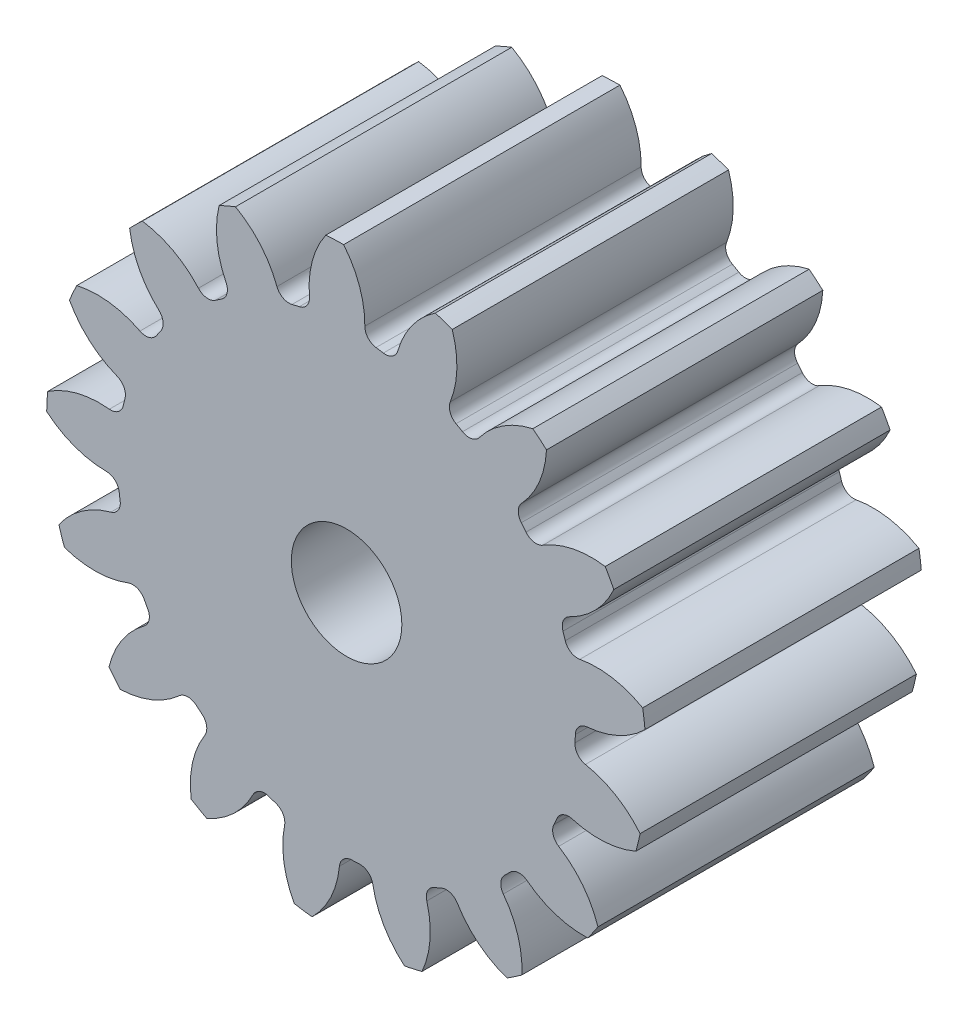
ISO-10303-21;
HEADER;
FILE_DESCRIPTION(('STEP AP214'),'2;1');
FILE_NAME('part.step','',(''),(''),'','','');
FILE_SCHEMA(('AUTOMOTIVE_DESIGN { 1 0 10303 214 1 1 1 1 }'));
ENDSEC;
DATA;
#1=APPLICATION_CONTEXT('core data for automotive mechanical design processes');
#2=APPLICATION_PROTOCOL_DEFINITION('international standard','automotive_design',2000,#1);
#3=PRODUCT_CONTEXT('',#1,'mechanical');
#4=PRODUCT('Part','Part','',(#3));
#5=PRODUCT_RELATED_PRODUCT_CATEGORY('part','',(#4));
#6=PRODUCT_DEFINITION_FORMATION('','',#4);
#7=PRODUCT_DEFINITION_CONTEXT('part definition',#1,'design');
#8=PRODUCT_DEFINITION('design','',#6,#7);
#9=PRODUCT_DEFINITION_SHAPE('','',#8);
#10=(LENGTH_UNIT() NAMED_UNIT(*) SI_UNIT(.MILLI.,.METRE.));
#11=(NAMED_UNIT(*) PLANE_ANGLE_UNIT() SI_UNIT($,.RADIAN.));
#12=(NAMED_UNIT(*) SI_UNIT($,.STERADIAN.) SOLID_ANGLE_UNIT());
#13=UNCERTAINTY_MEASURE_WITH_UNIT(LENGTH_MEASURE(1.E-05),#10,'distance_accuracy_value','');
#14=(GEOMETRIC_REPRESENTATION_CONTEXT(3) GLOBAL_UNCERTAINTY_ASSIGNED_CONTEXT((#13)) GLOBAL_UNIT_ASSIGNED_CONTEXT((#10,
#11,#12)) REPRESENTATION_CONTEXT('',''));
#15=CARTESIAN_POINT('',(0.,0.,0.));
#16=DIRECTION('',(0.,0.,1.));
#17=DIRECTION('',(1.,0.,0.));
#18=AXIS2_PLACEMENT_3D('',#15,#16,#17);
#19=CARTESIAN_POINT('',(0.,0.,88.9));
#20=DIRECTION('',(0.,0.,-1.));
#21=DIRECTION('',(-1.,0.,0.));
#22=AXIS2_PLACEMENT_3D('',#19,#20,#21);
#23=CYLINDRICAL_SURFACE('',#22,96.52);
#24=DIRECTION('',(0.,0.,-1.));
#25=VECTOR('',#24,1.);
#26=CARTESIAN_POINT('',(95.2604631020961,15.5420259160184,44.45));
#27=LINE('',#26,#25);
#28=CARTESIAN_POINT('',(95.2604631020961,15.5420259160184,88.9));
#29=VERTEX_POINT('',#28);
#30=CARTESIAN_POINT('',(95.2604631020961,15.5420259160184,0.));
#31=VERTEX_POINT('',#30);
#32=EDGE_CURVE('E708',#29,#31,#27,.T.);
#33=ORIENTED_EDGE('',*,*,#32,.F.);
#34=CARTESIAN_POINT('',(0.,0.,88.9));
#35=DIRECTION('',(0.,0.,1.));
#36=DIRECTION('',(1.,0.,0.));
#37=AXIS2_PLACEMENT_3D('',#34,#35,#36);
#38=CIRCLE('',#37,96.52);
#39=CARTESIAN_POINT('',(96.0167182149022,9.84379110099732,88.9));
#40=VERTEX_POINT('',#39);
#41=EDGE_CURVE('E1315',#40,#29,#38,.T.);
#42=ORIENTED_EDGE('',*,*,#41,.F.);
#43=DIRECTION('',(0.,0.,-1.));
#44=VECTOR('',#43,1.);
#45=CARTESIAN_POINT('',(96.0167182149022,9.84379110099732,44.45));
#46=LINE('',#45,#44);
#47=CARTESIAN_POINT('',(96.0167182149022,9.84379110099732,0.));
#48=VERTEX_POINT('',#47);
#49=EDGE_CURVE('E1309',#48,#40,#46,.F.);
#50=ORIENTED_EDGE('',*,*,#49,.F.);
#51=CARTESIAN_POINT('',(0.,0.,0.));
#52=DIRECTION('',(0.,0.,1.));
#53=DIRECTION('',(1.,0.,0.));
#54=AXIS2_PLACEMENT_3D('',#51,#52,#53);
#55=CIRCLE('',#54,96.52);
#56=EDGE_CURVE('E1320',#48,#31,#55,.T.);
#57=ORIENTED_EDGE('',*,*,#56,.T.);
#58=EDGE_LOOP('',(#33,#42,#50,#57));
#59=FACE_BOUND('',#58,.T.);
#60=ADVANCED_FACE('F33',(#59),#23,.T.);
#61=DIRECTION('',(0.,0.,-1.));
#62=VECTOR('',#61,1.);
#63=CARTESIAN_POINT('',(85.9769357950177,43.8643011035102,44.45));
#64=LINE('',#63,#62);
#65=CARTESIAN_POINT('',(85.9769357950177,43.8643011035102,0.));
#66=VERTEX_POINT('',#65);
#67=CARTESIAN_POINT('',(85.9769357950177,43.8643011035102,88.9));
#68=VERTEX_POINT('',#67);
#69=EDGE_CURVE('E679',#66,#68,#64,.F.);
#70=ORIENTED_EDGE('',*,*,#69,.F.);
#71=CARTESIAN_POINT('',(83.2133090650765,48.904555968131,0.));
#72=VERTEX_POINT('',#71);
#73=EDGE_CURVE('E1323',#66,#72,#55,.T.);
#74=ORIENTED_EDGE('',*,*,#73,.T.);
#75=DIRECTION('',(0.,0.,-1.));
#76=VECTOR('',#75,1.);
#77=CARTESIAN_POINT('',(83.2133090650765,48.904555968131,44.45));
#78=LINE('',#77,#76);
#79=CARTESIAN_POINT('',(83.2133090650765,48.904555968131,88.9));
#80=VERTEX_POINT('',#79);
#81=EDGE_CURVE('E741',#80,#72,#78,.T.);
#82=ORIENTED_EDGE('',*,*,#81,.F.);
#83=EDGE_CURVE('E1318',#68,#80,#38,.T.);
#84=ORIENTED_EDGE('',*,*,#83,.F.);
#85=EDGE_LOOP('',(#70,#74,#82,#84));
#86=FACE_BOUND('',#85,.T.);
#87=ADVANCED_FACE('F1516',(#86),#23,.T.);
#88=CARTESIAN_POINT('',(0.,0.,88.9));
#89=DIRECTION('',(0.,0.,1.));
#90=DIRECTION('',(1.,0.,0.));
#91=AXIS2_PLACEMENT_3D('',#88,#89,#90);
#92=PLANE('',#91);
#93=CARTESIAN_POINT('',(0.,0.,88.9000000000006));
#94=DIRECTION('',(0.,0.,1.));
#95=DIRECTION('',(1.,0.,0.));
#96=AXIS2_PLACEMENT_3D('',#93,#94,#95);
#97=CIRCLE('',#96,17.78);
#98=CARTESIAN_POINT('',(17.78,0.,88.9000000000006));
#99=VERTEX_POINT('',#98);
#100=EDGE_CURVE('E696',#99,#99,#97,.T.);
#101=ORIENTED_EDGE('',*,*,#100,.F.);
#102=EDGE_LOOP('',(#101));
#103=FACE_BOUND('',#102,.T.);
#104=ORIENTED_EDGE('',*,*,#41,.T.);
#105=CARTESIAN_POINT('',(80.4795862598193,-10.423997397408,88.9));
#106=DIRECTION('',(0.,0.,-1.));
#107=DIRECTION('',(0.932472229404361,0.361241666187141,0.));
#108=AXIS2_PLACEMENT_3D('',#105,#106,#107);
#109=CIRCLE('',#108,29.8782309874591);
#110=CARTESIAN_POINT('',(75.0597664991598,18.958552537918,88.9));
#111=VERTEX_POINT('',#110);
#112=EDGE_CURVE('E688',#111,#29,#109,.T.);
#113=ORIENTED_EDGE('',*,*,#112,.F.);
#114=CARTESIAN_POINT('',(74.3096683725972,23.025070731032,88.9));
#115=DIRECTION('',(0.,0.,1.));
#116=DIRECTION('',(-0.932472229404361,-0.361241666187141,0.));
#117=AXIS2_PLACEMENT_3D('',#114,#115,#116);
#118=CIRCLE('',#117,4.13512);
#119=CARTESIAN_POINT('',(70.3598139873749,21.8011966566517,88.9));
#120=VERTEX_POINT('',#119);
#121=EDGE_CURVE('E686',#120,#111,#118,.T.);
#122=ORIENTED_EDGE('',*,*,#121,.F.);
#123=CARTESIAN_POINT('',(0.,0.,88.9));
#124=DIRECTION('',(0.,0.,-1.));
#125=DIRECTION('',(0.932472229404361,0.361241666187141,0.));
#126=AXIS2_PLACEMENT_3D('',#123,#124,#125);
#127=CIRCLE('',#126,73.66);
#128=CARTESIAN_POINT('',(69.6130695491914,24.0793718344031,88.9));
#129=VERTEX_POINT('',#128);
#130=EDGE_CURVE('E671',#129,#120,#127,.T.);
#131=ORIENTED_EDGE('',*,*,#130,.F.);
#132=CARTESIAN_POINT('',(73.5210032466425,25.4311379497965,88.9));
#133=DIRECTION('',(0.,0.,1.));
#134=DIRECTION('',(-0.932472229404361,-0.361241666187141,0.));
#135=AXIS2_PLACEMENT_3D('',#132,#133,#134);
#136=CIRCLE('',#135,4.13512);
#137=CARTESIAN_POINT('',(71.7183294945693,29.1526409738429,88.9));
#138=VERTEX_POINT('',#137);
#139=EDGE_CURVE('E663',#138,#129,#136,.T.);
#140=ORIENTED_EDGE('',*,*,#139,.F.);
#141=CARTESIAN_POINT('',(58.693144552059,56.0422903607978,88.9));
#142=DIRECTION('',(0.,0.,-1.));
#143=DIRECTION('',(-0.932472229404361,-0.361241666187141,0.));
#144=AXIS2_PLACEMENT_3D('',#141,#142,#143);
#145=CIRCLE('',#144,29.8782309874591);
#146=EDGE_CURVE('E693',#68,#138,#145,.T.);
#147=ORIENTED_EDGE('',*,*,#146,.F.);
#148=ORIENTED_EDGE('',*,*,#83,.T.);
#149=CARTESIAN_POINT('',(78.810561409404,19.3524917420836,88.9));
#150=DIRECTION('',(0.,0.,-1.));
#151=DIRECTION('',(0.739008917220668,0.673695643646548,0.));
#152=AXIS2_PLACEMENT_3D('',#149,#150,#151);
#153=CIRCLE('',#152,29.8782309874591);
#154=CARTESIAN_POINT('',(63.1425286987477,44.7930388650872,88.9));
#155=VERTEX_POINT('',#154);
#156=EDGE_CURVE('E717',#155,#80,#153,.T.);
#157=ORIENTED_EDGE('',*,*,#156,.F.);
#158=CARTESIAN_POINT('',(60.974087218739,48.3139874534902,88.9));
#159=DIRECTION('',(0.,0.,1.));
#160=DIRECTION('',(-0.739008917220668,-0.673695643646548,0.));
#161=AXIS2_PLACEMENT_3D('',#158,#159,#160);
#162=CIRCLE('',#161,4.13512);
#163=CARTESIAN_POINT('',(57.7330720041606,45.7459068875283,88.9));
#164=VERTEX_POINT('',#163);
#165=EDGE_CURVE('E715',#164,#155,#162,.T.);
#166=ORIENTED_EDGE('',*,*,#165,.F.);
#167=CARTESIAN_POINT('',(0.,0.,88.9));
#168=DIRECTION('',(0.,0.,-1.));
#169=DIRECTION('',(0.739008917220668,0.673695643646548,0.));
#170=AXIS2_PLACEMENT_3D('',#167,#168,#169);
#171=CIRCLE('',#170,73.66);
#172=CARTESIAN_POINT('',(56.2137817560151,47.6004867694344,88.9));
#173=VERTEX_POINT('',#172);
#174=EDGE_CURVE('E712',#173,#164,#171,.T.);
#175=ORIENTED_EDGE('',*,*,#174,.F.);
#176=CARTESIAN_POINT('',(59.3695071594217,50.2726796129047,88.9));
#177=DIRECTION('',(0.,0.,1.));
#178=DIRECTION('',(-0.739008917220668,-0.673695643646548,0.));
#179=AXIS2_PLACEMENT_3D('',#176,#177,#178);
#180=CIRCLE('',#179,4.13512);
#181=CARTESIAN_POINT('',(56.3442019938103,53.0916769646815,88.9));
#182=VERTEX_POINT('',#181);
#183=EDGE_CURVE('E710',#182,#173,#180,.T.);
#184=ORIENTED_EDGE('',*,*,#183,.F.);
#185=CARTESIAN_POINT('',(34.4849170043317,73.4602887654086,88.9));
#186=DIRECTION('',(0.,0.,-1.));
#187=DIRECTION('',(-0.739008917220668,-0.673695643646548,0.));
#188=AXIS2_PLACEMENT_3D('',#185,#186,#187);
#189=CIRCLE('',#188,29.8782309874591);
#190=CARTESIAN_POINT('',(64.3254917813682,71.9606941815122,88.9));
#191=VERTEX_POINT('',#190);
#192=EDGE_CURVE('E720',#191,#182,#189,.T.);
#193=ORIENTED_EDGE('',*,*,#192,.F.);
#194=CARTESIAN_POINT('',(59.927736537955,75.662254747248,88.9));
#195=VERTEX_POINT('',#194);
#196=EDGE_CURVE('E1365',#191,#195,#38,.T.);
#197=ORIENTED_EDGE('',*,*,#196,.T.);
#198=CARTESIAN_POINT('',(66.4977335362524,46.5153196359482,88.9));
#199=DIRECTION('',(0.,0.,-1.));
#200=DIRECTION('',(0.445738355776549,0.895163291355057,0.));
#201=AXIS2_PLACEMENT_3D('',#198,#199,#200);
#202=CIRCLE('',#201,29.8782309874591);
#203=CARTESIAN_POINT('',(42.6975425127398,64.5779770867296,88.9));
#204=VERTEX_POINT('',#203);
#205=EDGE_CURVE('E752',#204,#195,#202,.T.);
#206=ORIENTED_EDGE('',*,*,#205,.F.);
#207=CARTESIAN_POINT('',(39.4036177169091,67.0778324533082,88.9));
#208=DIRECTION('',(0.,0.,1.));
#209=DIRECTION('',(-0.445738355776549,-0.895163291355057,0.));
#210=AXIS2_PLACEMENT_3D('',#207,#208,#209);
#211=CIRCLE('',#210,4.13512);
#212=CARTESIAN_POINT('',(37.3091587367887,63.5123789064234,88.9));
#213=VERTEX_POINT('',#212);
#214=EDGE_CURVE('E750',#213,#204,#211,.T.);
#215=ORIENTED_EDGE('',*,*,#214,.F.);
#216=CARTESIAN_POINT('',(0.,0.,88.9));
#217=DIRECTION('',(0.,0.,-1.));
#218=DIRECTION('',(0.445738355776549,0.895163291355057,0.));
#219=AXIS2_PLACEMENT_3D('',#216,#217,#218);
#220=CIRCLE('',#219,73.66);
#221=CARTESIAN_POINT('',(35.2225112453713,64.6928922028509,88.9));
#222=VERTEX_POINT('',#221);
#223=EDGE_CURVE('E747',#222,#213,#220,.T.);
#224=ORIENTED_EDGE('',*,*,#223,.F.);
#225=CARTESIAN_POINT('',(37.1998301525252,68.3246173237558,88.9));
#226=DIRECTION('',(0.,0.,1.));
#227=DIRECTION('',(-0.445738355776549,-0.895163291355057,0.));
#228=AXIS2_PLACEMENT_3D('',#225,#226,#227);
#229=CIRCLE('',#228,4.13512);
#230=CARTESIAN_POINT('',(33.3604777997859,69.860387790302,88.9));
#231=VERTEX_POINT('',#230);
#232=EDGE_CURVE('E745',#231,#222,#229,.T.);
#233=ORIENTED_EDGE('',*,*,#232,.F.);
#234=CARTESIAN_POINT('',(5.61931032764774,80.9570681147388,88.9));
#235=DIRECTION('',(0.,0.,-1.));
#236=DIRECTION('',(-0.445738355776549,-0.895163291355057,0.));
#237=AXIS2_PLACEMENT_3D('',#234,#235,#236);
#238=CIRCLE('',#237,29.8782309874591);
#239=CARTESIAN_POINT('',(33.9865336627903,90.3383967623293,88.9));
#240=VERTEX_POINT('',#239);
#241=EDGE_CURVE('E755',#240,#231,#238,.T.);
#242=ORIENTED_EDGE('',*,*,#241,.F.);
#243=CARTESIAN_POINT('',(28.548591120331,92.2013467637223,88.9));
#244=VERTEX_POINT('',#243);
#245=EDGE_CURVE('E1498',#240,#244,#38,.T.);
#246=ORIENTED_EDGE('',*,*,#245,.T.);
#247=CARTESIAN_POINT('',(45.2040182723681,67.395995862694,88.9));
#248=DIRECTION('',(0.,0.,-1.));
#249=DIRECTION('',(0.092268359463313,0.995734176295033,0.));
#250=AXIS2_PLACEMENT_3D('',#247,#248,#249);
#251=CIRCLE('',#250,29.8782309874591);
#252=CARTESIAN_POINT('',(16.4860166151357,75.6413016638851,88.9));
#253=VERTEX_POINT('',#252);
#254=EDGE_CURVE('E790',#253,#244,#251,.T.);
#255=ORIENTED_EDGE('',*,*,#254,.F.);
#256=CARTESIAN_POINT('',(12.5114712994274,76.782444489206,88.9));
#257=DIRECTION('',(0.,0.,1.));
#258=DIRECTION('',(-0.092268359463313,-0.995734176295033,0.));
#259=AXIS2_PLACEMENT_3D('',#256,#257,#258);
#260=CIRCLE('',#259,4.13512);
#261=CARTESIAN_POINT('',(11.8464368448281,72.7011522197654,88.9));
#262=VERTEX_POINT('',#261);
#263=EDGE_CURVE('E788',#262,#253,#260,.T.);
#264=ORIENTED_EDGE('',*,*,#263,.F.);
#265=CARTESIAN_POINT('',(0.,0.,88.9));
#266=DIRECTION('',(0.,0.,-1.));
#267=DIRECTION('',(0.092268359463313,0.995734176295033,0.));
#268=AXIS2_PLACEMENT_3D('',#265,#266,#267);
#269=CIRCLE('',#268,73.66);
#270=CARTESIAN_POINT('',(9.47424541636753,73.0481640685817,88.9));
#271=VERTEX_POINT('',#270);
#272=EDGE_CURVE('E785',#271,#262,#269,.T.);
#273=ORIENTED_EDGE('',*,*,#272,.F.);
#274=CARTESIAN_POINT('',(10.0061099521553,77.1489368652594,88.9));
#275=DIRECTION('',(0.,0.,1.));
#276=DIRECTION('',(-0.092268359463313,-0.995734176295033,0.));
#277=AXIS2_PLACEMENT_3D('',#274,#275,#276);
#278=CIRCLE('',#277,4.13512);
#279=CARTESIAN_POINT('',(5.87123622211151,77.19406613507,88.9));
#280=VERTEX_POINT('',#279);
#281=EDGE_CURVE('E783',#280,#271,#278,.T.);
#282=ORIENTED_EDGE('',*,*,#281,.F.);
#283=CARTESIAN_POINT('',(-24.0052153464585,77.5201468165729,88.9));
#284=DIRECTION('',(0.,0.,-1.));
#285=DIRECTION('',(-0.092268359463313,-0.995734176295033,0.));
#286=AXIS2_PLACEMENT_3D('',#283,#284,#285);
#287=CIRCLE('',#286,29.8782309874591);
#288=CARTESIAN_POINT('',(-0.942494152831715,96.5153982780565,88.9));
#289=VERTEX_POINT('',#288);
#290=EDGE_CURVE('E793',#289,#280,#287,.T.);
#291=ORIENTED_EDGE('',*,*,#290,.F.);
#292=CARTESIAN_POINT('',(-6.68619972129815,96.2881359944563,88.9));
#293=VERTEX_POINT('',#292);
#294=EDGE_CURVE('E1494',#289,#293,#38,.T.);
#295=ORIENTED_EDGE('',*,*,#294,.T.);
#296=CARTESIAN_POINT('',(17.8052498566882,79.1744693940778,88.9));
#297=DIRECTION('',(0.,0.,-1.));
#298=DIRECTION('',(-0.273662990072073,0.961825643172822,0.));
#299=AXIS2_PLACEMENT_3D('',#296,#297,#298);
#300=CIRCLE('',#299,29.8782309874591);
#301=CARTESIAN_POINT('',(-11.9520371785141,76.488849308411,88.9));
#302=VERTEX_POINT('',#301);
#303=EDGE_CURVE('E828',#302,#293,#300,.T.);
#304=ORIENTED_EDGE('',*,*,#303,.F.);
#305=CARTESIAN_POINT('',(-16.0704186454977,76.117161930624,88.9));
#306=DIRECTION('',(0.,0.,1.));
#307=DIRECTION('',(0.273662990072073,-0.961825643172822,0.));
#308=AXIS2_PLACEMENT_3D('',#305,#306,#307);
#309=CIRCLE('',#308,4.13512);
#310=CARTESIAN_POINT('',(-15.2162119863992,72.0712320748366,88.9));
#311=VERTEX_POINT('',#310);
#312=EDGE_CURVE('E826',#311,#302,#309,.T.);
#313=ORIENTED_EDGE('',*,*,#312,.F.);
#314=CARTESIAN_POINT('',(0.,0.,88.9));
#315=DIRECTION('',(0.,0.,-1.));
#316=DIRECTION('',(-0.273662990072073,0.961825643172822,0.));
#317=AXIS2_PLACEMENT_3D('',#314,#315,#316);
#318=CIRCLE('',#317,73.66);
#319=CARTESIAN_POINT('',(-17.5535697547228,71.5378766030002,88.9));
#320=VERTEX_POINT('',#319);
#321=EDGE_CURVE('E823',#320,#311,#318,.T.);
#322=ORIENTED_EDGE('',*,*,#321,.F.);
#323=CARTESIAN_POINT('',(-18.5389908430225,75.5538649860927,88.9));
#324=DIRECTION('',(0.,0.,1.));
#325=DIRECTION('',(0.273662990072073,-0.961825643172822,0.));
#326=AXIS2_PLACEMENT_3D('',#323,#324,#325);
#327=CIRCLE('',#326,4.13512);
#328=CARTESIAN_POINT('',(-22.4109483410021,74.1022581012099,88.9));
#329=VERTEX_POINT('',#328);
#330=EDGE_CURVE('E821',#329,#320,#327,.T.);
#331=ORIENTED_EDGE('',*,*,#330,.F.);
#332=CARTESIAN_POINT('',(-50.3877036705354,63.6137001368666,88.9));
#333=DIRECTION('',(0.,0.,-1.));
#334=DIRECTION('',(0.273662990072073,-0.961825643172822,0.));
#335=AXIS2_PLACEMENT_3D('',#332,#333,#334);
#336=CIRCLE('',#335,29.8782309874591);
#337=CARTESIAN_POINT('',(-35.7442329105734,89.6574604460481,88.9));
#338=VERTEX_POINT('',#337);
#339=EDGE_CURVE('E831',#338,#329,#336,.T.);
#340=ORIENTED_EDGE('',*,*,#339,.F.);
#341=CARTESIAN_POINT('',(-41.0179822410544,87.3706789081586,88.9));
#342=VERTEX_POINT('',#341);
#343=EDGE_CURVE('E1490',#338,#342,#38,.T.);
#344=ORIENTED_EDGE('',*,*,#343,.T.);
#345=CARTESIAN_POINT('',(-11.9982162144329,80.2599921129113,88.9));
#346=DIRECTION('',(0.,0.,-1.));
#347=DIRECTION('',(-0.602634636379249,0.798017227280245,0.));
#348=AXIS2_PLACEMENT_3D('',#345,#346,#347);
#349=CIRCLE('',#348,29.8782309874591);
#350=CARTESIAN_POINT('',(-38.7759021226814,67.0061540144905,88.9));
#351=VERTEX_POINT('',#350);
#352=EDGE_CURVE('E866',#351,#342,#349,.T.);
#353=ORIENTED_EDGE('',*,*,#352,.F.);
#354=CARTESIAN_POINT('',(-42.4819095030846,65.1718348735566,88.9));
#355=DIRECTION('',(0.,0.,1.));
#356=DIRECTION('',(0.602634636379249,-0.798017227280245,0.));
#357=AXIS2_PLACEMENT_3D('',#354,#355,#356);
#358=CIRCLE('',#357,4.13512);
#359=CARTESIAN_POINT('',(-40.223827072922,61.7076926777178,88.9));
#360=VERTEX_POINT('',#359);
#361=EDGE_CURVE('E864',#360,#351,#358,.T.);
#362=ORIENTED_EDGE('',*,*,#361,.F.);
#363=CARTESIAN_POINT('',(0.,0.,88.9));
#364=DIRECTION('',(0.,0.,-1.));
#365=DIRECTION('',(-0.602634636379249,0.798017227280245,0.));
#366=AXIS2_PLACEMENT_3D('',#363,#364,#365);
#367=CIRCLE('',#366,73.66);
#368=CARTESIAN_POINT('',(-42.2106780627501,60.3660024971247,88.9));
#369=VERTEX_POINT('',#368);
#370=EDGE_CURVE('E861',#369,#360,#367,.T.);
#371=ORIENTED_EDGE('',*,*,#370,.F.);
#372=CARTESIAN_POINT('',(-44.5802981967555,63.7548249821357,88.9));
#373=DIRECTION('',(0.,0.,1.));
#374=DIRECTION('',(0.602634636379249,-0.798017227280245,0.));
#375=AXIS2_PLACEMENT_3D('',#372,#373,#374);
#376=CIRCLE('',#375,4.13512);
#377=CARTESIAN_POINT('',(-47.6664101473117,61.0025294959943,88.9));
#378=VERTEX_POINT('',#377);
#379=EDGE_CURVE('E859',#378,#369,#376,.T.);
#380=ORIENTED_EDGE('',*,*,#379,.F.);
#381=CARTESIAN_POINT('',(-69.9650534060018,41.1158707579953,88.9));
#382=DIRECTION('',(0.,0.,-1.));
#383=DIRECTION('',(0.602634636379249,-0.798017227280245,0.));
#384=AXIS2_PLACEMENT_3D('',#381,#382,#383);
#385=CIRCLE('',#384,29.8782309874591);
#386=CARTESIAN_POINT('',(-65.7185149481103,70.690785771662,88.9));
#387=VERTEX_POINT('',#386);
#388=EDGE_CURVE('E869',#387,#378,#385,.T.);
#389=ORIENTED_EDGE('',*,*,#388,.F.);
#390=CARTESIAN_POINT('',(-69.8100589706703,66.6533274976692,88.9));
#391=VERTEX_POINT('',#390);
#392=EDGE_CURVE('E1486',#387,#391,#38,.T.);
#393=ORIENTED_EDGE('',*,*,#392,.T.);
#394=CARTESIAN_POINT('',(-40.1812567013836,70.5059581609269,88.9));
#395=DIRECTION('',(0.,0.,-1.));
#396=DIRECTION('',(-0.85021713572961,0.526432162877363,0.));
#397=AXIS2_PLACEMENT_3D('',#394,#395,#396);
#398=CIRCLE('',#397,29.8782309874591);
#399=CARTESIAN_POINT('',(-60.3628666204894,48.4739063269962,88.9));
#400=VERTEX_POINT('',#399);
#401=EDGE_CURVE('E904',#400,#391,#398,.T.);
#402=ORIENTED_EDGE('',*,*,#401,.F.);
#403=CARTESIAN_POINT('',(-63.155983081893,45.4246903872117,88.9));
#404=DIRECTION('',(0.,0.,1.));
#405=DIRECTION('',(0.85021713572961,-0.526432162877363,0.));
#406=AXIS2_PLACEMENT_3D('',#403,#404,#405);
#407=CIRCLE('',#406,4.13512);
#408=CARTESIAN_POINT('',(-59.7989914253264,43.0101874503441,88.9));
#409=VERTEX_POINT('',#408);
#410=EDGE_CURVE('E902',#409,#400,#407,.T.);
#411=ORIENTED_EDGE('',*,*,#410,.F.);
#412=CARTESIAN_POINT('',(0.,0.,88.9));
#413=DIRECTION('',(0.,0.,-1.));
#414=DIRECTION('',(-0.85021713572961,0.526432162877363,0.));
#415=AXIS2_PLACEMENT_3D('',#412,#413,#414);
#416=CIRCLE('',#415,73.66);
#417=CARTESIAN_POINT('',(-61.1670004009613,41.0413652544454,88.9));
#418=VERTEX_POINT('',#417);
#419=EDGE_CURVE('E899',#418,#409,#416,.T.);
#420=ORIENTED_EDGE('',*,*,#419,.F.);
#421=CARTESIAN_POINT('',(-64.6007892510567,43.3453425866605,88.9));
#422=DIRECTION('',(0.,0.,1.));
#423=DIRECTION('',(0.85021713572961,-0.526432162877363,0.));
#424=AXIS2_PLACEMENT_3D('',#421,#422,#423);
#425=CIRCLE('',#424,4.13512);
#426=CARTESIAN_POINT('',(-66.4842591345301,39.6640712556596,88.9));
#427=VERTEX_POINT('',#426);
#428=EDGE_CURVE('E897',#427,#418,#425,.T.);
#429=ORIENTED_EDGE('',*,*,#428,.F.);
#430=CARTESIAN_POINT('',(-80.0932349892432,13.0651152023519,88.9));
#431=DIRECTION('',(0.,0.,-1.));
#432=DIRECTION('',(0.85021713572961,-0.526432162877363,0.));
#433=AXIS2_PLACEMENT_3D('',#430,#431,#432);
#434=CIRCLE('',#433,29.8782309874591);
#435=CARTESIAN_POINT('',(-86.8171473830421,42.1769287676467,88.9));
#436=VERTEX_POINT('',#435);
#437=EDGE_CURVE('E907',#436,#427,#434,.T.);
#438=ORIENTED_EDGE('',*,*,#437,.F.);
#439=CARTESIAN_POINT('',(-89.1739004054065,36.9340748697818,88.9));
#440=VERTEX_POINT('',#439);
#441=EDGE_CURVE('E1482',#436,#440,#38,.T.);
#442=ORIENTED_EDGE('',*,*,#441,.T.);
#443=CARTESIAN_POINT('',(-62.9375958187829,51.2297038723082,88.9));
#444=DIRECTION('',(0.,0.,-1.));
#445=DIRECTION('',(-0.9829730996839,0.183749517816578,0.));
#446=AXIS2_PLACEMENT_3D('',#443,#444,#445);
#447=CIRCLE('',#446,29.8782309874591);
#448=CARTESIAN_POINT('',(-73.7974914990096,23.3949889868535,88.9));
#449=VERTEX_POINT('',#448);
#450=EDGE_CURVE('E942',#449,#440,#447,.T.);
#451=ORIENTED_EDGE('',*,*,#450,.F.);
#452=CARTESIAN_POINT('',(-75.3004911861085,19.5426897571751,88.9));
#453=DIRECTION('',(0.,0.,1.));
#454=DIRECTION('',(0.9829730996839,-0.183749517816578,0.));
#455=AXIS2_PLACEMENT_3D('',#452,#453,#454);
#456=CIRCLE('',#455,4.13512);
#457=CARTESIAN_POINT('',(-71.2979706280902,18.5039180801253,88.9));
#458=VERTEX_POINT('',#457);
#459=EDGE_CURVE('E940',#458,#449,#456,.T.);
#460=ORIENTED_EDGE('',*,*,#459,.F.);
#461=CARTESIAN_POINT('',(0.,0.,88.9));
#462=DIRECTION('',(0.,0.,-1.));
#463=DIRECTION('',(-0.9829730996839,0.183749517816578,0.));
#464=AXIS2_PLACEMENT_3D('',#461,#462,#463);
#465=CIRCLE('',#464,73.66);
#466=CARTESIAN_POINT('',(-71.8623803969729,16.1738642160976,88.9));
#467=VERTEX_POINT('',#466);
#468=EDGE_CURVE('E937',#467,#458,#465,.T.);
#469=ORIENTED_EDGE('',*,*,#468,.F.);
#470=CARTESIAN_POINT('',(-75.8965857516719,17.081831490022,88.9));
#471=DIRECTION('',(0.,0.,1.));
#472=DIRECTION('',(0.9829730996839,-0.183749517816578,0.));
#473=AXIS2_PLACEMENT_3D('',#470,#471,#472);
#474=CIRCLE('',#473,4.13512);
#475=CARTESIAN_POINT('',(-76.3230405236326,12.968760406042,88.9));
#476=VERTEX_POINT('',#475);
#477=EDGE_CURVE('E935',#476,#467,#474,.T.);
#478=ORIENTED_EDGE('',*,*,#477,.F.);
#479=CARTESIAN_POINT('',(-79.4043813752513,-16.7501565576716,88.9));
#480=DIRECTION('',(0.,0.,-1.));
#481=DIRECTION('',(0.9829730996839,-0.183749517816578,0.));
#482=AXIS2_PLACEMENT_3D('',#479,#480,#481);
#483=CIRCLE('',#482,29.8782309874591);
#484=CARTESIAN_POINT('',(-96.1906429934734,7.96684382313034,88.9));
#485=VERTEX_POINT('',#484);
#486=EDGE_CURVE('E945',#485,#476,#483,.T.);
#487=ORIENTED_EDGE('',*,*,#486,.F.);
#488=CARTESIAN_POINT('',(-96.4943124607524,2.22667077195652,88.9));
#489=VERTEX_POINT('',#488);
#490=EDGE_CURVE('E1478',#485,#489,#38,.T.);
#491=ORIENTED_EDGE('',*,*,#490,.T.);
#492=CARTESIAN_POINT('',(-77.1938638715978,25.0345942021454,88.9));
#493=DIRECTION('',(0.,0.,-1.));
#494=DIRECTION('',(-0.982973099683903,-0.183749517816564,0.));
#495=AXIS2_PLACEMENT_3D('',#492,#493,#494);
#496=CIRCLE('',#495,29.8782309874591);
#497=CARTESIAN_POINT('',(-77.2653562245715,-4.84355125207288,88.9));
#498=VERTEX_POINT('',#497);
#499=EDGE_CURVE('E980',#498,#489,#496,.T.);
#500=ORIENTED_EDGE('',*,*,#499,.F.);
#501=CARTESIAN_POINT('',(-77.2752507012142,-8.97865941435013,88.9));
#502=DIRECTION('',(0.,0.,1.));
#503=DIRECTION('',(0.982973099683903,0.183749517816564,0.));
#504=AXIS2_PLACEMENT_3D('',#501,#502,#503);
#505=CIRCLE('',#504,4.13512);
#506=CARTESIAN_POINT('',(-73.1677638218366,-8.501407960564,88.9));
#507=VERTEX_POINT('',#506);
#508=EDGE_CURVE('E978',#507,#498,#505,.T.);
#509=ORIENTED_EDGE('',*,*,#508,.F.);
#510=CARTESIAN_POINT('',(0.,0.,88.9));
#511=DIRECTION('',(0.,0.,-1.));
#512=DIRECTION('',(-0.982973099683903,-0.183749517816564,0.));
#513=AXIS2_PLACEMENT_3D('',#510,#511,#512);
#514=CIRCLE('',#513,73.66);
#515=CARTESIAN_POINT('',(-72.8523477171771,-10.8780068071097,88.9));
#516=VERTEX_POINT('',#515);
#517=EDGE_CURVE('E975',#516,#507,#514,.T.);
#518=ORIENTED_EDGE('',*,*,#517,.F.);
#519=CARTESIAN_POINT('',(-76.9421277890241,-11.4886756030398,88.9));
#520=DIRECTION('',(0.,0.,1.));
#521=DIRECTION('',(0.982973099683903,0.183749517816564,0.));
#522=AXIS2_PLACEMENT_3D('',#519,#520,#521);
#523=CIRCLE('',#522,4.13512);
#524=CARTESIAN_POINT('',(-75.8539723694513,-15.4780533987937,88.9));
#525=VERTEX_POINT('',#524);
#526=EDGE_CURVE('E973',#525,#516,#523,.T.);
#527=ORIENTED_EDGE('',*,*,#526,.F.);
#528=CARTESIAN_POINT('',(-67.9915260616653,-44.30322685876,88.9));
#529=DIRECTION('',(0.,0.,-1.));
#530=DIRECTION('',(0.982973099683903,0.183749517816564,0.));
#531=AXIS2_PLACEMENT_3D('',#528,#529,#530);
#532=CIRCLE('',#531,29.8782309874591);
#533=CARTESIAN_POINT('',(-92.573059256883,-27.3192075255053,88.9));
#534=VERTEX_POINT('',#533);
#535=EDGE_CURVE('E983',#534,#525,#532,.T.);
#536=ORIENTED_EDGE('',*,*,#535,.F.);
#537=CARTESIAN_POINT('',(-90.7826329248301,-32.7814575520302,88.9));
#538=VERTEX_POINT('',#537);
#539=EDGE_CURVE('E1474',#534,#538,#38,.T.);
#540=ORIENTED_EDGE('',*,*,#539,.T.);
#541=CARTESIAN_POINT('',(-81.0246728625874,-4.54157613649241,88.9));
#542=DIRECTION('',(0.,0.,-1.));
#543=DIRECTION('',(-0.850217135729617,-0.526432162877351,0.));
#544=AXIS2_PLACEMENT_3D('',#541,#542,#543);
#545=CIRCLE('',#544,29.8782309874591);
#546=CARTESIAN_POINT('',(-70.2981064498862,-32.4279430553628,88.9));
#547=VERTEX_POINT('',#546);
#548=EDGE_CURVE('E1018',#547,#538,#545,.T.);
#549=ORIENTED_EDGE('',*,*,#548,.F.);
#550=CARTESIAN_POINT('',(-68.8135594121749,-36.2873908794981,88.9));
#551=DIRECTION('',(0.,0.,1.));
#552=DIRECTION('',(0.850217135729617,0.526432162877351,0.));
#553=AXIS2_PLACEMENT_3D('',#550,#551,#552);
#554=CIRCLE('',#553,4.13512);
#555=CARTESIAN_POINT('',(-65.1558450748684,-34.3585717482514,88.9));
#556=VERTEX_POINT('',#555);
#557=EDGE_CURVE('E1016',#556,#547,#554,.T.);
#558=ORIENTED_EDGE('',*,*,#557,.F.);
#559=CARTESIAN_POINT('',(0.,0.,88.9));
#560=DIRECTION('',(0.,0.,-1.));
#561=DIRECTION('',(-0.850217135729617,-0.526432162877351,0.));
#562=AXIS2_PLACEMENT_3D('',#559,#560,#561);
#563=CIRCLE('',#562,73.66);
#564=CARTESIAN_POINT('',(-64.0032017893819,-36.4607427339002,88.9));
#565=VERTEX_POINT('',#564);
#566=EDGE_CURVE('E1013',#565,#556,#563,.T.);
#567=ORIENTED_EDGE('',*,*,#566,.F.);
#568=CARTESIAN_POINT('',(-67.5962091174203,-38.507573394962,88.9));
#569=DIRECTION('',(0.,0.,1.));
#570=DIRECTION('',(0.850217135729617,0.526432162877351,0.));
#571=AXIS2_PLACEMENT_3D('',#568,#569,#570);
#572=CIRCLE('',#571,4.13512);
#573=CARTESIAN_POINT('',(-65.1404049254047,-41.8344703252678,88.9));
#574=VERTEX_POINT('',#573);
#575=EDGE_CURVE('E1011',#574,#565,#572,.T.);
#576=ORIENTED_EDGE('',*,*,#575,.F.);
#577=CARTESIAN_POINT('',(-47.3960383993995,-65.8729008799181,88.9));
#578=DIRECTION('',(0.,0.,-1.));
#579=DIRECTION('',(0.850217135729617,0.526432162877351,0.));
#580=AXIS2_PLACEMENT_3D('',#577,#578,#579);
#581=CIRCLE('',#580,29.8782309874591);
#582=CARTESIAN_POINT('',(-76.4529709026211,-58.9156485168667,88.9));
#583=VERTEX_POINT('',#582);
#584=EDGE_CURVE('E1021',#583,#574,#581,.T.);
#585=ORIENTED_EDGE('',*,*,#584,.F.);
#586=CARTESIAN_POINT('',(-72.8102557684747,-63.3622683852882,88.9));
#587=VERTEX_POINT('',#586);
#588=EDGE_CURVE('E1470',#583,#587,#38,.T.);
#589=ORIENTED_EDGE('',*,*,#588,.T.);
#590=CARTESIAN_POINT('',(-73.9126508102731,-33.5043814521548,88.9));
#591=DIRECTION('',(0.,0.,-1.));
#592=DIRECTION('',(-0.602634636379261,-0.798017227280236,0.));
#593=AXIS2_PLACEMENT_3D('',#590,#591,#592);
#594=CIRCLE('',#593,29.8782309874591);
#595=CARTESIAN_POINT('',(-53.8367078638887,-55.6327614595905,88.9));
#596=VERTEX_POINT('',#595);
#597=EDGE_CURVE('E1056',#596,#587,#594,.T.);
#598=ORIENTED_EDGE('',*,*,#597,.F.);
#599=CARTESIAN_POINT('',(-51.0582156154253,-58.6953091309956,88.9));
#600=DIRECTION('',(0.,0.,1.));
#601=DIRECTION('',(0.602634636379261,0.798017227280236,0.));
#602=AXIS2_PLACEMENT_3D('',#599,#600,#601);
#603=CIRCLE('',#602,4.13512);
#604=CARTESIAN_POINT('',(-48.3442684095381,-55.575420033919,88.9));
#605=VERTEX_POINT('',#604);
#606=EDGE_CURVE('E1054',#605,#596,#603,.T.);
#607=ORIENTED_EDGE('',*,*,#606,.F.);
#608=CARTESIAN_POINT('',(0.,0.,88.9));
#609=DIRECTION('',(0.,0.,-1.));
#610=DIRECTION('',(-0.602634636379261,-0.798017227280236,0.));
#611=AXIS2_PLACEMENT_3D('',#608,#609,#610);
#612=CIRCLE('',#611,73.66);
#613=CARTESIAN_POINT('',(-46.5100688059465,-57.1192533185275,88.9));
#614=VERTEX_POINT('',#613);
#615=EDGE_CURVE('E1051',#614,#605,#612,.T.);
#616=ORIENTED_EDGE('',*,*,#615,.F.);
#617=CARTESIAN_POINT('',(-49.1210478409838,-60.3258100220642,88.9));
#618=DIRECTION('',(0.,0.,1.));
#619=DIRECTION('',(0.602634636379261,0.798017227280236,0.));
#620=AXIS2_PLACEMENT_3D('',#617,#618,#619);
#621=CIRCLE('',#620,4.13512);
#622=CARTESIAN_POINT('',(-45.6292648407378,-62.5409102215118,88.9));
#623=VERTEX_POINT('',#622);
#624=EDGE_CURVE('E1049',#623,#614,#621,.T.);
#625=ORIENTED_EDGE('',*,*,#624,.F.);
#626=CARTESIAN_POINT('',(-20.3994531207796,-78.5460746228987,88.9));
#627=DIRECTION('',(0.,0.,-1.));
#628=DIRECTION('',(0.602634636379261,0.798017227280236,0.));
#629=AXIS2_PLACEMENT_3D('',#626,#627,#628);
#630=CIRCLE('',#629,29.8782309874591);
#631=CARTESIAN_POINT('',(-50.0074851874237,-82.5552047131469,88.9));
#632=VERTEX_POINT('',#631);
#633=EDGE_CURVE('E1059',#632,#623,#630,.T.);
#634=ORIENTED_EDGE('',*,*,#633,.F.);
#635=CARTESIAN_POINT('',(-45.0044501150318,-85.3856537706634,88.9));
#636=VERTEX_POINT('',#635);
#637=EDGE_CURVE('E1466',#632,#636,#38,.T.);
#638=ORIENTED_EDGE('',*,*,#637,.T.);
#639=CARTESIAN_POINT('',(-56.8183157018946,-57.9422343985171,88.9));
#640=DIRECTION('',(0.,0.,-1.));
#641=DIRECTION('',(-0.273662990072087,-0.961825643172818,0.));
#642=AXIS2_PLACEMENT_3D('',#639,#640,#641);
#643=CIRCLE('',#642,29.8782309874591);
#644=CARTESIAN_POINT('',(-30.1043635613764,-71.3240671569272,88.9));
#645=VERTEX_POINT('',#644);
#646=EDGE_CURVE('E1094',#645,#636,#643,.T.);
#647=ORIENTED_EDGE('',*,*,#646,.F.);
#648=CARTESIAN_POINT('',(-26.407176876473,-73.1761006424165,88.9));
#649=DIRECTION('',(0.,0.,1.));
#650=DIRECTION('',(0.273662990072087,0.961825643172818,0.));
#651=AXIS2_PLACEMENT_3D('',#648,#649,#650);
#652=CIRCLE('',#651,4.13512);
#653=CARTESIAN_POINT('',(-25.0035304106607,-69.2864998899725,88.9));
#654=VERTEX_POINT('',#653);
#655=EDGE_CURVE('E1092',#654,#645,#652,.T.);
#656=ORIENTED_EDGE('',*,*,#655,.F.);
#657=CARTESIAN_POINT('',(0.,0.,88.9));
#658=DIRECTION('',(0.,0.,-1.));
#659=DIRECTION('',(-0.273662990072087,-0.961825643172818,0.));
#660=AXIS2_PLACEMENT_3D('',#657,#658,#659);
#661=CIRCLE('',#660,73.66);
#662=CARTESIAN_POINT('',(-22.7354933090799,-70.0634922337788,88.9));
#663=VERTEX_POINT('',#662);
#664=EDGE_CURVE('E1089',#663,#654,#661,.T.);
#665=ORIENTED_EDGE('',*,*,#664,.F.);
#666=CARTESIAN_POINT('',(-24.0118168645,-73.9967117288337,88.9));
#667=DIRECTION('',(0.,0.,1.));
#668=DIRECTION('',(0.273662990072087,0.961825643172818,0.));
#669=AXIS2_PLACEMENT_3D('',#666,#667,#668);
#670=CIRCLE('',#669,4.13512);
#671=CARTESIAN_POINT('',(-19.9556396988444,-74.8008536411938,88.9));
#672=VERTEX_POINT('',#671);
#673=EDGE_CURVE('E1087',#672,#663,#670,.T.);
#674=ORIENTED_EDGE('',*,*,#673,.F.);
#675=CARTESIAN_POINT('',(9.35219133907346,-80.6111657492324,88.9));
#676=DIRECTION('',(0.,0.,-1.));
#677=DIRECTION('',(0.273662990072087,0.961825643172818,0.));
#678=AXIS2_PLACEMENT_3D('',#675,#676,#677);
#679=CIRCLE('',#678,29.8782309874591);
#680=CARTESIAN_POINT('',(-16.8082114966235,-95.0452230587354,88.9));
#681=VERTEX_POINT('',#680);
#682=EDGE_CURVE('E1097',#681,#672,#679,.T.);
#683=ORIENTED_EDGE('',*,*,#682,.F.);
#684=CARTESIAN_POINT('',(-11.1205440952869,-95.8772334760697,88.9));
#685=VERTEX_POINT('',#684);
#686=EDGE_CURVE('E1462',#681,#685,#38,.T.);
#687=ORIENTED_EDGE('',*,*,#686,.T.);
#688=CARTESIAN_POINT('',(-32.0503522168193,-74.5546675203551,88.9));
#689=DIRECTION('',(0.,0.,-1.));
#690=DIRECTION('',(0.0922683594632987,-0.995734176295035,0.));
#691=AXIS2_PLACEMENT_3D('',#688,#689,#690);
#692=CIRCLE('',#691,29.8782309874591);
#693=CARTESIAN_POINT('',(-2.30625814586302,-77.3826623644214,88.9));
#694=VERTEX_POINT('',#693);
#695=EDGE_CURVE('E1132',#694,#685,#692,.T.);
#696=ORIENTED_EDGE('',*,*,#695,.F.);
#697=CARTESIAN_POINT('',(1.81029742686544,-77.7740542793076,88.9));
#698=DIRECTION('',(0.,0.,1.));
#699=DIRECTION('',(-0.0922683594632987,0.995734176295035,0.));
#700=AXIS2_PLACEMENT_3D('',#697,#698,#699);
#701=CIRCLE('',#700,4.13512);
#702=CARTESIAN_POINT('',(1.71407291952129,-73.6400540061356,88.9));
#703=VERTEX_POINT('',#702);
#704=EDGE_CURVE('E1130',#703,#694,#701,.T.);
#705=ORIENTED_EDGE('',*,*,#704,.F.);
#706=CARTESIAN_POINT('',(0.,0.,88.9));
#707=DIRECTION('',(0.,0.,-1.));
#708=DIRECTION('',(0.0922683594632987,-0.995734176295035,0.));
#709=AXIS2_PLACEMENT_3D('',#706,#707,#708);
#710=CIRCLE('',#709,73.66);
#711=CARTESIAN_POINT('',(4.10963654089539,-73.5452682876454,88.9));
#712=VERTEX_POINT('',#711);
#713=EDGE_CURVE('E1127',#712,#703,#710,.T.);
#714=ORIENTED_EDGE('',*,*,#713,.F.);
#715=CARTESIAN_POINT('',(4.340343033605,-77.6739474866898,88.9));
#716=DIRECTION('',(0.,0.,1.));
#717=DIRECTION('',(-0.0922683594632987,0.995734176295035,0.));
#718=AXIS2_PLACEMENT_3D('',#715,#716,#717);
#719=CIRCLE('',#718,4.13512);
#720=CARTESIAN_POINT('',(8.4131051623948,-76.958527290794,88.9));
#721=VERTEX_POINT('',#720);
#722=EDGE_CURVE('E1125',#721,#712,#719,.T.);
#723=ORIENTED_EDGE('',*,*,#722,.F.);
#724=CARTESIAN_POINT('',(37.8407705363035,-71.7892722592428,88.9));
#725=DIRECTION('',(0.,0.,-1.));
#726=DIRECTION('',(-0.0922683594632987,0.995734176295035,0.));
#727=AXIS2_PLACEMENT_3D('',#724,#725,#726);
#728=CIRCLE('',#727,29.8782309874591);
#729=CARTESIAN_POINT('',(18.6611042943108,-94.6988573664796,88.9));
#730=VERTEX_POINT('',#729);
#731=EDGE_CURVE('E1135',#730,#721,#728,.T.);
#732=ORIENTED_EDGE('',*,*,#731,.F.);
#733=CARTESIAN_POINT('',(24.2652530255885,-93.4200615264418,88.9));
#734=VERTEX_POINT('',#733);
#735=EDGE_CURVE('E1458',#730,#734,#38,.T.);
#736=ORIENTED_EDGE('',*,*,#735,.T.);
#737=CARTESIAN_POINT('',(-2.95381106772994,-81.0980796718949,88.9));
#738=DIRECTION('',(0.,0.,-1.));
#739=DIRECTION('',(0.445738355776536,-0.895163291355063,0.));
#740=AXIS2_PLACEMENT_3D('',#737,#738,#739);
#741=CIRCLE('',#740,29.8782309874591);
#742=CARTESIAN_POINT('',(25.8033202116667,-72.9903002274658,88.9));
#743=VERTEX_POINT('',#742);
#744=EDGE_CURVE('E1170',#743,#734,#741,.T.);
#745=ORIENTED_EDGE('',*,*,#744,.F.);
#746=CARTESIAN_POINT('',(29.7832810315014,-71.8681909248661,88.9));
#747=DIRECTION('',(0.,0.,1.));
#748=DIRECTION('',(-0.445738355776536,0.895163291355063,0.));
#749=AXIS2_PLACEMENT_3D('',#746,#747,#748);
#750=CIRCLE('',#749,4.13512);
#751=CARTESIAN_POINT('',(28.200181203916,-68.0481107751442,88.9));
#752=VERTEX_POINT('',#751);
#753=EDGE_CURVE('E1168',#752,#743,#750,.T.);
#754=ORIENTED_EDGE('',*,*,#753,.F.);
#755=CARTESIAN_POINT('',(0.,0.,88.9));
#756=DIRECTION('',(0.,0.,-1.));
#757=DIRECTION('',(0.445738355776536,-0.895163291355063,0.));
#758=AXIS2_PLACEMENT_3D('',#755,#756,#757);
#759=CIRCLE('',#758,73.66);
#760=CARTESIAN_POINT('',(30.3997372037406,-67.0943483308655,88.9));
#761=VERTEX_POINT('',#760);
#762=EDGE_CURVE('E1165',#761,#752,#759,.T.);
#763=ORIENTED_EDGE('',*,*,#762,.F.);
#764=CARTESIAN_POINT('',(32.1063155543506,-70.8608862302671,88.9));
#765=DIRECTION('',(0.,0.,1.));
#766=DIRECTION('',(-0.445738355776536,0.895163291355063,0.));
#767=AXIS2_PLACEMENT_3D('',#764,#765,#766);
#768=CIRCLE('',#767,4.13512);
#769=CARTESIAN_POINT('',(35.6456135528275,-68.7225253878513,88.9));
#770=VERTEX_POINT('',#769);
#771=EDGE_CURVE('E1163',#770,#761,#768,.T.);
#772=ORIENTED_EDGE('',*,*,#771,.F.);
#773=CARTESIAN_POINT('',(61.2187439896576,-53.2718397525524,88.9));
#774=DIRECTION('',(0.,0.,-1.));
#775=DIRECTION('',(-0.445738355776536,0.895163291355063,0.));
#776=AXIS2_PLACEMENT_3D('',#773,#774,#775);
#777=CIRCLE('',#776,29.8782309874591);
#778=CARTESIAN_POINT('',(51.6101345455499,-81.5628862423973,88.9));
#779=VERTEX_POINT('',#778);
#780=EDGE_CURVE('E1173',#779,#770,#777,.T.);
#781=ORIENTED_EDGE('',*,*,#780,.F.);
#782=CARTESIAN_POINT('',(56.3738932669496,-78.3459926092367,88.9));
#783=VERTEX_POINT('',#782);
#784=EDGE_CURVE('E1454',#779,#783,#38,.T.);
#785=ORIENTED_EDGE('',*,*,#784,.T.);
#786=CARTESIAN_POINT('',(26.5416586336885,-76.6887467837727,88.9));
#787=DIRECTION('',(0.,0.,-1.));
#788=DIRECTION('',(0.739008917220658,-0.673695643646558,0.));
#789=AXIS2_PLACEMENT_3D('',#786,#787,#788);
#790=CIRCLE('',#789,29.8782309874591);
#791=CARTESIAN_POINT('',(50.4280171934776,-58.7401935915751,88.9));
#792=VERTEX_POINT('',#791);
#793=EDGE_CURVE('E1208',#792,#783,#790,.T.);
#794=ORIENTED_EDGE('',*,*,#793,.F.);
#795=CARTESIAN_POINT('',(53.7338674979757,-56.256130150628,88.9));
#796=DIRECTION('',(0.,0.,1.));
#797=DIRECTION('',(-0.739008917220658,0.673695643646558,0.));
#798=AXIS2_PLACEMENT_3D('',#795,#796,#797);
#799=CIRCLE('',#798,4.13512);
#800=CARTESIAN_POINT('',(50.8776987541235,-53.265893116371,88.9));
#801=VERTEX_POINT('',#800);
#802=EDGE_CURVE('E1206',#801,#792,#799,.T.);
#803=ORIENTED_EDGE('',*,*,#802,.F.);
#804=CARTESIAN_POINT('',(0.,0.,88.9));
#805=DIRECTION('',(0.,0.,-1.));
#806=DIRECTION('',(0.739008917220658,-0.673695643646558,0.));
#807=AXIS2_PLACEMENT_3D('',#804,#805,#806);
#808=CIRCLE('',#807,73.66);
#809=CARTESIAN_POINT('',(52.5841849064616,-51.5819648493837,88.9));
#810=VERTEX_POINT('',#809);
#811=EDGE_CURVE('E1203',#810,#801,#808,.T.);
#812=ORIENTED_EDGE('',*,*,#811,.F.);
#813=CARTESIAN_POINT('',(55.5361522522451,-54.4776696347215,88.9));
#814=DIRECTION('',(0.,0.,1.));
#815=DIRECTION('',(-0.739008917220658,0.673695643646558,0.));
#816=AXIS2_PLACEMENT_3D('',#813,#814,#815);
#817=CIRCLE('',#816,4.13512);
#818=CARTESIAN_POINT('',(58.0639843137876,-51.2051656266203,88.9));
#819=VERTEX_POINT('',#818);
#820=EDGE_CURVE('E1201',#819,#810,#817,.T.);
#821=ORIENTED_EDGE('',*,*,#820,.F.);
#822=CARTESIAN_POINT('',(76.3287868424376,-27.5597500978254,88.9));
#823=DIRECTION('',(0.,0.,-1.));
#824=DIRECTION('',(-0.739008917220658,0.673695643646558,0.));
#825=AXIS2_PLACEMENT_3D('',#822,#823,#824);
#826=CIRCLE('',#825,29.8782309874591);
#827=CARTESIAN_POINT('',(77.5889301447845,-57.4113953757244,88.9));
#828=VERTEX_POINT('',#827);
#829=EDGE_CURVE('E1211',#828,#819,#826,.T.);
#830=ORIENTED_EDGE('',*,*,#829,.F.);
#831=CARTESIAN_POINT('',(80.8689268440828,-52.6908632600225,88.9));
#832=VERTEX_POINT('',#831);
#833=EDGE_CURVE('E1453',#828,#832,#38,.T.);
#834=ORIENTED_EDGE('',*,*,#833,.T.);
#835=CARTESIAN_POINT('',(52.4525302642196,-61.9221736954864,88.9));
#836=DIRECTION('',(0.,0.,-1.));
#837=DIRECTION('',(0.932472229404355,-0.361241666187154,0.));
#838=AXIS2_PLACEMENT_3D('',#835,#836,#837);
#839=CIRCLE('',#838,29.8782309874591);
#840=CARTESIAN_POINT('',(68.2421310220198,-36.5568983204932,88.9));
#841=VERTEX_POINT('',#840);
#842=EDGE_CURVE('E1246',#841,#832,#839,.T.);
#843=ORIENTED_EDGE('',*,*,#842,.F.);
#844=CARTESIAN_POINT('',(70.4273974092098,-33.0463672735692,88.9));
#845=DIRECTION('',(0.,0.,1.));
#846=DIRECTION('',(-0.932472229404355,0.361241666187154,0.));
#847=AXIS2_PLACEMENT_3D('',#844,#845,#846);
#848=CIRCLE('',#847,4.13512);
#849=CARTESIAN_POINT('',(66.6839011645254,-31.2898214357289,88.9));
#850=VERTEX_POINT('',#849);
#851=EDGE_CURVE('E1244',#850,#841,#848,.T.);
#852=ORIENTED_EDGE('',*,*,#851,.F.);
#853=CARTESIAN_POINT('',(0.,0.,88.9));
#854=DIRECTION('',(0.,0.,-1.));
#855=DIRECTION('',(0.932472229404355,-0.361241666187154,0.));
#856=AXIS2_PLACEMENT_3D('',#853,#854,#855);
#857=CIRCLE('',#856,73.66);
#858=CARTESIAN_POINT('',(67.6668470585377,-29.1031511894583,88.9));
#859=VERTEX_POINT('',#858);
#860=EDGE_CURVE('E1241',#859,#850,#857,.T.);
#861=ORIENTED_EDGE('',*,*,#860,.F.);
#862=CARTESIAN_POINT('',(71.4655238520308,-30.7369418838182,88.9));
#863=DIRECTION('',(0.,0.,1.));
#864=DIRECTION('',(-0.932472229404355,0.361241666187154,0.));
#865=AXIS2_PLACEMENT_3D('',#862,#863,#864);
#866=CIRCLE('',#865,4.13512);
#867=CARTESIAN_POINT('',(72.6404922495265,-26.7722645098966,88.9));
#868=VERTEX_POINT('',#867);
#869=EDGE_CURVE('E1239',#868,#859,#866,.T.);
#870=ORIENTED_EDGE('',*,*,#869,.F.);
#871=CARTESIAN_POINT('',(81.1302040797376,1.87443652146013,88.9));
#872=DIRECTION('',(0.,0.,-1.));
#873=DIRECTION('',(-0.932472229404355,0.361241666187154,0.));
#874=AXIS2_PLACEMENT_3D('',#871,#872,#873);
#875=CIRCLE('',#874,29.8782309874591);
#876=CARTESIAN_POINT('',(93.0889107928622,-25.506177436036,88.9));
#877=VERTEX_POINT('',#876);
#878=EDGE_CURVE('E1249',#877,#868,#875,.T.);
#879=ORIENTED_EDGE('',*,*,#878,.F.);
#880=CARTESIAN_POINT('',(94.4421637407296,-19.9195408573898,88.9));
#881=VERTEX_POINT('',#880);
#882=EDGE_CURVE('E1319',#877,#881,#38,.T.);
#883=ORIENTED_EDGE('',*,*,#882,.T.);
#884=CARTESIAN_POINT('',(71.2793970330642,-38.7926679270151,88.9));
#885=DIRECTION('',(0.,0.,-1.));
#886=DIRECTION('',(1.,0.,0.));
#887=AXIS2_PLACEMENT_3D('',#884,#885,#886);
#888=CIRCLE('',#887,29.8782309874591);
#889=CARTESIAN_POINT('',(76.8397669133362,-9.43639136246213,88.9));
#890=VERTEX_POINT('',#889);
#891=EDGE_CURVE('E1284',#890,#881,#888,.T.);
#892=ORIENTED_EDGE('',*,*,#891,.F.);
#893=CARTESIAN_POINT('',(77.6093170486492,-5.37350937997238,88.9));
#894=DIRECTION('',(0.,0.,1.));
#895=DIRECTION('',(-1.,0.,0.));
#896=AXIS2_PLACEMENT_3D('',#893,#894,#895);
#897=CIRCLE('',#896,4.13512);
#898=CARTESIAN_POINT('',(73.484073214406,-5.08788598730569,88.9));
#899=VERTEX_POINT('',#898);
#900=EDGE_CURVE('E1282',#899,#890,#897,.T.);
#901=ORIENTED_EDGE('',*,*,#900,.F.);
#902=CARTESIAN_POINT('',(0.,0.,88.9));
#903=DIRECTION('',(0.,0.,-1.));
#904=DIRECTION('',(1.,0.,0.));
#905=AXIS2_PLACEMENT_3D('',#902,#903,#904);
#906=CIRCLE('',#905,73.66);
#907=CARTESIAN_POINT('',(73.6107265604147,-2.69379569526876,88.9));
#908=VERTEX_POINT('',#907);
#909=EDGE_CURVE('E1279',#908,#899,#906,.T.);
#910=ORIENTED_EDGE('',*,*,#909,.F.);
#911=CARTESIAN_POINT('',(77.7430804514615,-2.84501981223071,88.9));
#912=DIRECTION('',(0.,0.,1.));
#913=DIRECTION('',(-1.,0.,0.));
#914=AXIS2_PLACEMENT_3D('',#911,#912,#913);
#915=CIRCLE('',#914,4.13512);
#916=CARTESIAN_POINT('',(77.406499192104,1.27637927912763,88.9));
#917=VERTEX_POINT('',#916);
#918=EDGE_CURVE('E1277',#917,#908,#915,.T.);
#919=ORIENTED_EDGE('',*,*,#918,.F.);
#920=CARTESIAN_POINT('',(74.974537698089,31.0554701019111,88.9));
#921=DIRECTION('',(0.,0.,-1.));
#922=DIRECTION('',(-1.,0.,0.));
#923=AXIS2_PLACEMENT_3D('',#920,#921,#922);
#924=CIRCLE('',#923,29.8782309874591);
#925=EDGE_CURVE('E1287',#40,#917,#924,.T.);
#926=ORIENTED_EDGE('',*,*,#925,.F.);
#927=EDGE_LOOP('',(#104,#113,#122,#131,#140,#147,#148,#157,#166,#175,#184,#193,#197,#206,#215,
#224,#233,#242,#246,#255,#264,#273,#282,#291,#295,#304,#313,#322,#331,#340,#344,#353,#362,#371,
#380,#389,#393,#402,#411,#420,#429,#438,#442,#451,#460,#469,#478,#487,#491,#500,#509,#518,#527,
#536,#540,#549,#558,#567,#576,#585,#589,#598,#607,#616,#625,#634,#638,#647,#656,#665,#674,#683,
#687,#696,#705,#714,#723,#732,#736,#745,#754,#763,#772,#781,#785,#794,#803,#812,#821,#830,#834,
#843,#852,#861,#870,#879,#883,#892,#901,#910,#919,#926));
#928=FACE_BOUND('',#927,.T.);
#929=ADVANCED_FACE('F684',(#103,#928),#92,.T.);
#930=CARTESIAN_POINT('',(0.,0.,0.));
#931=DIRECTION('',(0.,0.,1.));
#932=DIRECTION('',(1.,0.,0.));
#933=AXIS2_PLACEMENT_3D('',#930,#931,#932);
#934=PLANE('',#933);
#935=CARTESIAN_POINT('',(0.,0.,0.));
#936=DIRECTION('',(0.,0.,1.));
#937=DIRECTION('',(1.,0.,0.));
#938=AXIS2_PLACEMENT_3D('',#935,#936,#937);
#939=CIRCLE('',#938,17.78);
#940=CARTESIAN_POINT('',(17.78,0.,-1.77635683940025E-12));
#941=VERTEX_POINT('',#940);
#942=EDGE_CURVE('E36',#941,#941,#939,.T.);
#943=ORIENTED_EDGE('',*,*,#942,.T.);
#944=EDGE_LOOP('',(#943));
#945=FACE_BOUND('',#944,.T.);
#946=CARTESIAN_POINT('',(80.4795862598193,-10.423997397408,0.));
#947=DIRECTION('',(0.,0.,-1.));
#948=DIRECTION('',(0.932472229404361,0.361241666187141,0.));
#949=AXIS2_PLACEMENT_3D('',#946,#947,#948);
#950=CIRCLE('',#949,29.8782309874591);
#951=CARTESIAN_POINT('',(75.0597664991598,18.958552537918,0.));
#952=VERTEX_POINT('',#951);
#953=EDGE_CURVE('E672',#952,#31,#950,.T.);
#954=ORIENTED_EDGE('',*,*,#953,.T.);
#955=ORIENTED_EDGE('',*,*,#56,.F.);
#956=CARTESIAN_POINT('',(74.974537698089,31.0554701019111,0.));
#957=DIRECTION('',(0.,0.,1.));
#958=DIRECTION('',(1.,0.,0.));
#959=AXIS2_PLACEMENT_3D('',#956,#957,#958);
#960=CIRCLE('',#959,29.8782309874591);
#961=CARTESIAN_POINT('',(77.406499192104,1.27637927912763,0.));
#962=VERTEX_POINT('',#961);
#963=EDGE_CURVE('E1317',#962,#48,#960,.T.);
#964=ORIENTED_EDGE('',*,*,#963,.F.);
#965=CARTESIAN_POINT('',(77.7430804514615,-2.84501981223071,0.));
#966=DIRECTION('',(0.,0.,1.));
#967=DIRECTION('',(-1.,0.,0.));
#968=AXIS2_PLACEMENT_3D('',#965,#966,#967);
#969=CIRCLE('',#968,4.13512);
#970=CARTESIAN_POINT('',(73.6107265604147,-2.69379569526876,0.));
#971=VERTEX_POINT('',#970);
#972=EDGE_CURVE('E1276',#962,#971,#969,.T.);
#973=ORIENTED_EDGE('',*,*,#972,.T.);
#974=CARTESIAN_POINT('',(0.,0.,0.));
#975=DIRECTION('',(0.,0.,-1.));
#976=DIRECTION('',(1.,0.,0.));
#977=AXIS2_PLACEMENT_3D('',#974,#975,#976);
#978=CIRCLE('',#977,73.66);
#979=CARTESIAN_POINT('',(73.484073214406,-5.08788598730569,0.));
#980=VERTEX_POINT('',#979);
#981=EDGE_CURVE('E1292',#971,#980,#978,.T.);
#982=ORIENTED_EDGE('',*,*,#981,.T.);
#983=CARTESIAN_POINT('',(77.6093170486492,-5.37350937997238,0.));
#984=DIRECTION('',(0.,0.,1.));
#985=DIRECTION('',(-1.,0.,0.));
#986=AXIS2_PLACEMENT_3D('',#983,#984,#985);
#987=CIRCLE('',#986,4.13512);
#988=CARTESIAN_POINT('',(76.8397669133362,-9.43639136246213,0.));
#989=VERTEX_POINT('',#988);
#990=EDGE_CURVE('E1295',#980,#989,#987,.T.);
#991=ORIENTED_EDGE('',*,*,#990,.T.);
#992=CARTESIAN_POINT('',(71.2793970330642,-38.7926679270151,0.));
#993=DIRECTION('',(0.,0.,-1.));
#994=DIRECTION('',(1.,0.,0.));
#995=AXIS2_PLACEMENT_3D('',#992,#993,#994);
#996=CIRCLE('',#995,29.8782309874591);
#997=CARTESIAN_POINT('',(94.4421637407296,-19.9195408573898,0.));
#998=VERTEX_POINT('',#997);
#999=EDGE_CURVE('E1280',#989,#998,#996,.T.);
#1000=ORIENTED_EDGE('',*,*,#999,.T.);
#1001=CARTESIAN_POINT('',(93.0889107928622,-25.506177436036,0.));
#1002=VERTEX_POINT('',#1001);
#1003=EDGE_CURVE('E1314',#1002,#998,#55,.T.);
#1004=ORIENTED_EDGE('',*,*,#1003,.F.);
#1005=CARTESIAN_POINT('',(81.1302040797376,1.87443652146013,0.));
#1006=DIRECTION('',(0.,0.,1.));
#1007=DIRECTION('',(1.,0.,0.));
#1008=AXIS2_PLACEMENT_3D('',#1005,#1006,#1007);
#1009=CIRCLE('',#1008,29.8782309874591);
#1010=CARTESIAN_POINT('',(72.6404922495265,-26.7722645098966,0.));
#1011=VERTEX_POINT('',#1010);
#1012=EDGE_CURVE('E1325',#1011,#1002,#1009,.T.);
#1013=ORIENTED_EDGE('',*,*,#1012,.F.);
#1014=CARTESIAN_POINT('',(71.4655238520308,-30.7369418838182,0.));
#1015=DIRECTION('',(0.,0.,1.));
#1016=DIRECTION('',(-0.932472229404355,0.361241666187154,0.));
#1017=AXIS2_PLACEMENT_3D('',#1014,#1015,#1016);
#1018=CIRCLE('',#1017,4.13512);
#1019=CARTESIAN_POINT('',(67.6668470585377,-29.1031511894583,0.));
#1020=VERTEX_POINT('',#1019);
#1021=EDGE_CURVE('E1238',#1011,#1020,#1018,.T.);
#1022=ORIENTED_EDGE('',*,*,#1021,.T.);
#1023=CARTESIAN_POINT('',(0.,0.,0.));
#1024=DIRECTION('',(0.,0.,-1.));
#1025=DIRECTION('',(0.932472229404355,-0.361241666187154,0.));
#1026=AXIS2_PLACEMENT_3D('',#1023,#1024,#1025);
#1027=CIRCLE('',#1026,73.66);
#1028=CARTESIAN_POINT('',(66.6839011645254,-31.2898214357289,0.));
#1029=VERTEX_POINT('',#1028);
#1030=EDGE_CURVE('E1254',#1020,#1029,#1027,.T.);
#1031=ORIENTED_EDGE('',*,*,#1030,.T.);
#1032=CARTESIAN_POINT('',(70.4273974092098,-33.0463672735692,0.));
#1033=DIRECTION('',(0.,0.,1.));
#1034=DIRECTION('',(-0.932472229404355,0.361241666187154,0.));
#1035=AXIS2_PLACEMENT_3D('',#1032,#1033,#1034);
#1036=CIRCLE('',#1035,4.13512);
#1037=CARTESIAN_POINT('',(68.2421310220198,-36.5568983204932,0.));
#1038=VERTEX_POINT('',#1037);
#1039=EDGE_CURVE('E1257',#1029,#1038,#1036,.T.);
#1040=ORIENTED_EDGE('',*,*,#1039,.T.);
#1041=CARTESIAN_POINT('',(52.4525302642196,-61.9221736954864,0.));
#1042=DIRECTION('',(0.,0.,-1.));
#1043=DIRECTION('',(0.932472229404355,-0.361241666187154,0.));
#1044=AXIS2_PLACEMENT_3D('',#1041,#1042,#1043);
#1045=CIRCLE('',#1044,29.8782309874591);
#1046=CARTESIAN_POINT('',(80.8689268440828,-52.6908632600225,0.));
#1047=VERTEX_POINT('',#1046);
#1048=EDGE_CURVE('E1242',#1038,#1047,#1045,.T.);
#1049=ORIENTED_EDGE('',*,*,#1048,.T.);
#1050=CARTESIAN_POINT('',(77.5889301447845,-57.4113953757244,0.));
#1051=VERTEX_POINT('',#1050);
#1052=EDGE_CURVE('E1424',#1051,#1047,#55,.T.);
#1053=ORIENTED_EDGE('',*,*,#1052,.F.);
#1054=CARTESIAN_POINT('',(76.3287868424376,-27.5597500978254,0.));
#1055=DIRECTION('',(0.,0.,1.));
#1056=DIRECTION('',(1.,0.,0.));
#1057=AXIS2_PLACEMENT_3D('',#1054,#1055,#1056);
#1058=CIRCLE('',#1057,29.8782309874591);
#1059=CARTESIAN_POINT('',(58.0639843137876,-51.2051656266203,0.));
#1060=VERTEX_POINT('',#1059);
#1061=EDGE_CURVE('E1327',#1060,#1051,#1058,.T.);
#1062=ORIENTED_EDGE('',*,*,#1061,.F.);
#1063=CARTESIAN_POINT('',(55.5361522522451,-54.4776696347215,0.));
#1064=DIRECTION('',(0.,0.,1.));
#1065=DIRECTION('',(-0.739008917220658,0.673695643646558,0.));
#1066=AXIS2_PLACEMENT_3D('',#1063,#1064,#1065);
#1067=CIRCLE('',#1066,4.13512);
#1068=CARTESIAN_POINT('',(52.5841849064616,-51.5819648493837,0.));
#1069=VERTEX_POINT('',#1068);
#1070=EDGE_CURVE('E1200',#1060,#1069,#1067,.T.);
#1071=ORIENTED_EDGE('',*,*,#1070,.T.);
#1072=CARTESIAN_POINT('',(0.,0.,0.));
#1073=DIRECTION('',(0.,0.,-1.));
#1074=DIRECTION('',(0.739008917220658,-0.673695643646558,0.));
#1075=AXIS2_PLACEMENT_3D('',#1072,#1073,#1074);
#1076=CIRCLE('',#1075,73.66);
#1077=CARTESIAN_POINT('',(50.8776987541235,-53.265893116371,0.));
#1078=VERTEX_POINT('',#1077);
#1079=EDGE_CURVE('E1216',#1069,#1078,#1076,.T.);
#1080=ORIENTED_EDGE('',*,*,#1079,.T.);
#1081=CARTESIAN_POINT('',(53.7338674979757,-56.256130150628,0.));
#1082=DIRECTION('',(0.,0.,1.));
#1083=DIRECTION('',(-0.739008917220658,0.673695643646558,0.));
#1084=AXIS2_PLACEMENT_3D('',#1081,#1082,#1083);
#1085=CIRCLE('',#1084,4.13512);
#1086=CARTESIAN_POINT('',(50.4280171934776,-58.7401935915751,0.));
#1087=VERTEX_POINT('',#1086);
#1088=EDGE_CURVE('E1219',#1078,#1087,#1085,.T.);
#1089=ORIENTED_EDGE('',*,*,#1088,.T.);
#1090=CARTESIAN_POINT('',(26.5416586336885,-76.6887467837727,0.));
#1091=DIRECTION('',(0.,0.,-1.));
#1092=DIRECTION('',(0.739008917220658,-0.673695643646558,0.));
#1093=AXIS2_PLACEMENT_3D('',#1090,#1091,#1092);
#1094=CIRCLE('',#1093,29.8782309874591);
#1095=CARTESIAN_POINT('',(56.3738932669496,-78.3459926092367,0.));
#1096=VERTEX_POINT('',#1095);
#1097=EDGE_CURVE('E1204',#1087,#1096,#1094,.T.);
#1098=ORIENTED_EDGE('',*,*,#1097,.T.);
#1099=CARTESIAN_POINT('',(51.6101345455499,-81.5628862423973,0.));
#1100=VERTEX_POINT('',#1099);
#1101=EDGE_CURVE('E1419',#1100,#1096,#55,.T.);
#1102=ORIENTED_EDGE('',*,*,#1101,.F.);
#1103=CARTESIAN_POINT('',(61.2187439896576,-53.2718397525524,0.));
#1104=DIRECTION('',(0.,0.,1.));
#1105=DIRECTION('',(1.,0.,0.));
#1106=AXIS2_PLACEMENT_3D('',#1103,#1104,#1105);
#1107=CIRCLE('',#1106,29.8782309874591);
#1108=CARTESIAN_POINT('',(35.6456135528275,-68.7225253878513,0.));
#1109=VERTEX_POINT('',#1108);
#1110=EDGE_CURVE('E1329',#1109,#1100,#1107,.T.);
#1111=ORIENTED_EDGE('',*,*,#1110,.F.);
#1112=CARTESIAN_POINT('',(32.1063155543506,-70.8608862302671,0.));
#1113=DIRECTION('',(0.,0.,1.));
#1114=DIRECTION('',(-0.445738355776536,0.895163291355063,0.));
#1115=AXIS2_PLACEMENT_3D('',#1112,#1113,#1114);
#1116=CIRCLE('',#1115,4.13512);
#1117=CARTESIAN_POINT('',(30.3997372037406,-67.0943483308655,0.));
#1118=VERTEX_POINT('',#1117);
#1119=EDGE_CURVE('E1162',#1109,#1118,#1116,.T.);
#1120=ORIENTED_EDGE('',*,*,#1119,.T.);
#1121=CARTESIAN_POINT('',(0.,0.,0.));
#1122=DIRECTION('',(0.,0.,-1.));
#1123=DIRECTION('',(0.445738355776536,-0.895163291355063,0.));
#1124=AXIS2_PLACEMENT_3D('',#1121,#1122,#1123);
#1125=CIRCLE('',#1124,73.66);
#1126=CARTESIAN_POINT('',(28.200181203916,-68.0481107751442,0.));
#1127=VERTEX_POINT('',#1126);
#1128=EDGE_CURVE('E1178',#1118,#1127,#1125,.T.);
#1129=ORIENTED_EDGE('',*,*,#1128,.T.);
#1130=CARTESIAN_POINT('',(29.7832810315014,-71.8681909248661,0.));
#1131=DIRECTION('',(0.,0.,1.));
#1132=DIRECTION('',(-0.445738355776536,0.895163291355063,0.));
#1133=AXIS2_PLACEMENT_3D('',#1130,#1131,#1132);
#1134=CIRCLE('',#1133,4.13512);
#1135=CARTESIAN_POINT('',(25.8033202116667,-72.9903002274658,0.));
#1136=VERTEX_POINT('',#1135);
#1137=EDGE_CURVE('E1181',#1127,#1136,#1134,.T.);
#1138=ORIENTED_EDGE('',*,*,#1137,.T.);
#1139=CARTESIAN_POINT('',(-2.95381106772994,-81.0980796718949,0.));
#1140=DIRECTION('',(0.,0.,-1.));
#1141=DIRECTION('',(0.445738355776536,-0.895163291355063,0.));
#1142=AXIS2_PLACEMENT_3D('',#1139,#1140,#1141);
#1143=CIRCLE('',#1142,29.8782309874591);
#1144=CARTESIAN_POINT('',(24.2652530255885,-93.4200615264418,0.));
#1145=VERTEX_POINT('',#1144);
#1146=EDGE_CURVE('E1166',#1136,#1145,#1143,.T.);
#1147=ORIENTED_EDGE('',*,*,#1146,.T.);
#1148=CARTESIAN_POINT('',(18.6611042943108,-94.6988573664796,0.));
#1149=VERTEX_POINT('',#1148);
#1150=EDGE_CURVE('E1414',#1149,#1145,#55,.T.);
#1151=ORIENTED_EDGE('',*,*,#1150,.F.);
#1152=CARTESIAN_POINT('',(37.8407705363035,-71.7892722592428,0.));
#1153=DIRECTION('',(0.,0.,1.));
#1154=DIRECTION('',(1.,0.,0.));
#1155=AXIS2_PLACEMENT_3D('',#1152,#1153,#1154);
#1156=CIRCLE('',#1155,29.8782309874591);
#1157=CARTESIAN_POINT('',(8.4131051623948,-76.958527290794,0.));
#1158=VERTEX_POINT('',#1157);
#1159=EDGE_CURVE('E1331',#1158,#1149,#1156,.T.);
#1160=ORIENTED_EDGE('',*,*,#1159,.F.);
#1161=CARTESIAN_POINT('',(4.340343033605,-77.6739474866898,0.));
#1162=DIRECTION('',(0.,0.,1.));
#1163=DIRECTION('',(-0.0922683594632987,0.995734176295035,0.));
#1164=AXIS2_PLACEMENT_3D('',#1161,#1162,#1163);
#1165=CIRCLE('',#1164,4.13512);
#1166=CARTESIAN_POINT('',(4.10963654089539,-73.5452682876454,0.));
#1167=VERTEX_POINT('',#1166);
#1168=EDGE_CURVE('E1124',#1158,#1167,#1165,.T.);
#1169=ORIENTED_EDGE('',*,*,#1168,.T.);
#1170=CARTESIAN_POINT('',(0.,0.,0.));
#1171=DIRECTION('',(0.,0.,-1.));
#1172=DIRECTION('',(0.0922683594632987,-0.995734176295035,0.));
#1173=AXIS2_PLACEMENT_3D('',#1170,#1171,#1172);
#1174=CIRCLE('',#1173,73.66);
#1175=CARTESIAN_POINT('',(1.71407291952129,-73.6400540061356,0.));
#1176=VERTEX_POINT('',#1175);
#1177=EDGE_CURVE('E1140',#1167,#1176,#1174,.T.);
#1178=ORIENTED_EDGE('',*,*,#1177,.T.);
#1179=CARTESIAN_POINT('',(1.81029742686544,-77.7740542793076,0.));
#1180=DIRECTION('',(0.,0.,1.));
#1181=DIRECTION('',(-0.0922683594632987,0.995734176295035,0.));
#1182=AXIS2_PLACEMENT_3D('',#1179,#1180,#1181);
#1183=CIRCLE('',#1182,4.13512);
#1184=CARTESIAN_POINT('',(-2.30625814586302,-77.3826623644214,0.));
#1185=VERTEX_POINT('',#1184);
#1186=EDGE_CURVE('E1143',#1176,#1185,#1183,.T.);
#1187=ORIENTED_EDGE('',*,*,#1186,.T.);
#1188=CARTESIAN_POINT('',(-32.0503522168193,-74.5546675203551,0.));
#1189=DIRECTION('',(0.,0.,-1.));
#1190=DIRECTION('',(0.0922683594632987,-0.995734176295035,0.));
#1191=AXIS2_PLACEMENT_3D('',#1188,#1189,#1190);
#1192=CIRCLE('',#1191,29.8782309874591);
#1193=CARTESIAN_POINT('',(-11.1205440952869,-95.8772334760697,0.));
#1194=VERTEX_POINT('',#1193);
#1195=EDGE_CURVE('E1128',#1185,#1194,#1192,.T.);
#1196=ORIENTED_EDGE('',*,*,#1195,.T.);
#1197=CARTESIAN_POINT('',(-16.8082114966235,-95.0452230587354,0.));
#1198=VERTEX_POINT('',#1197);
#1199=EDGE_CURVE('E1409',#1198,#1194,#55,.T.);
#1200=ORIENTED_EDGE('',*,*,#1199,.F.);
#1201=CARTESIAN_POINT('',(9.35219133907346,-80.6111657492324,0.));
#1202=DIRECTION('',(0.,0.,1.));
#1203=DIRECTION('',(1.,0.,0.));
#1204=AXIS2_PLACEMENT_3D('',#1201,#1202,#1203);
#1205=CIRCLE('',#1204,29.8782309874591);
#1206=CARTESIAN_POINT('',(-19.9556396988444,-74.8008536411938,0.));
#1207=VERTEX_POINT('',#1206);
#1208=EDGE_CURVE('E1333',#1207,#1198,#1205,.T.);
#1209=ORIENTED_EDGE('',*,*,#1208,.F.);
#1210=CARTESIAN_POINT('',(-24.0118168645,-73.9967117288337,0.));
#1211=DIRECTION('',(0.,0.,1.));
#1212=DIRECTION('',(0.273662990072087,0.961825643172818,0.));
#1213=AXIS2_PLACEMENT_3D('',#1210,#1211,#1212);
#1214=CIRCLE('',#1213,4.13512);
#1215=CARTESIAN_POINT('',(-22.7354933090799,-70.0634922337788,0.));
#1216=VERTEX_POINT('',#1215);
#1217=EDGE_CURVE('E1086',#1207,#1216,#1214,.T.);
#1218=ORIENTED_EDGE('',*,*,#1217,.T.);
#1219=CARTESIAN_POINT('',(0.,0.,0.));
#1220=DIRECTION('',(0.,0.,-1.));
#1221=DIRECTION('',(-0.273662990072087,-0.961825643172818,0.));
#1222=AXIS2_PLACEMENT_3D('',#1219,#1220,#1221);
#1223=CIRCLE('',#1222,73.66);
#1224=CARTESIAN_POINT('',(-25.0035304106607,-69.2864998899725,0.));
#1225=VERTEX_POINT('',#1224);
#1226=EDGE_CURVE('E1102',#1216,#1225,#1223,.T.);
#1227=ORIENTED_EDGE('',*,*,#1226,.T.);
#1228=CARTESIAN_POINT('',(-26.407176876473,-73.1761006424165,0.));
#1229=DIRECTION('',(0.,0.,1.));
#1230=DIRECTION('',(0.273662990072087,0.961825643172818,0.));
#1231=AXIS2_PLACEMENT_3D('',#1228,#1229,#1230);
#1232=CIRCLE('',#1231,4.13512);
#1233=CARTESIAN_POINT('',(-30.1043635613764,-71.3240671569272,0.));
#1234=VERTEX_POINT('',#1233);
#1235=EDGE_CURVE('E1105',#1225,#1234,#1232,.T.);
#1236=ORIENTED_EDGE('',*,*,#1235,.T.);
#1237=CARTESIAN_POINT('',(-56.8183157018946,-57.9422343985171,0.));
#1238=DIRECTION('',(0.,0.,-1.));
#1239=DIRECTION('',(-0.273662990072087,-0.961825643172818,0.));
#1240=AXIS2_PLACEMENT_3D('',#1237,#1238,#1239);
#1241=CIRCLE('',#1240,29.8782309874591);
#1242=CARTESIAN_POINT('',(-45.0044501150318,-85.3856537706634,0.));
#1243=VERTEX_POINT('',#1242);
#1244=EDGE_CURVE('E1090',#1234,#1243,#1241,.T.);
#1245=ORIENTED_EDGE('',*,*,#1244,.T.);
#1246=CARTESIAN_POINT('',(-50.0074851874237,-82.5552047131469,0.));
#1247=VERTEX_POINT('',#1246);
#1248=EDGE_CURVE('E1404',#1247,#1243,#55,.T.);
#1249=ORIENTED_EDGE('',*,*,#1248,.F.);
#1250=CARTESIAN_POINT('',(-20.3994531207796,-78.5460746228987,0.));
#1251=DIRECTION('',(0.,0.,1.));
#1252=DIRECTION('',(1.,0.,0.));
#1253=AXIS2_PLACEMENT_3D('',#1250,#1251,#1252);
#1254=CIRCLE('',#1253,29.8782309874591);
#1255=CARTESIAN_POINT('',(-45.6292648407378,-62.5409102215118,0.));
#1256=VERTEX_POINT('',#1255);
#1257=EDGE_CURVE('E1335',#1256,#1247,#1254,.T.);
#1258=ORIENTED_EDGE('',*,*,#1257,.F.);
#1259=CARTESIAN_POINT('',(-49.1210478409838,-60.3258100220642,0.));
#1260=DIRECTION('',(0.,0.,1.));
#1261=DIRECTION('',(0.602634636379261,0.798017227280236,0.));
#1262=AXIS2_PLACEMENT_3D('',#1259,#1260,#1261);
#1263=CIRCLE('',#1262,4.13512);
#1264=CARTESIAN_POINT('',(-46.5100688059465,-57.1192533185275,0.));
#1265=VERTEX_POINT('',#1264);
#1266=EDGE_CURVE('E1048',#1256,#1265,#1263,.T.);
#1267=ORIENTED_EDGE('',*,*,#1266,.T.);
#1268=CARTESIAN_POINT('',(0.,0.,0.));
#1269=DIRECTION('',(0.,0.,-1.));
#1270=DIRECTION('',(-0.602634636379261,-0.798017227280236,0.));
#1271=AXIS2_PLACEMENT_3D('',#1268,#1269,#1270);
#1272=CIRCLE('',#1271,73.66);
#1273=CARTESIAN_POINT('',(-48.3442684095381,-55.575420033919,0.));
#1274=VERTEX_POINT('',#1273);
#1275=EDGE_CURVE('E1064',#1265,#1274,#1272,.T.);
#1276=ORIENTED_EDGE('',*,*,#1275,.T.);
#1277=CARTESIAN_POINT('',(-51.0582156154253,-58.6953091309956,0.));
#1278=DIRECTION('',(0.,0.,1.));
#1279=DIRECTION('',(0.602634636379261,0.798017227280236,0.));
#1280=AXIS2_PLACEMENT_3D('',#1277,#1278,#1279);
#1281=CIRCLE('',#1280,4.13512);
#1282=CARTESIAN_POINT('',(-53.8367078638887,-55.6327614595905,0.));
#1283=VERTEX_POINT('',#1282);
#1284=EDGE_CURVE('E1067',#1274,#1283,#1281,.T.);
#1285=ORIENTED_EDGE('',*,*,#1284,.T.);
#1286=CARTESIAN_POINT('',(-73.9126508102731,-33.5043814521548,0.));
#1287=DIRECTION('',(0.,0.,-1.));
#1288=DIRECTION('',(-0.602634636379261,-0.798017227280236,0.));
#1289=AXIS2_PLACEMENT_3D('',#1286,#1287,#1288);
#1290=CIRCLE('',#1289,29.8782309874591);
#1291=CARTESIAN_POINT('',(-72.8102557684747,-63.3622683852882,0.));
#1292=VERTEX_POINT('',#1291);
#1293=EDGE_CURVE('E1052',#1283,#1292,#1290,.T.);
#1294=ORIENTED_EDGE('',*,*,#1293,.T.);
#1295=CARTESIAN_POINT('',(-76.4529709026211,-58.9156485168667,0.));
#1296=VERTEX_POINT('',#1295);
#1297=EDGE_CURVE('E1399',#1296,#1292,#55,.T.);
#1298=ORIENTED_EDGE('',*,*,#1297,.F.);
#1299=CARTESIAN_POINT('',(-47.3960383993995,-65.8729008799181,0.));
#1300=DIRECTION('',(0.,0.,1.));
#1301=DIRECTION('',(1.,0.,0.));
#1302=AXIS2_PLACEMENT_3D('',#1299,#1300,#1301);
#1303=CIRCLE('',#1302,29.8782309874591);
#1304=CARTESIAN_POINT('',(-65.1404049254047,-41.8344703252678,0.));
#1305=VERTEX_POINT('',#1304);
#1306=EDGE_CURVE('E1337',#1305,#1296,#1303,.T.);
#1307=ORIENTED_EDGE('',*,*,#1306,.F.);
#1308=CARTESIAN_POINT('',(-67.5962091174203,-38.507573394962,0.));
#1309=DIRECTION('',(0.,0.,1.));
#1310=DIRECTION('',(0.850217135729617,0.526432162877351,0.));
#1311=AXIS2_PLACEMENT_3D('',#1308,#1309,#1310);
#1312=CIRCLE('',#1311,4.13512);
#1313=CARTESIAN_POINT('',(-64.0032017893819,-36.4607427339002,0.));
#1314=VERTEX_POINT('',#1313);
#1315=EDGE_CURVE('E1010',#1305,#1314,#1312,.T.);
#1316=ORIENTED_EDGE('',*,*,#1315,.T.);
#1317=CARTESIAN_POINT('',(0.,0.,0.));
#1318=DIRECTION('',(0.,0.,-1.));
#1319=DIRECTION('',(-0.850217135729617,-0.526432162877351,0.));
#1320=AXIS2_PLACEMENT_3D('',#1317,#1318,#1319);
#1321=CIRCLE('',#1320,73.66);
#1322=CARTESIAN_POINT('',(-65.1558450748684,-34.3585717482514,0.));
#1323=VERTEX_POINT('',#1322);
#1324=EDGE_CURVE('E1026',#1314,#1323,#1321,.T.);
#1325=ORIENTED_EDGE('',*,*,#1324,.T.);
#1326=CARTESIAN_POINT('',(-68.8135594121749,-36.2873908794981,0.));
#1327=DIRECTION('',(0.,0.,1.));
#1328=DIRECTION('',(0.850217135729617,0.526432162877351,0.));
#1329=AXIS2_PLACEMENT_3D('',#1326,#1327,#1328);
#1330=CIRCLE('',#1329,4.13512);
#1331=CARTESIAN_POINT('',(-70.2981064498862,-32.4279430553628,0.));
#1332=VERTEX_POINT('',#1331);
#1333=EDGE_CURVE('E1029',#1323,#1332,#1330,.T.);
#1334=ORIENTED_EDGE('',*,*,#1333,.T.);
#1335=CARTESIAN_POINT('',(-81.0246728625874,-4.54157613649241,0.));
#1336=DIRECTION('',(0.,0.,-1.));
#1337=DIRECTION('',(-0.850217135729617,-0.526432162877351,0.));
#1338=AXIS2_PLACEMENT_3D('',#1335,#1336,#1337);
#1339=CIRCLE('',#1338,29.8782309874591);
#1340=CARTESIAN_POINT('',(-90.7826329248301,-32.7814575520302,0.));
#1341=VERTEX_POINT('',#1340);
#1342=EDGE_CURVE('E1014',#1332,#1341,#1339,.T.);
#1343=ORIENTED_EDGE('',*,*,#1342,.T.);
#1344=CARTESIAN_POINT('',(-92.573059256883,-27.3192075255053,0.));
#1345=VERTEX_POINT('',#1344);
#1346=EDGE_CURVE('E1394',#1345,#1341,#55,.T.);
#1347=ORIENTED_EDGE('',*,*,#1346,.F.);
#1348=CARTESIAN_POINT('',(-67.9915260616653,-44.30322685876,0.));
#1349=DIRECTION('',(0.,0.,1.));
#1350=DIRECTION('',(1.,0.,0.));
#1351=AXIS2_PLACEMENT_3D('',#1348,#1349,#1350);
#1352=CIRCLE('',#1351,29.8782309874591);
#1353=CARTESIAN_POINT('',(-75.8539723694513,-15.4780533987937,0.));
#1354=VERTEX_POINT('',#1353);
#1355=EDGE_CURVE('E1339',#1354,#1345,#1352,.T.);
#1356=ORIENTED_EDGE('',*,*,#1355,.F.);
#1357=CARTESIAN_POINT('',(-76.9421277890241,-11.4886756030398,0.));
#1358=DIRECTION('',(0.,0.,1.));
#1359=DIRECTION('',(0.982973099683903,0.183749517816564,0.));
#1360=AXIS2_PLACEMENT_3D('',#1357,#1358,#1359);
#1361=CIRCLE('',#1360,4.13512);
#1362=CARTESIAN_POINT('',(-72.8523477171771,-10.8780068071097,0.));
#1363=VERTEX_POINT('',#1362);
#1364=EDGE_CURVE('E972',#1354,#1363,#1361,.T.);
#1365=ORIENTED_EDGE('',*,*,#1364,.T.);
#1366=CARTESIAN_POINT('',(0.,0.,0.));
#1367=DIRECTION('',(0.,0.,-1.));
#1368=DIRECTION('',(-0.982973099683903,-0.183749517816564,0.));
#1369=AXIS2_PLACEMENT_3D('',#1366,#1367,#1368);
#1370=CIRCLE('',#1369,73.66);
#1371=CARTESIAN_POINT('',(-73.1677638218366,-8.501407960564,0.));
#1372=VERTEX_POINT('',#1371);
#1373=EDGE_CURVE('E988',#1363,#1372,#1370,.T.);
#1374=ORIENTED_EDGE('',*,*,#1373,.T.);
#1375=CARTESIAN_POINT('',(-77.2752507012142,-8.97865941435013,0.));
#1376=DIRECTION('',(0.,0.,1.));
#1377=DIRECTION('',(0.982973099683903,0.183749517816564,0.));
#1378=AXIS2_PLACEMENT_3D('',#1375,#1376,#1377);
#1379=CIRCLE('',#1378,4.13512);
#1380=CARTESIAN_POINT('',(-77.2653562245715,-4.84355125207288,0.));
#1381=VERTEX_POINT('',#1380);
#1382=EDGE_CURVE('E991',#1372,#1381,#1379,.T.);
#1383=ORIENTED_EDGE('',*,*,#1382,.T.);
#1384=CARTESIAN_POINT('',(-77.1938638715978,25.0345942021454,0.));
#1385=DIRECTION('',(0.,0.,-1.));
#1386=DIRECTION('',(-0.982973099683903,-0.183749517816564,0.));
#1387=AXIS2_PLACEMENT_3D('',#1384,#1385,#1386);
#1388=CIRCLE('',#1387,29.8782309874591);
#1389=CARTESIAN_POINT('',(-96.4943124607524,2.22667077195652,0.));
#1390=VERTEX_POINT('',#1389);
#1391=EDGE_CURVE('E976',#1381,#1390,#1388,.T.);
#1392=ORIENTED_EDGE('',*,*,#1391,.T.);
#1393=CARTESIAN_POINT('',(-96.1906429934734,7.96684382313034,0.));
#1394=VERTEX_POINT('',#1393);
#1395=EDGE_CURVE('E1389',#1394,#1390,#55,.T.);
#1396=ORIENTED_EDGE('',*,*,#1395,.F.);
#1397=CARTESIAN_POINT('',(-79.4043813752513,-16.7501565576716,0.));
#1398=DIRECTION('',(0.,0.,1.));
#1399=DIRECTION('',(1.,0.,0.));
#1400=AXIS2_PLACEMENT_3D('',#1397,#1398,#1399);
#1401=CIRCLE('',#1400,29.8782309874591);
#1402=CARTESIAN_POINT('',(-76.3230405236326,12.968760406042,0.));
#1403=VERTEX_POINT('',#1402);
#1404=EDGE_CURVE('E1341',#1403,#1394,#1401,.T.);
#1405=ORIENTED_EDGE('',*,*,#1404,.F.);
#1406=CARTESIAN_POINT('',(-75.8965857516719,17.081831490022,0.));
#1407=DIRECTION('',(0.,0.,1.));
#1408=DIRECTION('',(0.9829730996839,-0.183749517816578,0.));
#1409=AXIS2_PLACEMENT_3D('',#1406,#1407,#1408);
#1410=CIRCLE('',#1409,4.13512);
#1411=CARTESIAN_POINT('',(-71.8623803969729,16.1738642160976,0.));
#1412=VERTEX_POINT('',#1411);
#1413=EDGE_CURVE('E934',#1403,#1412,#1410,.T.);
#1414=ORIENTED_EDGE('',*,*,#1413,.T.);
#1415=CARTESIAN_POINT('',(0.,0.,0.));
#1416=DIRECTION('',(0.,0.,-1.));
#1417=DIRECTION('',(-0.9829730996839,0.183749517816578,0.));
#1418=AXIS2_PLACEMENT_3D('',#1415,#1416,#1417);
#1419=CIRCLE('',#1418,73.66);
#1420=CARTESIAN_POINT('',(-71.2979706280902,18.5039180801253,0.));
#1421=VERTEX_POINT('',#1420);
#1422=EDGE_CURVE('E950',#1412,#1421,#1419,.T.);
#1423=ORIENTED_EDGE('',*,*,#1422,.T.);
#1424=CARTESIAN_POINT('',(-75.3004911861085,19.5426897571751,0.));
#1425=DIRECTION('',(0.,0.,1.));
#1426=DIRECTION('',(0.9829730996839,-0.183749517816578,0.));
#1427=AXIS2_PLACEMENT_3D('',#1424,#1425,#1426);
#1428=CIRCLE('',#1427,4.13512);
#1429=CARTESIAN_POINT('',(-73.7974914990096,23.3949889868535,0.));
#1430=VERTEX_POINT('',#1429);
#1431=EDGE_CURVE('E953',#1421,#1430,#1428,.T.);
#1432=ORIENTED_EDGE('',*,*,#1431,.T.);
#1433=CARTESIAN_POINT('',(-62.9375958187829,51.2297038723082,0.));
#1434=DIRECTION('',(0.,0.,-1.));
#1435=DIRECTION('',(-0.9829730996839,0.183749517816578,0.));
#1436=AXIS2_PLACEMENT_3D('',#1433,#1434,#1435);
#1437=CIRCLE('',#1436,29.8782309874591);
#1438=CARTESIAN_POINT('',(-89.1739004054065,36.9340748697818,0.));
#1439=VERTEX_POINT('',#1438);
#1440=EDGE_CURVE('E938',#1430,#1439,#1437,.T.);
#1441=ORIENTED_EDGE('',*,*,#1440,.T.);
#1442=CARTESIAN_POINT('',(-86.8171473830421,42.1769287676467,0.));
#1443=VERTEX_POINT('',#1442);
#1444=EDGE_CURVE('E1384',#1443,#1439,#55,.T.);
#1445=ORIENTED_EDGE('',*,*,#1444,.F.);
#1446=CARTESIAN_POINT('',(-80.0932349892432,13.0651152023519,0.));
#1447=DIRECTION('',(0.,0.,1.));
#1448=DIRECTION('',(1.,0.,0.));
#1449=AXIS2_PLACEMENT_3D('',#1446,#1447,#1448);
#1450=CIRCLE('',#1449,29.8782309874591);
#1451=CARTESIAN_POINT('',(-66.4842591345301,39.6640712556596,0.));
#1452=VERTEX_POINT('',#1451);
#1453=EDGE_CURVE('E1343',#1452,#1443,#1450,.T.);
#1454=ORIENTED_EDGE('',*,*,#1453,.F.);
#1455=CARTESIAN_POINT('',(-64.6007892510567,43.3453425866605,0.));
#1456=DIRECTION('',(0.,0.,1.));
#1457=DIRECTION('',(0.85021713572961,-0.526432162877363,0.));
#1458=AXIS2_PLACEMENT_3D('',#1455,#1456,#1457);
#1459=CIRCLE('',#1458,4.13512);
#1460=CARTESIAN_POINT('',(-61.1670004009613,41.0413652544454,0.));
#1461=VERTEX_POINT('',#1460);
#1462=EDGE_CURVE('E896',#1452,#1461,#1459,.T.);
#1463=ORIENTED_EDGE('',*,*,#1462,.T.);
#1464=CARTESIAN_POINT('',(0.,0.,0.));
#1465=DIRECTION('',(0.,0.,-1.));
#1466=DIRECTION('',(-0.85021713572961,0.526432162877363,0.));
#1467=AXIS2_PLACEMENT_3D('',#1464,#1465,#1466);
#1468=CIRCLE('',#1467,73.66);
#1469=CARTESIAN_POINT('',(-59.7989914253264,43.0101874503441,0.));
#1470=VERTEX_POINT('',#1469);
#1471=EDGE_CURVE('E912',#1461,#1470,#1468,.T.);
#1472=ORIENTED_EDGE('',*,*,#1471,.T.);
#1473=CARTESIAN_POINT('',(-63.155983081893,45.4246903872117,0.));
#1474=DIRECTION('',(0.,0.,1.));
#1475=DIRECTION('',(0.85021713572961,-0.526432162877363,0.));
#1476=AXIS2_PLACEMENT_3D('',#1473,#1474,#1475);
#1477=CIRCLE('',#1476,4.13512);
#1478=CARTESIAN_POINT('',(-60.3628666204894,48.4739063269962,0.));
#1479=VERTEX_POINT('',#1478);
#1480=EDGE_CURVE('E915',#1470,#1479,#1477,.T.);
#1481=ORIENTED_EDGE('',*,*,#1480,.T.);
#1482=CARTESIAN_POINT('',(-40.1812567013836,70.5059581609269,0.));
#1483=DIRECTION('',(0.,0.,-1.));
#1484=DIRECTION('',(-0.85021713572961,0.526432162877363,0.));
#1485=AXIS2_PLACEMENT_3D('',#1482,#1483,#1484);
#1486=CIRCLE('',#1485,29.8782309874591);
#1487=CARTESIAN_POINT('',(-69.8100589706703,66.6533274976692,0.));
#1488=VERTEX_POINT('',#1487);
#1489=EDGE_CURVE('E900',#1479,#1488,#1486,.T.);
#1490=ORIENTED_EDGE('',*,*,#1489,.T.);
#1491=CARTESIAN_POINT('',(-65.7185149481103,70.690785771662,0.));
#1492=VERTEX_POINT('',#1491);
#1493=EDGE_CURVE('E1379',#1492,#1488,#55,.T.);
#1494=ORIENTED_EDGE('',*,*,#1493,.F.);
#1495=CARTESIAN_POINT('',(-69.9650534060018,41.1158707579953,0.));
#1496=DIRECTION('',(0.,0.,1.));
#1497=DIRECTION('',(1.,0.,0.));
#1498=AXIS2_PLACEMENT_3D('',#1495,#1496,#1497);
#1499=CIRCLE('',#1498,29.8782309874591);
#1500=CARTESIAN_POINT('',(-47.6664101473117,61.0025294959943,0.));
#1501=VERTEX_POINT('',#1500);
#1502=EDGE_CURVE('E1345',#1501,#1492,#1499,.T.);
#1503=ORIENTED_EDGE('',*,*,#1502,.F.);
#1504=CARTESIAN_POINT('',(-44.5802981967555,63.7548249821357,0.));
#1505=DIRECTION('',(0.,0.,1.));
#1506=DIRECTION('',(0.602634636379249,-0.798017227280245,0.));
#1507=AXIS2_PLACEMENT_3D('',#1504,#1505,#1506);
#1508=CIRCLE('',#1507,4.13512);
#1509=CARTESIAN_POINT('',(-42.2106780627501,60.3660024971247,0.));
#1510=VERTEX_POINT('',#1509);
#1511=EDGE_CURVE('E858',#1501,#1510,#1508,.T.);
#1512=ORIENTED_EDGE('',*,*,#1511,.T.);
#1513=CARTESIAN_POINT('',(0.,0.,0.));
#1514=DIRECTION('',(0.,0.,-1.));
#1515=DIRECTION('',(-0.602634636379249,0.798017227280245,0.));
#1516=AXIS2_PLACEMENT_3D('',#1513,#1514,#1515);
#1517=CIRCLE('',#1516,73.66);
#1518=CARTESIAN_POINT('',(-40.223827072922,61.7076926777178,0.));
#1519=VERTEX_POINT('',#1518);
#1520=EDGE_CURVE('E874',#1510,#1519,#1517,.T.);
#1521=ORIENTED_EDGE('',*,*,#1520,.T.);
#1522=CARTESIAN_POINT('',(-42.4819095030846,65.1718348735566,0.));
#1523=DIRECTION('',(0.,0.,1.));
#1524=DIRECTION('',(0.602634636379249,-0.798017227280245,0.));
#1525=AXIS2_PLACEMENT_3D('',#1522,#1523,#1524);
#1526=CIRCLE('',#1525,4.13512);
#1527=CARTESIAN_POINT('',(-38.7759021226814,67.0061540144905,0.));
#1528=VERTEX_POINT('',#1527);
#1529=EDGE_CURVE('E877',#1519,#1528,#1526,.T.);
#1530=ORIENTED_EDGE('',*,*,#1529,.T.);
#1531=CARTESIAN_POINT('',(-11.9982162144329,80.2599921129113,0.));
#1532=DIRECTION('',(0.,0.,-1.));
#1533=DIRECTION('',(-0.602634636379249,0.798017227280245,0.));
#1534=AXIS2_PLACEMENT_3D('',#1531,#1532,#1533);
#1535=CIRCLE('',#1534,29.8782309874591);
#1536=CARTESIAN_POINT('',(-41.0179822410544,87.3706789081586,0.));
#1537=VERTEX_POINT('',#1536);
#1538=EDGE_CURVE('E862',#1528,#1537,#1535,.T.);
#1539=ORIENTED_EDGE('',*,*,#1538,.T.);
#1540=CARTESIAN_POINT('',(-35.7442329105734,89.6574604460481,0.));
#1541=VERTEX_POINT('',#1540);
#1542=EDGE_CURVE('E1374',#1541,#1537,#55,.T.);
#1543=ORIENTED_EDGE('',*,*,#1542,.F.);
#1544=CARTESIAN_POINT('',(-50.3877036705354,63.6137001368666,0.));
#1545=DIRECTION('',(0.,0.,1.));
#1546=DIRECTION('',(1.,0.,0.));
#1547=AXIS2_PLACEMENT_3D('',#1544,#1545,#1546);
#1548=CIRCLE('',#1547,29.8782309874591);
#1549=CARTESIAN_POINT('',(-22.4109483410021,74.1022581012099,0.));
#1550=VERTEX_POINT('',#1549);
#1551=EDGE_CURVE('E1347',#1550,#1541,#1548,.T.);
#1552=ORIENTED_EDGE('',*,*,#1551,.F.);
#1553=CARTESIAN_POINT('',(-18.5389908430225,75.5538649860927,0.));
#1554=DIRECTION('',(0.,0.,1.));
#1555=DIRECTION('',(0.273662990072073,-0.961825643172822,0.));
#1556=AXIS2_PLACEMENT_3D('',#1553,#1554,#1555);
#1557=CIRCLE('',#1556,4.13512);
#1558=CARTESIAN_POINT('',(-17.5535697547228,71.5378766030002,0.));
#1559=VERTEX_POINT('',#1558);
#1560=EDGE_CURVE('E820',#1550,#1559,#1557,.T.);
#1561=ORIENTED_EDGE('',*,*,#1560,.T.);
#1562=CARTESIAN_POINT('',(0.,0.,0.));
#1563=DIRECTION('',(0.,0.,-1.));
#1564=DIRECTION('',(-0.273662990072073,0.961825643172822,0.));
#1565=AXIS2_PLACEMENT_3D('',#1562,#1563,#1564);
#1566=CIRCLE('',#1565,73.66);
#1567=CARTESIAN_POINT('',(-15.2162119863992,72.0712320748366,0.));
#1568=VERTEX_POINT('',#1567);
#1569=EDGE_CURVE('E836',#1559,#1568,#1566,.T.);
#1570=ORIENTED_EDGE('',*,*,#1569,.T.);
#1571=CARTESIAN_POINT('',(-16.0704186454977,76.117161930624,0.));
#1572=DIRECTION('',(0.,0.,1.));
#1573=DIRECTION('',(0.273662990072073,-0.961825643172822,0.));
#1574=AXIS2_PLACEMENT_3D('',#1571,#1572,#1573);
#1575=CIRCLE('',#1574,4.13512);
#1576=CARTESIAN_POINT('',(-11.9520371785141,76.488849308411,0.));
#1577=VERTEX_POINT('',#1576);
#1578=EDGE_CURVE('E839',#1568,#1577,#1575,.T.);
#1579=ORIENTED_EDGE('',*,*,#1578,.T.);
#1580=CARTESIAN_POINT('',(17.8052498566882,79.1744693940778,0.));
#1581=DIRECTION('',(0.,0.,-1.));
#1582=DIRECTION('',(-0.273662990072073,0.961825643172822,0.));
#1583=AXIS2_PLACEMENT_3D('',#1580,#1581,#1582);
#1584=CIRCLE('',#1583,29.8782309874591);
#1585=CARTESIAN_POINT('',(-6.68619972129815,96.2881359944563,0.));
#1586=VERTEX_POINT('',#1585);
#1587=EDGE_CURVE('E824',#1577,#1586,#1584,.T.);
#1588=ORIENTED_EDGE('',*,*,#1587,.T.);
#1589=CARTESIAN_POINT('',(-0.942494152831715,96.5153982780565,0.));
#1590=VERTEX_POINT('',#1589);
#1591=EDGE_CURVE('E1369',#1590,#1586,#55,.T.);
#1592=ORIENTED_EDGE('',*,*,#1591,.F.);
#1593=CARTESIAN_POINT('',(-24.0052153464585,77.5201468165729,0.));
#1594=DIRECTION('',(0.,0.,1.));
#1595=DIRECTION('',(1.,0.,0.));
#1596=AXIS2_PLACEMENT_3D('',#1593,#1594,#1595);
#1597=CIRCLE('',#1596,29.8782309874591);
#1598=CARTESIAN_POINT('',(5.87123622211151,77.19406613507,0.));
#1599=VERTEX_POINT('',#1598);
#1600=EDGE_CURVE('E1349',#1599,#1590,#1597,.T.);
#1601=ORIENTED_EDGE('',*,*,#1600,.F.);
#1602=CARTESIAN_POINT('',(10.0061099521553,77.1489368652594,0.));
#1603=DIRECTION('',(0.,0.,1.));
#1604=DIRECTION('',(-0.092268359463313,-0.995734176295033,0.));
#1605=AXIS2_PLACEMENT_3D('',#1602,#1603,#1604);
#1606=CIRCLE('',#1605,4.13512);
#1607=CARTESIAN_POINT('',(9.47424541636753,73.0481640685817,0.));
#1608=VERTEX_POINT('',#1607);
#1609=EDGE_CURVE('E782',#1599,#1608,#1606,.T.);
#1610=ORIENTED_EDGE('',*,*,#1609,.T.);
#1611=CARTESIAN_POINT('',(0.,0.,0.));
#1612=DIRECTION('',(0.,0.,-1.));
#1613=DIRECTION('',(0.092268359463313,0.995734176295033,0.));
#1614=AXIS2_PLACEMENT_3D('',#1611,#1612,#1613);
#1615=CIRCLE('',#1614,73.66);
#1616=CARTESIAN_POINT('',(11.8464368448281,72.7011522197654,0.));
#1617=VERTEX_POINT('',#1616);
#1618=EDGE_CURVE('E798',#1608,#1617,#1615,.T.);
#1619=ORIENTED_EDGE('',*,*,#1618,.T.);
#1620=CARTESIAN_POINT('',(12.5114712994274,76.782444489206,0.));
#1621=DIRECTION('',(0.,0.,1.));
#1622=DIRECTION('',(-0.092268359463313,-0.995734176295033,0.));
#1623=AXIS2_PLACEMENT_3D('',#1620,#1621,#1622);
#1624=CIRCLE('',#1623,4.13512);
#1625=CARTESIAN_POINT('',(16.4860166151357,75.6413016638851,0.));
#1626=VERTEX_POINT('',#1625);
#1627=EDGE_CURVE('E801',#1617,#1626,#1624,.T.);
#1628=ORIENTED_EDGE('',*,*,#1627,.T.);
#1629=CARTESIAN_POINT('',(45.2040182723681,67.395995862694,0.));
#1630=DIRECTION('',(0.,0.,-1.));
#1631=DIRECTION('',(0.092268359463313,0.995734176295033,0.));
#1632=AXIS2_PLACEMENT_3D('',#1629,#1630,#1631);
#1633=CIRCLE('',#1632,29.8782309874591);
#1634=CARTESIAN_POINT('',(28.548591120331,92.2013467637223,0.));
#1635=VERTEX_POINT('',#1634);
#1636=EDGE_CURVE('E786',#1626,#1635,#1633,.T.);
#1637=ORIENTED_EDGE('',*,*,#1636,.T.);
#1638=CARTESIAN_POINT('',(33.9865336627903,90.3383967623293,0.));
#1639=VERTEX_POINT('',#1638);
#1640=EDGE_CURVE('E1368',#1639,#1635,#55,.T.);
#1641=ORIENTED_EDGE('',*,*,#1640,.F.);
#1642=CARTESIAN_POINT('',(5.61931032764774,80.9570681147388,0.));
#1643=DIRECTION('',(0.,0.,1.));
#1644=DIRECTION('',(1.,0.,0.));
#1645=AXIS2_PLACEMENT_3D('',#1642,#1643,#1644);
#1646=CIRCLE('',#1645,29.8782309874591);
#1647=CARTESIAN_POINT('',(33.3604777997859,69.860387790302,0.));
#1648=VERTEX_POINT('',#1647);
#1649=EDGE_CURVE('E1351',#1648,#1639,#1646,.T.);
#1650=ORIENTED_EDGE('',*,*,#1649,.F.);
#1651=CARTESIAN_POINT('',(37.1998301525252,68.3246173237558,0.));
#1652=DIRECTION('',(0.,0.,1.));
#1653=DIRECTION('',(-0.445738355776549,-0.895163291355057,0.));
#1654=AXIS2_PLACEMENT_3D('',#1651,#1652,#1653);
#1655=CIRCLE('',#1654,4.13512);
#1656=CARTESIAN_POINT('',(35.2225112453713,64.6928922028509,0.));
#1657=VERTEX_POINT('',#1656);
#1658=EDGE_CURVE('E744',#1648,#1657,#1655,.T.);
#1659=ORIENTED_EDGE('',*,*,#1658,.T.);
#1660=CARTESIAN_POINT('',(0.,0.,0.));
#1661=DIRECTION('',(0.,0.,-1.));
#1662=DIRECTION('',(0.445738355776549,0.895163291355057,0.));
#1663=AXIS2_PLACEMENT_3D('',#1660,#1661,#1662);
#1664=CIRCLE('',#1663,73.66);
#1665=CARTESIAN_POINT('',(37.3091587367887,63.5123789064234,0.));
#1666=VERTEX_POINT('',#1665);
#1667=EDGE_CURVE('E760',#1657,#1666,#1664,.T.);
#1668=ORIENTED_EDGE('',*,*,#1667,.T.);
#1669=CARTESIAN_POINT('',(39.4036177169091,67.0778324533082,0.));
#1670=DIRECTION('',(0.,0.,1.));
#1671=DIRECTION('',(-0.445738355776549,-0.895163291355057,0.));
#1672=AXIS2_PLACEMENT_3D('',#1669,#1670,#1671);
#1673=CIRCLE('',#1672,4.13512);
#1674=CARTESIAN_POINT('',(42.6975425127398,64.5779770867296,0.));
#1675=VERTEX_POINT('',#1674);
#1676=EDGE_CURVE('E763',#1666,#1675,#1673,.T.);
#1677=ORIENTED_EDGE('',*,*,#1676,.T.);
#1678=CARTESIAN_POINT('',(66.4977335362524,46.5153196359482,0.));
#1679=DIRECTION('',(0.,0.,-1.));
#1680=DIRECTION('',(0.445738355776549,0.895163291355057,0.));
#1681=AXIS2_PLACEMENT_3D('',#1678,#1679,#1680);
#1682=CIRCLE('',#1681,29.8782309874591);
#1683=CARTESIAN_POINT('',(59.927736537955,75.662254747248,0.));
#1684=VERTEX_POINT('',#1683);
#1685=EDGE_CURVE('E748',#1675,#1684,#1682,.T.);
#1686=ORIENTED_EDGE('',*,*,#1685,.T.);
#1687=CARTESIAN_POINT('',(64.3254917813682,71.9606941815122,0.));
#1688=VERTEX_POINT('',#1687);
#1689=EDGE_CURVE('E1364',#1688,#1684,#55,.T.);
#1690=ORIENTED_EDGE('',*,*,#1689,.F.);
#1691=CARTESIAN_POINT('',(34.4849170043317,73.4602887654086,0.));
#1692=DIRECTION('',(0.,0.,1.));
#1693=DIRECTION('',(1.,0.,0.));
#1694=AXIS2_PLACEMENT_3D('',#1691,#1692,#1693);
#1695=CIRCLE('',#1694,29.8782309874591);
#1696=CARTESIAN_POINT('',(56.3442019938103,53.0916769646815,0.));
#1697=VERTEX_POINT('',#1696);
#1698=EDGE_CURVE('E41',#1697,#1688,#1695,.T.);
#1699=ORIENTED_EDGE('',*,*,#1698,.F.);
#1700=CARTESIAN_POINT('',(59.3695071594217,50.2726796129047,0.));
#1701=DIRECTION('',(0.,0.,1.));
#1702=DIRECTION('',(-0.739008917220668,-0.673695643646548,0.));
#1703=AXIS2_PLACEMENT_3D('',#1700,#1701,#1702);
#1704=CIRCLE('',#1703,4.13512);
#1705=CARTESIAN_POINT('',(56.2137817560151,47.6004867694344,0.));
#1706=VERTEX_POINT('',#1705);
#1707=EDGE_CURVE('E56',#1697,#1706,#1704,.T.);
#1708=ORIENTED_EDGE('',*,*,#1707,.T.);
#1709=CARTESIAN_POINT('',(0.,0.,0.));
#1710=DIRECTION('',(0.,0.,-1.));
#1711=DIRECTION('',(0.739008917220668,0.673695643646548,0.));
#1712=AXIS2_PLACEMENT_3D('',#1709,#1710,#1711);
#1713=CIRCLE('',#1712,73.66);
#1714=CARTESIAN_POINT('',(57.7330720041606,45.7459068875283,0.));
#1715=VERTEX_POINT('',#1714);
#1716=EDGE_CURVE('E724',#1706,#1715,#1713,.T.);
#1717=ORIENTED_EDGE('',*,*,#1716,.T.);
#1718=CARTESIAN_POINT('',(60.974087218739,48.3139874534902,0.));
#1719=DIRECTION('',(0.,0.,1.));
#1720=DIRECTION('',(-0.739008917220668,-0.673695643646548,0.));
#1721=AXIS2_PLACEMENT_3D('',#1718,#1719,#1720);
#1722=CIRCLE('',#1721,4.13512);
#1723=CARTESIAN_POINT('',(63.1425286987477,44.7930388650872,0.));
#1724=VERTEX_POINT('',#1723);
#1725=EDGE_CURVE('E727',#1715,#1724,#1722,.T.);
#1726=ORIENTED_EDGE('',*,*,#1725,.T.);
#1727=CARTESIAN_POINT('',(78.810561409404,19.3524917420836,0.));
#1728=DIRECTION('',(0.,0.,-1.));
#1729=DIRECTION('',(0.739008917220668,0.673695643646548,0.));
#1730=AXIS2_PLACEMENT_3D('',#1727,#1728,#1729);
#1731=CIRCLE('',#1730,29.8782309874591);
#1732=EDGE_CURVE('E713',#1724,#72,#1731,.T.);
#1733=ORIENTED_EDGE('',*,*,#1732,.T.);
#1734=ORIENTED_EDGE('',*,*,#73,.F.);
#1735=CARTESIAN_POINT('',(58.693144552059,56.0422903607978,0.));
#1736=DIRECTION('',(0.,0.,1.));
#1737=DIRECTION('',(1.,0.,0.));
#1738=AXIS2_PLACEMENT_3D('',#1735,#1736,#1737);
#1739=CIRCLE('',#1738,29.8782309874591);
#1740=CARTESIAN_POINT('',(71.7183294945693,29.1526409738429,0.));
#1741=VERTEX_POINT('',#1740);
#1742=EDGE_CURVE('E11',#1741,#66,#1739,.T.);
#1743=ORIENTED_EDGE('',*,*,#1742,.F.);
#1744=CARTESIAN_POINT('',(73.5210032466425,25.4311379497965,0.));
#1745=DIRECTION('',(0.,0.,1.));
#1746=DIRECTION('',(-0.932472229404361,-0.361241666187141,0.));
#1747=AXIS2_PLACEMENT_3D('',#1744,#1745,#1746);
#1748=CIRCLE('',#1747,4.13512);
#1749=CARTESIAN_POINT('',(69.6130695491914,24.0793718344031,0.));
#1750=VERTEX_POINT('',#1749);
#1751=EDGE_CURVE('E48',#1741,#1750,#1748,.T.);
#1752=ORIENTED_EDGE('',*,*,#1751,.T.);
#1753=CARTESIAN_POINT('',(0.,0.,0.));
#1754=DIRECTION('',(0.,0.,-1.));
#1755=DIRECTION('',(0.932472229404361,0.361241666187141,0.));
#1756=AXIS2_PLACEMENT_3D('',#1753,#1754,#1755);
#1757=CIRCLE('',#1756,73.66);
#1758=CARTESIAN_POINT('',(70.3598139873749,21.8011966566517,0.));
#1759=VERTEX_POINT('',#1758);
#1760=EDGE_CURVE('E678',#1750,#1759,#1757,.T.);
#1761=ORIENTED_EDGE('',*,*,#1760,.T.);
#1762=CARTESIAN_POINT('',(74.3096683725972,23.025070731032,0.));
#1763=DIRECTION('',(0.,0.,1.));
#1764=DIRECTION('',(-0.932472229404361,-0.361241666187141,0.));
#1765=AXIS2_PLACEMENT_3D('',#1762,#1763,#1764);
#1766=CIRCLE('',#1765,4.13512);
#1767=EDGE_CURVE('E698',#1759,#952,#1766,.T.);
#1768=ORIENTED_EDGE('',*,*,#1767,.T.);
#1769=EDGE_LOOP('',(#954,#955,#964,#973,#982,#991,#1000,#1004,#1013,#1022,#1031,#1040,#1049,
#1053,#1062,#1071,#1080,#1089,#1098,#1102,#1111,#1120,#1129,#1138,#1147,#1151,#1160,#1169,#1178,
#1187,#1196,#1200,#1209,#1218,#1227,#1236,#1245,#1249,#1258,#1267,#1276,#1285,#1294,#1298,#1307,
#1316,#1325,#1334,#1343,#1347,#1356,#1365,#1374,#1383,#1392,#1396,#1405,#1414,#1423,#1432,#1441,
#1445,#1454,#1463,#1472,#1481,#1490,#1494,#1503,#1512,#1521,#1530,#1539,#1543,#1552,#1561,#1570,
#1579,#1588,#1592,#1601,#1610,#1619,#1628,#1637,#1641,#1650,#1659,#1668,#1677,#1686,#1690,#1699,
#1708,#1717,#1726,#1733,#1734,#1743,#1752,#1761,#1768));
#1770=FACE_BOUND('',#1769,.T.);
#1771=ADVANCED_FACE('F1366',(#945,#1770),#934,.F.);
#1772=DIRECTION('',(0.,0.,-1.));
#1773=VECTOR('',#1772,1.);
#1774=CARTESIAN_POINT('',(64.3254917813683,71.9606941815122,44.45));
#1775=LINE('',#1774,#1773);
#1776=EDGE_CURVE('E739',#1688,#191,#1775,.F.);
#1777=ORIENTED_EDGE('',*,*,#1776,.F.);
#1778=ORIENTED_EDGE('',*,*,#1689,.T.);
#1779=DIRECTION('',(0.,0.,-1.));
#1780=VECTOR('',#1779,1.);
#1781=CARTESIAN_POINT('',(59.927736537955,75.662254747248,44.45));
#1782=LINE('',#1781,#1780);
#1783=EDGE_CURVE('E779',#195,#1684,#1782,.T.);
#1784=ORIENTED_EDGE('',*,*,#1783,.F.);
#1785=ORIENTED_EDGE('',*,*,#196,.F.);
#1786=EDGE_LOOP('',(#1777,#1778,#1784,#1785));
#1787=FACE_BOUND('',#1786,.T.);
#1788=ADVANCED_FACE('F1362',(#1787),#23,.T.);
#1789=DIRECTION('',(0.,0.,-1.));
#1790=VECTOR('',#1789,1.);
#1791=CARTESIAN_POINT('',(33.9865336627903,90.3383967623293,44.45));
#1792=LINE('',#1791,#1790);
#1793=EDGE_CURVE('E777',#1639,#240,#1792,.F.);
#1794=ORIENTED_EDGE('',*,*,#1793,.F.);
#1795=ORIENTED_EDGE('',*,*,#1640,.T.);
#1796=DIRECTION('',(0.,0.,-1.));
#1797=VECTOR('',#1796,1.);
#1798=CARTESIAN_POINT('',(28.548591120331,92.2013467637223,44.45));
#1799=LINE('',#1798,#1797);
#1800=EDGE_CURVE('E817',#244,#1635,#1799,.T.);
#1801=ORIENTED_EDGE('',*,*,#1800,.F.);
#1802=ORIENTED_EDGE('',*,*,#245,.F.);
#1803=EDGE_LOOP('',(#1794,#1795,#1801,#1802));
#1804=FACE_BOUND('',#1803,.T.);
#1805=ADVANCED_FACE('F1614',(#1804),#23,.T.);
#1806=DIRECTION('',(0.,0.,-1.));
#1807=VECTOR('',#1806,1.);
#1808=CARTESIAN_POINT('',(-0.942494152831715,96.5153982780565,44.45));
#1809=LINE('',#1808,#1807);
#1810=EDGE_CURVE('E815',#1590,#289,#1809,.F.);
#1811=ORIENTED_EDGE('',*,*,#1810,.F.);
#1812=ORIENTED_EDGE('',*,*,#1591,.T.);
#1813=DIRECTION('',(0.,0.,-1.));
#1814=VECTOR('',#1813,1.);
#1815=CARTESIAN_POINT('',(-6.68619972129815,96.2881359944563,44.45));
#1816=LINE('',#1815,#1814);
#1817=EDGE_CURVE('E855',#293,#1586,#1816,.T.);
#1818=ORIENTED_EDGE('',*,*,#1817,.F.);
#1819=ORIENTED_EDGE('',*,*,#294,.F.);
#1820=EDGE_LOOP('',(#1811,#1812,#1818,#1819));
#1821=FACE_BOUND('',#1820,.T.);
#1822=ADVANCED_FACE('F1702',(#1821),#23,.T.);
#1823=DIRECTION('',(0.,0.,-1.));
#1824=VECTOR('',#1823,1.);
#1825=CARTESIAN_POINT('',(-35.7442329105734,89.6574604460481,44.45));
#1826=LINE('',#1825,#1824);
#1827=EDGE_CURVE('E853',#1541,#338,#1826,.F.);
#1828=ORIENTED_EDGE('',*,*,#1827,.F.);
#1829=ORIENTED_EDGE('',*,*,#1542,.T.);
#1830=DIRECTION('',(0.,0.,-1.));
#1831=VECTOR('',#1830,1.);
#1832=CARTESIAN_POINT('',(-41.0179822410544,87.3706789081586,44.45));
#1833=LINE('',#1832,#1831);
#1834=EDGE_CURVE('E893',#342,#1537,#1833,.T.);
#1835=ORIENTED_EDGE('',*,*,#1834,.F.);
#1836=ORIENTED_EDGE('',*,*,#343,.F.);
#1837=EDGE_LOOP('',(#1828,#1829,#1835,#1836));
#1838=FACE_BOUND('',#1837,.T.);
#1839=ADVANCED_FACE('F1709',(#1838),#23,.T.);
#1840=DIRECTION('',(0.,0.,-1.));
#1841=VECTOR('',#1840,1.);
#1842=CARTESIAN_POINT('',(-65.7185149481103,70.690785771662,44.45));
#1843=LINE('',#1842,#1841);
#1844=EDGE_CURVE('E891',#1492,#387,#1843,.F.);
#1845=ORIENTED_EDGE('',*,*,#1844,.F.);
#1846=ORIENTED_EDGE('',*,*,#1493,.T.);
#1847=DIRECTION('',(0.,0.,-1.));
#1848=VECTOR('',#1847,1.);
#1849=CARTESIAN_POINT('',(-69.8100589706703,66.6533274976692,44.45));
#1850=LINE('',#1849,#1848);
#1851=EDGE_CURVE('E931',#391,#1488,#1850,.T.);
#1852=ORIENTED_EDGE('',*,*,#1851,.F.);
#1853=ORIENTED_EDGE('',*,*,#392,.F.);
#1854=EDGE_LOOP('',(#1845,#1846,#1852,#1853));
#1855=FACE_BOUND('',#1854,.T.);
#1856=ADVANCED_FACE('F1716',(#1855),#23,.T.);
#1857=DIRECTION('',(0.,0.,-1.));
#1858=VECTOR('',#1857,1.);
#1859=CARTESIAN_POINT('',(-86.8171473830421,42.1769287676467,44.45));
#1860=LINE('',#1859,#1858);
#1861=EDGE_CURVE('E929',#1443,#436,#1860,.F.);
#1862=ORIENTED_EDGE('',*,*,#1861,.F.);
#1863=ORIENTED_EDGE('',*,*,#1444,.T.);
#1864=DIRECTION('',(0.,0.,-1.));
#1865=VECTOR('',#1864,1.);
#1866=CARTESIAN_POINT('',(-89.1739004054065,36.9340748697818,44.45));
#1867=LINE('',#1866,#1865);
#1868=EDGE_CURVE('E969',#440,#1439,#1867,.T.);
#1869=ORIENTED_EDGE('',*,*,#1868,.F.);
#1870=ORIENTED_EDGE('',*,*,#441,.F.);
#1871=EDGE_LOOP('',(#1862,#1863,#1869,#1870));
#1872=FACE_BOUND('',#1871,.T.);
#1873=ADVANCED_FACE('F1723',(#1872),#23,.T.);
#1874=DIRECTION('',(0.,0.,-1.));
#1875=VECTOR('',#1874,1.);
#1876=CARTESIAN_POINT('',(-96.1906429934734,7.96684382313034,44.45));
#1877=LINE('',#1876,#1875);
#1878=EDGE_CURVE('E967',#1394,#485,#1877,.F.);
#1879=ORIENTED_EDGE('',*,*,#1878,.F.);
#1880=ORIENTED_EDGE('',*,*,#1395,.T.);
#1881=DIRECTION('',(0.,0.,-1.));
#1882=VECTOR('',#1881,1.);
#1883=CARTESIAN_POINT('',(-96.4943124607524,2.22667077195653,44.45));
#1884=LINE('',#1883,#1882);
#1885=EDGE_CURVE('E1007',#489,#1390,#1884,.T.);
#1886=ORIENTED_EDGE('',*,*,#1885,.F.);
#1887=ORIENTED_EDGE('',*,*,#490,.F.);
#1888=EDGE_LOOP('',(#1879,#1880,#1886,#1887));
#1889=FACE_BOUND('',#1888,.T.);
#1890=ADVANCED_FACE('F1730',(#1889),#23,.T.);
#1891=DIRECTION('',(0.,0.,-1.));
#1892=VECTOR('',#1891,1.);
#1893=CARTESIAN_POINT('',(-92.573059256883,-27.3192075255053,44.45));
#1894=LINE('',#1893,#1892);
#1895=EDGE_CURVE('E1005',#1345,#534,#1894,.F.);
#1896=ORIENTED_EDGE('',*,*,#1895,.F.);
#1897=ORIENTED_EDGE('',*,*,#1346,.T.);
#1898=DIRECTION('',(0.,0.,-1.));
#1899=VECTOR('',#1898,1.);
#1900=CARTESIAN_POINT('',(-90.7826329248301,-32.7814575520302,44.45));
#1901=LINE('',#1900,#1899);
#1902=EDGE_CURVE('E1045',#538,#1341,#1901,.T.);
#1903=ORIENTED_EDGE('',*,*,#1902,.F.);
#1904=ORIENTED_EDGE('',*,*,#539,.F.);
#1905=EDGE_LOOP('',(#1896,#1897,#1903,#1904));
#1906=FACE_BOUND('',#1905,.T.);
#1907=ADVANCED_FACE('F1737',(#1906),#23,.T.);
#1908=DIRECTION('',(0.,0.,-1.));
#1909=VECTOR('',#1908,1.);
#1910=CARTESIAN_POINT('',(-76.4529709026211,-58.9156485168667,44.45));
#1911=LINE('',#1910,#1909);
#1912=EDGE_CURVE('E1043',#1296,#583,#1911,.F.);
#1913=ORIENTED_EDGE('',*,*,#1912,.F.);
#1914=ORIENTED_EDGE('',*,*,#1297,.T.);
#1915=DIRECTION('',(0.,0.,-1.));
#1916=VECTOR('',#1915,1.);
#1917=CARTESIAN_POINT('',(-72.8102557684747,-63.3622683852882,44.45));
#1918=LINE('',#1917,#1916);
#1919=EDGE_CURVE('E1083',#587,#1292,#1918,.T.);
#1920=ORIENTED_EDGE('',*,*,#1919,.F.);
#1921=ORIENTED_EDGE('',*,*,#588,.F.);
#1922=EDGE_LOOP('',(#1913,#1914,#1920,#1921));
#1923=FACE_BOUND('',#1922,.T.);
#1924=ADVANCED_FACE('F1744',(#1923),#23,.T.);
#1925=DIRECTION('',(0.,0.,-1.));
#1926=VECTOR('',#1925,1.);
#1927=CARTESIAN_POINT('',(-50.0074851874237,-82.5552047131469,44.45));
#1928=LINE('',#1927,#1926);
#1929=EDGE_CURVE('E1081',#1247,#632,#1928,.F.);
#1930=ORIENTED_EDGE('',*,*,#1929,.F.);
#1931=ORIENTED_EDGE('',*,*,#1248,.T.);
#1932=DIRECTION('',(0.,0.,-1.));
#1933=VECTOR('',#1932,1.);
#1934=CARTESIAN_POINT('',(-45.0044501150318,-85.3856537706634,44.45));
#1935=LINE('',#1934,#1933);
#1936=EDGE_CURVE('E1121',#636,#1243,#1935,.T.);
#1937=ORIENTED_EDGE('',*,*,#1936,.F.);
#1938=ORIENTED_EDGE('',*,*,#637,.F.);
#1939=EDGE_LOOP('',(#1930,#1931,#1937,#1938));
#1940=FACE_BOUND('',#1939,.T.);
#1941=ADVANCED_FACE('F1751',(#1940),#23,.T.);
#1942=DIRECTION('',(0.,0.,-1.));
#1943=VECTOR('',#1942,1.);
#1944=CARTESIAN_POINT('',(-16.8082114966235,-95.0452230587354,44.45));
#1945=LINE('',#1944,#1943);
#1946=EDGE_CURVE('E1119',#1198,#681,#1945,.F.);
#1947=ORIENTED_EDGE('',*,*,#1946,.F.);
#1948=ORIENTED_EDGE('',*,*,#1199,.T.);
#1949=DIRECTION('',(0.,0.,-1.));
#1950=VECTOR('',#1949,1.);
#1951=CARTESIAN_POINT('',(-11.1205440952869,-95.8772334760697,44.45));
#1952=LINE('',#1951,#1950);
#1953=EDGE_CURVE('E1159',#685,#1194,#1952,.T.);
#1954=ORIENTED_EDGE('',*,*,#1953,.F.);
#1955=ORIENTED_EDGE('',*,*,#686,.F.);
#1956=EDGE_LOOP('',(#1947,#1948,#1954,#1955));
#1957=FACE_BOUND('',#1956,.T.);
#1958=ADVANCED_FACE('F1758',(#1957),#23,.T.);
#1959=DIRECTION('',(0.,0.,-1.));
#1960=VECTOR('',#1959,1.);
#1961=CARTESIAN_POINT('',(18.6611042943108,-94.6988573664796,44.45));
#1962=LINE('',#1961,#1960);
#1963=EDGE_CURVE('E1157',#1149,#730,#1962,.F.);
#1964=ORIENTED_EDGE('',*,*,#1963,.F.);
#1965=ORIENTED_EDGE('',*,*,#1150,.T.);
#1966=DIRECTION('',(0.,0.,-1.));
#1967=VECTOR('',#1966,1.);
#1968=CARTESIAN_POINT('',(24.2652530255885,-93.4200615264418,44.45));
#1969=LINE('',#1968,#1967);
#1970=EDGE_CURVE('E1197',#734,#1145,#1969,.T.);
#1971=ORIENTED_EDGE('',*,*,#1970,.F.);
#1972=ORIENTED_EDGE('',*,*,#735,.F.);
#1973=EDGE_LOOP('',(#1964,#1965,#1971,#1972));
#1974=FACE_BOUND('',#1973,.T.);
#1975=ADVANCED_FACE('F1556',(#1974),#23,.T.);
#1976=DIRECTION('',(0.,0.,-1.));
#1977=VECTOR('',#1976,1.);
#1978=CARTESIAN_POINT('',(51.6101345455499,-81.5628862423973,44.45));
#1979=LINE('',#1978,#1977);
#1980=EDGE_CURVE('E1195',#1100,#779,#1979,.F.);
#1981=ORIENTED_EDGE('',*,*,#1980,.F.);
#1982=ORIENTED_EDGE('',*,*,#1101,.T.);
#1983=DIRECTION('',(0.,0.,-1.));
#1984=VECTOR('',#1983,1.);
#1985=CARTESIAN_POINT('',(56.3738932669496,-78.3459926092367,44.45));
#1986=LINE('',#1985,#1984);
#1987=EDGE_CURVE('E1235',#783,#1096,#1986,.T.);
#1988=ORIENTED_EDGE('',*,*,#1987,.F.);
#1989=ORIENTED_EDGE('',*,*,#784,.F.);
#1990=EDGE_LOOP('',(#1981,#1982,#1988,#1989));
#1991=FACE_BOUND('',#1990,.T.);
#1992=ADVANCED_FACE('F1552',(#1991),#23,.T.);
#1993=DIRECTION('',(0.,0.,-1.));
#1994=VECTOR('',#1993,1.);
#1995=CARTESIAN_POINT('',(77.5889301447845,-57.4113953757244,44.45));
#1996=LINE('',#1995,#1994);
#1997=EDGE_CURVE('E1233',#1051,#828,#1996,.F.);
#1998=ORIENTED_EDGE('',*,*,#1997,.F.);
#1999=ORIENTED_EDGE('',*,*,#1052,.T.);
#2000=DIRECTION('',(0.,0.,-1.));
#2001=VECTOR('',#2000,1.);
#2002=CARTESIAN_POINT('',(80.8689268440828,-52.6908632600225,44.45));
#2003=LINE('',#2002,#2001);
#2004=EDGE_CURVE('E1273',#832,#1047,#2003,.T.);
#2005=ORIENTED_EDGE('',*,*,#2004,.F.);
#2006=ORIENTED_EDGE('',*,*,#833,.F.);
#2007=EDGE_LOOP('',(#1998,#1999,#2005,#2006));
#2008=FACE_BOUND('',#2007,.T.);
#2009=ADVANCED_FACE('F1545',(#2008),#23,.T.);
#2010=DIRECTION('',(0.,0.,-1.));
#2011=VECTOR('',#2010,1.);
#2012=CARTESIAN_POINT('',(93.0889107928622,-25.506177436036,44.45));
#2013=LINE('',#2012,#2011);
#2014=EDGE_CURVE('E1271',#1002,#877,#2013,.F.);
#2015=ORIENTED_EDGE('',*,*,#2014,.F.);
#2016=ORIENTED_EDGE('',*,*,#1003,.T.);
#2017=DIRECTION('',(0.,0.,-1.));
#2018=VECTOR('',#2017,1.);
#2019=CARTESIAN_POINT('',(94.4421637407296,-19.9195408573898,44.45));
#2020=LINE('',#2019,#2018);
#2021=EDGE_CURVE('E1311',#881,#998,#2020,.T.);
#2022=ORIENTED_EDGE('',*,*,#2021,.F.);
#2023=ORIENTED_EDGE('',*,*,#882,.F.);
#2024=EDGE_LOOP('',(#2015,#2016,#2022,#2023));
#2025=FACE_BOUND('',#2024,.T.);
#2026=ADVANCED_FACE('F1437',(#2025),#23,.T.);
#2027=CARTESIAN_POINT('',(71.2793970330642,-38.7926679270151,88.9));
#2028=DIRECTION('',(0.,0.,-1.));
#2029=DIRECTION('',(-1.,0.,0.));
#2030=AXIS2_PLACEMENT_3D('',#2027,#2028,#2029);
#2031=CYLINDRICAL_SURFACE('',#2030,29.8782309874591);
#2032=ORIENTED_EDGE('',*,*,#2021,.T.);
#2033=ORIENTED_EDGE('',*,*,#999,.F.);
#2034=DIRECTION('',(0.,0.,-1.));
#2035=VECTOR('',#2034,1.);
#2036=CARTESIAN_POINT('',(76.8397669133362,-9.43639136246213,88.9));
#2037=LINE('',#2036,#2035);
#2038=EDGE_CURVE('E1302',#890,#989,#2037,.T.);
#2039=ORIENTED_EDGE('',*,*,#2038,.F.);
#2040=ORIENTED_EDGE('',*,*,#891,.T.);
#2041=EDGE_LOOP('',(#2032,#2033,#2039,#2040));
#2042=FACE_BOUND('',#2041,.T.);
#2043=ADVANCED_FACE('F1442',(#2042),#2031,.T.);
#2044=CARTESIAN_POINT('',(74.974537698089,31.0554701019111,88.9));
#2045=DIRECTION('',(0.,0.,-1.));
#2046=DIRECTION('',(-1.,0.,0.));
#2047=AXIS2_PLACEMENT_3D('',#2044,#2045,#2046);
#2048=CYLINDRICAL_SURFACE('',#2047,29.8782309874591);
#2049=ORIENTED_EDGE('',*,*,#49,.T.);
#2050=ORIENTED_EDGE('',*,*,#925,.T.);
#2051=DIRECTION('',(0.,0.,-1.));
#2052=VECTOR('',#2051,1.);
#2053=CARTESIAN_POINT('',(77.406499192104,1.27637927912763,88.9));
#2054=LINE('',#2053,#2052);
#2055=EDGE_CURVE('E1289',#917,#962,#2054,.T.);
#2056=ORIENTED_EDGE('',*,*,#2055,.T.);
#2057=ORIENTED_EDGE('',*,*,#963,.T.);
#2058=EDGE_LOOP('',(#2049,#2050,#2056,#2057));
#2059=FACE_BOUND('',#2058,.T.);
#2060=ADVANCED_FACE('F1550',(#2059),#2048,.T.);
#2061=CARTESIAN_POINT('',(77.7430804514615,-2.84501981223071,88.9));
#2062=DIRECTION('',(0.,0.,-1.));
#2063=DIRECTION('',(-1.,0.,0.));
#2064=AXIS2_PLACEMENT_3D('',#2061,#2062,#2063);
#2065=CYLINDRICAL_SURFACE('',#2064,4.13512);
#2066=ORIENTED_EDGE('',*,*,#972,.F.);
#2067=ORIENTED_EDGE('',*,*,#2055,.F.);
#2068=ORIENTED_EDGE('',*,*,#918,.T.);
#2069=DIRECTION('',(0.,0.,-1.));
#2070=VECTOR('',#2069,1.);
#2071=CARTESIAN_POINT('',(73.6107265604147,-2.69379569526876,88.9));
#2072=LINE('',#2071,#2070);
#2073=EDGE_CURVE('E1306',#908,#971,#2072,.T.);
#2074=ORIENTED_EDGE('',*,*,#2073,.T.);
#2075=EDGE_LOOP('',(#2066,#2067,#2068,#2074));
#2076=FACE_BOUND('',#2075,.T.);
#2077=ADVANCED_FACE('F1595',(#2076),#2065,.F.);
#2078=CARTESIAN_POINT('',(0.,0.,88.9));
#2079=DIRECTION('',(0.,0.,-1.));
#2080=DIRECTION('',(-1.,0.,0.));
#2081=AXIS2_PLACEMENT_3D('',#2078,#2079,#2080);
#2082=CYLINDRICAL_SURFACE('',#2081,73.66);
#2083=ORIENTED_EDGE('',*,*,#981,.F.);
#2084=ORIENTED_EDGE('',*,*,#2073,.F.);
#2085=ORIENTED_EDGE('',*,*,#909,.T.);
#2086=DIRECTION('',(0.,0.,-1.));
#2087=VECTOR('',#2086,1.);
#2088=CARTESIAN_POINT('',(73.484073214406,-5.08788598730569,88.9));
#2089=LINE('',#2088,#2087);
#2090=EDGE_CURVE('E1304',#899,#980,#2089,.T.);
#2091=ORIENTED_EDGE('',*,*,#2090,.T.);
#2092=EDGE_LOOP('',(#2083,#2084,#2085,#2091));
#2093=FACE_BOUND('',#2092,.T.);
#2094=ADVANCED_FACE('F1600',(#2093),#2082,.T.);
#2095=CARTESIAN_POINT('',(77.6093170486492,-5.37350937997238,88.9));
#2096=DIRECTION('',(0.,0.,-1.));
#2097=DIRECTION('',(-1.,0.,0.));
#2098=AXIS2_PLACEMENT_3D('',#2095,#2096,#2097);
#2099=CYLINDRICAL_SURFACE('',#2098,4.13512);
#2100=ORIENTED_EDGE('',*,*,#990,.F.);
#2101=ORIENTED_EDGE('',*,*,#2090,.F.);
#2102=ORIENTED_EDGE('',*,*,#900,.T.);
#2103=ORIENTED_EDGE('',*,*,#2038,.T.);
#2104=EDGE_LOOP('',(#2100,#2101,#2102,#2103));
#2105=FACE_BOUND('',#2104,.T.);
#2106=ADVANCED_FACE('F1448',(#2105),#2099,.F.);
#2107=CARTESIAN_POINT('',(52.4525302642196,-61.9221736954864,88.9));
#2108=DIRECTION('',(0.,0.,-1.));
#2109=DIRECTION('',(-1.,0.,0.));
#2110=AXIS2_PLACEMENT_3D('',#2107,#2108,#2109);
#2111=CYLINDRICAL_SURFACE('',#2110,29.8782309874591);
#2112=ORIENTED_EDGE('',*,*,#2004,.T.);
#2113=ORIENTED_EDGE('',*,*,#1048,.F.);
#2114=DIRECTION('',(0.,0.,-1.));
#2115=VECTOR('',#2114,1.);
#2116=CARTESIAN_POINT('',(68.2421310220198,-36.5568983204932,88.9));
#2117=LINE('',#2116,#2115);
#2118=EDGE_CURVE('E1264',#841,#1038,#2117,.T.);
#2119=ORIENTED_EDGE('',*,*,#2118,.F.);
#2120=ORIENTED_EDGE('',*,*,#842,.T.);
#2121=EDGE_LOOP('',(#2112,#2113,#2119,#2120));
#2122=FACE_BOUND('',#2121,.T.);
#2123=ADVANCED_FACE('F1563',(#2122),#2111,.T.);
#2124=CARTESIAN_POINT('',(81.1302040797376,1.87443652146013,88.9));
#2125=DIRECTION('',(0.,0.,-1.));
#2126=DIRECTION('',(-1.,0.,0.));
#2127=AXIS2_PLACEMENT_3D('',#2124,#2125,#2126);
#2128=CYLINDRICAL_SURFACE('',#2127,29.8782309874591);
#2129=ORIENTED_EDGE('',*,*,#2014,.T.);
#2130=ORIENTED_EDGE('',*,*,#878,.T.);
#2131=DIRECTION('',(0.,0.,-1.));
#2132=VECTOR('',#2131,1.);
#2133=CARTESIAN_POINT('',(72.6404922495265,-26.7722645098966,88.9));
#2134=LINE('',#2133,#2132);
#2135=EDGE_CURVE('E1251',#868,#1011,#2134,.T.);
#2136=ORIENTED_EDGE('',*,*,#2135,.T.);
#2137=ORIENTED_EDGE('',*,*,#1012,.T.);
#2138=EDGE_LOOP('',(#2129,#2130,#2136,#2137));
#2139=FACE_BOUND('',#2138,.T.);
#2140=ADVANCED_FACE('F1576',(#2139),#2128,.T.);
#2141=CARTESIAN_POINT('',(71.4655238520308,-30.7369418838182,88.9));
#2142=DIRECTION('',(0.,0.,-1.));
#2143=DIRECTION('',(-1.,0.,0.));
#2144=AXIS2_PLACEMENT_3D('',#2141,#2142,#2143);
#2145=CYLINDRICAL_SURFACE('',#2144,4.13512);
#2146=ORIENTED_EDGE('',*,*,#1021,.F.);
#2147=ORIENTED_EDGE('',*,*,#2135,.F.);
#2148=ORIENTED_EDGE('',*,*,#869,.T.);
#2149=DIRECTION('',(0.,0.,-1.));
#2150=VECTOR('',#2149,1.);
#2151=CARTESIAN_POINT('',(67.6668470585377,-29.1031511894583,88.9));
#2152=LINE('',#2151,#2150);
#2153=EDGE_CURVE('E1268',#859,#1020,#2152,.T.);
#2154=ORIENTED_EDGE('',*,*,#2153,.T.);
#2155=EDGE_LOOP('',(#2146,#2147,#2148,#2154));
#2156=FACE_BOUND('',#2155,.T.);
#2157=ADVANCED_FACE('F1573',(#2156),#2145,.F.);
#2158=CARTESIAN_POINT('',(0.,0.,88.9));
#2159=DIRECTION('',(0.,0.,-1.));
#2160=DIRECTION('',(-1.,0.,0.));
#2161=AXIS2_PLACEMENT_3D('',#2158,#2159,#2160);
#2162=CYLINDRICAL_SURFACE('',#2161,73.66);
#2163=ORIENTED_EDGE('',*,*,#1030,.F.);
#2164=ORIENTED_EDGE('',*,*,#2153,.F.);
#2165=ORIENTED_EDGE('',*,*,#860,.T.);
#2166=DIRECTION('',(0.,0.,-1.));
#2167=VECTOR('',#2166,1.);
#2168=CARTESIAN_POINT('',(66.6839011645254,-31.2898214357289,88.9));
#2169=LINE('',#2168,#2167);
#2170=EDGE_CURVE('E1266',#850,#1029,#2169,.T.);
#2171=ORIENTED_EDGE('',*,*,#2170,.T.);
#2172=EDGE_LOOP('',(#2163,#2164,#2165,#2171));
#2173=FACE_BOUND('',#2172,.T.);
#2174=ADVANCED_FACE('F1570',(#2173),#2162,.T.);
#2175=CARTESIAN_POINT('',(70.4273974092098,-33.0463672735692,88.9));
#2176=DIRECTION('',(0.,0.,-1.));
#2177=DIRECTION('',(-1.,0.,0.));
#2178=AXIS2_PLACEMENT_3D('',#2175,#2176,#2177);
#2179=CYLINDRICAL_SURFACE('',#2178,4.13512);
#2180=ORIENTED_EDGE('',*,*,#1039,.F.);
#2181=ORIENTED_EDGE('',*,*,#2170,.F.);
#2182=ORIENTED_EDGE('',*,*,#851,.T.);
#2183=ORIENTED_EDGE('',*,*,#2118,.T.);
#2184=EDGE_LOOP('',(#2180,#2181,#2182,#2183));
#2185=FACE_BOUND('',#2184,.T.);
#2186=ADVANCED_FACE('F1568',(#2185),#2179,.F.);
#2187=CARTESIAN_POINT('',(26.5416586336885,-76.6887467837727,88.9));
#2188=DIRECTION('',(0.,0.,-1.));
#2189=DIRECTION('',(-1.,0.,0.));
#2190=AXIS2_PLACEMENT_3D('',#2187,#2188,#2189);
#2191=CYLINDRICAL_SURFACE('',#2190,29.8782309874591);
#2192=ORIENTED_EDGE('',*,*,#1987,.T.);
#2193=ORIENTED_EDGE('',*,*,#1097,.F.);
#2194=DIRECTION('',(0.,0.,-1.));
#2195=VECTOR('',#2194,1.);
#2196=CARTESIAN_POINT('',(50.4280171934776,-58.7401935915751,88.9));
#2197=LINE('',#2196,#2195);
#2198=EDGE_CURVE('E1226',#792,#1087,#2197,.T.);
#2199=ORIENTED_EDGE('',*,*,#2198,.F.);
#2200=ORIENTED_EDGE('',*,*,#793,.T.);
#2201=EDGE_LOOP('',(#2192,#2193,#2199,#2200));
#2202=FACE_BOUND('',#2201,.T.);
#2203=ADVANCED_FACE('F1591',(#2202),#2191,.T.);
#2204=CARTESIAN_POINT('',(76.3287868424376,-27.5597500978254,88.9));
#2205=DIRECTION('',(0.,0.,-1.));
#2206=DIRECTION('',(-1.,0.,0.));
#2207=AXIS2_PLACEMENT_3D('',#2204,#2205,#2206);
#2208=CYLINDRICAL_SURFACE('',#2207,29.8782309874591);
#2209=ORIENTED_EDGE('',*,*,#1997,.T.);
#2210=ORIENTED_EDGE('',*,*,#829,.T.);
#2211=DIRECTION('',(0.,0.,-1.));
#2212=VECTOR('',#2211,1.);
#2213=CARTESIAN_POINT('',(58.0639843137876,-51.2051656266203,88.9));
#2214=LINE('',#2213,#2212);
#2215=EDGE_CURVE('E1213',#819,#1060,#2214,.T.);
#2216=ORIENTED_EDGE('',*,*,#2215,.T.);
#2217=ORIENTED_EDGE('',*,*,#1061,.T.);
#2218=EDGE_LOOP('',(#2209,#2210,#2216,#2217));
#2219=FACE_BOUND('',#2218,.T.);
#2220=ADVANCED_FACE('F1848',(#2219),#2208,.T.);
#2221=CARTESIAN_POINT('',(55.5361522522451,-54.4776696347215,88.9));
#2222=DIRECTION('',(0.,0.,-1.));
#2223=DIRECTION('',(-1.,0.,0.));
#2224=AXIS2_PLACEMENT_3D('',#2221,#2222,#2223);
#2225=CYLINDRICAL_SURFACE('',#2224,4.13512);
#2226=ORIENTED_EDGE('',*,*,#1070,.F.);
#2227=ORIENTED_EDGE('',*,*,#2215,.F.);
#2228=ORIENTED_EDGE('',*,*,#820,.T.);
#2229=DIRECTION('',(0.,0.,-1.));
#2230=VECTOR('',#2229,1.);
#2231=CARTESIAN_POINT('',(52.5841849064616,-51.5819648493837,88.9));
#2232=LINE('',#2231,#2230);
#2233=EDGE_CURVE('E1230',#810,#1069,#2232,.T.);
#2234=ORIENTED_EDGE('',*,*,#2233,.T.);
#2235=EDGE_LOOP('',(#2226,#2227,#2228,#2234));
#2236=FACE_BOUND('',#2235,.T.);
#2237=ADVANCED_FACE('F1586',(#2236),#2225,.F.);
#2238=CARTESIAN_POINT('',(0.,0.,88.9));
#2239=DIRECTION('',(0.,0.,-1.));
#2240=DIRECTION('',(-1.,0.,0.));
#2241=AXIS2_PLACEMENT_3D('',#2238,#2239,#2240);
#2242=CYLINDRICAL_SURFACE('',#2241,73.66);
#2243=ORIENTED_EDGE('',*,*,#1079,.F.);
#2244=ORIENTED_EDGE('',*,*,#2233,.F.);
#2245=ORIENTED_EDGE('',*,*,#811,.T.);
#2246=DIRECTION('',(0.,0.,-1.));
#2247=VECTOR('',#2246,1.);
#2248=CARTESIAN_POINT('',(50.8776987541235,-53.265893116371,88.9));
#2249=LINE('',#2248,#2247);
#2250=EDGE_CURVE('E1228',#801,#1078,#2249,.T.);
#2251=ORIENTED_EDGE('',*,*,#2250,.T.);
#2252=EDGE_LOOP('',(#2243,#2244,#2245,#2251));
#2253=FACE_BOUND('',#2252,.T.);
#2254=ADVANCED_FACE('F1866',(#2253),#2242,.T.);
#2255=CARTESIAN_POINT('',(53.7338674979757,-56.256130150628,88.9));
#2256=DIRECTION('',(0.,0.,-1.));
#2257=DIRECTION('',(-1.,0.,0.));
#2258=AXIS2_PLACEMENT_3D('',#2255,#2256,#2257);
#2259=CYLINDRICAL_SURFACE('',#2258,4.13512);
#2260=ORIENTED_EDGE('',*,*,#1088,.F.);
#2261=ORIENTED_EDGE('',*,*,#2250,.F.);
#2262=ORIENTED_EDGE('',*,*,#802,.T.);
#2263=ORIENTED_EDGE('',*,*,#2198,.T.);
#2264=EDGE_LOOP('',(#2260,#2261,#2262,#2263));
#2265=FACE_BOUND('',#2264,.T.);
#2266=ADVANCED_FACE('F1875',(#2265),#2259,.F.);
#2267=CARTESIAN_POINT('',(-2.95381106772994,-81.0980796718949,88.9));
#2268=DIRECTION('',(0.,0.,-1.));
#2269=DIRECTION('',(-1.,0.,0.));
#2270=AXIS2_PLACEMENT_3D('',#2267,#2268,#2269);
#2271=CYLINDRICAL_SURFACE('',#2270,29.8782309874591);
#2272=ORIENTED_EDGE('',*,*,#1970,.T.);
#2273=ORIENTED_EDGE('',*,*,#1146,.F.);
#2274=DIRECTION('',(0.,0.,-1.));
#2275=VECTOR('',#2274,1.);
#2276=CARTESIAN_POINT('',(25.8033202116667,-72.9903002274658,88.9));
#2277=LINE('',#2276,#2275);
#2278=EDGE_CURVE('E1188',#743,#1136,#2277,.T.);
#2279=ORIENTED_EDGE('',*,*,#2278,.F.);
#2280=ORIENTED_EDGE('',*,*,#744,.T.);
#2281=EDGE_LOOP('',(#2272,#2273,#2279,#2280));
#2282=FACE_BOUND('',#2281,.T.);
#2283=ADVANCED_FACE('F1884',(#2282),#2271,.T.);
#2284=CARTESIAN_POINT('',(61.2187439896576,-53.2718397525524,88.9));
#2285=DIRECTION('',(0.,0.,-1.));
#2286=DIRECTION('',(-1.,0.,0.));
#2287=AXIS2_PLACEMENT_3D('',#2284,#2285,#2286);
#2288=CYLINDRICAL_SURFACE('',#2287,29.8782309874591);
#2289=ORIENTED_EDGE('',*,*,#1980,.T.);
#2290=ORIENTED_EDGE('',*,*,#780,.T.);
#2291=DIRECTION('',(0.,0.,-1.));
#2292=VECTOR('',#2291,1.);
#2293=CARTESIAN_POINT('',(35.6456135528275,-68.7225253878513,88.9));
#2294=LINE('',#2293,#2292);
#2295=EDGE_CURVE('E1175',#770,#1109,#2294,.T.);
#2296=ORIENTED_EDGE('',*,*,#2295,.T.);
#2297=ORIENTED_EDGE('',*,*,#1110,.T.);
#2298=EDGE_LOOP('',(#2289,#2290,#2296,#2297));
#2299=FACE_BOUND('',#2298,.T.);
#2300=ADVANCED_FACE('F1894',(#2299),#2288,.T.);
#2301=CARTESIAN_POINT('',(32.1063155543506,-70.8608862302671,88.9));
#2302=DIRECTION('',(0.,0.,-1.));
#2303=DIRECTION('',(-1.,0.,0.));
#2304=AXIS2_PLACEMENT_3D('',#2301,#2302,#2303);
#2305=CYLINDRICAL_SURFACE('',#2304,4.13512);
#2306=ORIENTED_EDGE('',*,*,#1119,.F.);
#2307=ORIENTED_EDGE('',*,*,#2295,.F.);
#2308=ORIENTED_EDGE('',*,*,#771,.T.);
#2309=DIRECTION('',(0.,0.,-1.));
#2310=VECTOR('',#2309,1.);
#2311=CARTESIAN_POINT('',(30.3997372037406,-67.0943483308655,88.9));
#2312=LINE('',#2311,#2310);
#2313=EDGE_CURVE('E1192',#761,#1118,#2312,.T.);
#2314=ORIENTED_EDGE('',*,*,#2313,.T.);
#2315=EDGE_LOOP('',(#2306,#2307,#2308,#2314));
#2316=FACE_BOUND('',#2315,.T.);
#2317=ADVANCED_FACE('F1904',(#2316),#2305,.F.);
#2318=CARTESIAN_POINT('',(0.,0.,88.9));
#2319=DIRECTION('',(0.,0.,-1.));
#2320=DIRECTION('',(-1.,0.,0.));
#2321=AXIS2_PLACEMENT_3D('',#2318,#2319,#2320);
#2322=CYLINDRICAL_SURFACE('',#2321,73.66);
#2323=ORIENTED_EDGE('',*,*,#1128,.F.);
#2324=ORIENTED_EDGE('',*,*,#2313,.F.);
#2325=ORIENTED_EDGE('',*,*,#762,.T.);
#2326=DIRECTION('',(0.,0.,-1.));
#2327=VECTOR('',#2326,1.);
#2328=CARTESIAN_POINT('',(28.200181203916,-68.0481107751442,88.9));
#2329=LINE('',#2328,#2327);
#2330=EDGE_CURVE('E1190',#752,#1127,#2329,.T.);
#2331=ORIENTED_EDGE('',*,*,#2330,.T.);
#2332=EDGE_LOOP('',(#2323,#2324,#2325,#2331));
#2333=FACE_BOUND('',#2332,.T.);
#2334=ADVANCED_FACE('F1914',(#2333),#2322,.T.);
#2335=CARTESIAN_POINT('',(29.7832810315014,-71.8681909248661,88.9));
#2336=DIRECTION('',(0.,0.,-1.));
#2337=DIRECTION('',(-1.,0.,0.));
#2338=AXIS2_PLACEMENT_3D('',#2335,#2336,#2337);
#2339=CYLINDRICAL_SURFACE('',#2338,4.13512);
#2340=ORIENTED_EDGE('',*,*,#1137,.F.);
#2341=ORIENTED_EDGE('',*,*,#2330,.F.);
#2342=ORIENTED_EDGE('',*,*,#753,.T.);
#2343=ORIENTED_EDGE('',*,*,#2278,.T.);
#2344=EDGE_LOOP('',(#2340,#2341,#2342,#2343));
#2345=FACE_BOUND('',#2344,.T.);
#2346=ADVANCED_FACE('F1924',(#2345),#2339,.F.);
#2347=CARTESIAN_POINT('',(-32.0503522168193,-74.5546675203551,88.9));
#2348=DIRECTION('',(0.,0.,-1.));
#2349=DIRECTION('',(-1.,0.,0.));
#2350=AXIS2_PLACEMENT_3D('',#2347,#2348,#2349);
#2351=CYLINDRICAL_SURFACE('',#2350,29.8782309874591);
#2352=ORIENTED_EDGE('',*,*,#1953,.T.);
#2353=ORIENTED_EDGE('',*,*,#1195,.F.);
#2354=DIRECTION('',(0.,0.,-1.));
#2355=VECTOR('',#2354,1.);
#2356=CARTESIAN_POINT('',(-2.30625814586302,-77.3826623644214,88.9));
#2357=LINE('',#2356,#2355);
#2358=EDGE_CURVE('E1150',#694,#1185,#2357,.T.);
#2359=ORIENTED_EDGE('',*,*,#2358,.F.);
#2360=ORIENTED_EDGE('',*,*,#695,.T.);
#2361=EDGE_LOOP('',(#2352,#2353,#2359,#2360));
#2362=FACE_BOUND('',#2361,.T.);
#2363=ADVANCED_FACE('F1934',(#2362),#2351,.T.);
#2364=CARTESIAN_POINT('',(37.8407705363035,-71.7892722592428,88.9));
#2365=DIRECTION('',(0.,0.,-1.));
#2366=DIRECTION('',(-1.,0.,0.));
#2367=AXIS2_PLACEMENT_3D('',#2364,#2365,#2366);
#2368=CYLINDRICAL_SURFACE('',#2367,29.8782309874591);
#2369=ORIENTED_EDGE('',*,*,#1963,.T.);
#2370=ORIENTED_EDGE('',*,*,#731,.T.);
#2371=DIRECTION('',(0.,0.,-1.));
#2372=VECTOR('',#2371,1.);
#2373=CARTESIAN_POINT('',(8.4131051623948,-76.958527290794,88.9));
#2374=LINE('',#2373,#2372);
#2375=EDGE_CURVE('E1137',#721,#1158,#2374,.T.);
#2376=ORIENTED_EDGE('',*,*,#2375,.T.);
#2377=ORIENTED_EDGE('',*,*,#1159,.T.);
#2378=EDGE_LOOP('',(#2369,#2370,#2376,#2377));
#2379=FACE_BOUND('',#2378,.T.);
#2380=ADVANCED_FACE('F1944',(#2379),#2368,.T.);
#2381=CARTESIAN_POINT('',(4.340343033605,-77.6739474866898,88.9));
#2382=DIRECTION('',(0.,0.,-1.));
#2383=DIRECTION('',(-1.,0.,0.));
#2384=AXIS2_PLACEMENT_3D('',#2381,#2382,#2383);
#2385=CYLINDRICAL_SURFACE('',#2384,4.13512);
#2386=ORIENTED_EDGE('',*,*,#1168,.F.);
#2387=ORIENTED_EDGE('',*,*,#2375,.F.);
#2388=ORIENTED_EDGE('',*,*,#722,.T.);
#2389=DIRECTION('',(0.,0.,-1.));
#2390=VECTOR('',#2389,1.);
#2391=CARTESIAN_POINT('',(4.10963654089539,-73.5452682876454,88.9));
#2392=LINE('',#2391,#2390);
#2393=EDGE_CURVE('E1154',#712,#1167,#2392,.T.);
#2394=ORIENTED_EDGE('',*,*,#2393,.T.);
#2395=EDGE_LOOP('',(#2386,#2387,#2388,#2394));
#2396=FACE_BOUND('',#2395,.T.);
#2397=ADVANCED_FACE('F1954',(#2396),#2385,.F.);
#2398=CARTESIAN_POINT('',(0.,0.,88.9));
#2399=DIRECTION('',(0.,0.,-1.));
#2400=DIRECTION('',(-1.,0.,0.));
#2401=AXIS2_PLACEMENT_3D('',#2398,#2399,#2400);
#2402=CYLINDRICAL_SURFACE('',#2401,73.66);
#2403=ORIENTED_EDGE('',*,*,#1177,.F.);
#2404=ORIENTED_EDGE('',*,*,#2393,.F.);
#2405=ORIENTED_EDGE('',*,*,#713,.T.);
#2406=DIRECTION('',(0.,0.,-1.));
#2407=VECTOR('',#2406,1.);
#2408=CARTESIAN_POINT('',(1.71407291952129,-73.6400540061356,88.9));
#2409=LINE('',#2408,#2407);
#2410=EDGE_CURVE('E1152',#703,#1176,#2409,.T.);
#2411=ORIENTED_EDGE('',*,*,#2410,.T.);
#2412=EDGE_LOOP('',(#2403,#2404,#2405,#2411));
#2413=FACE_BOUND('',#2412,.T.);
#2414=ADVANCED_FACE('F1964',(#2413),#2402,.T.);
#2415=CARTESIAN_POINT('',(1.81029742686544,-77.7740542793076,88.9));
#2416=DIRECTION('',(0.,0.,-1.));
#2417=DIRECTION('',(-1.,0.,0.));
#2418=AXIS2_PLACEMENT_3D('',#2415,#2416,#2417);
#2419=CYLINDRICAL_SURFACE('',#2418,4.13512);
#2420=ORIENTED_EDGE('',*,*,#1186,.F.);
#2421=ORIENTED_EDGE('',*,*,#2410,.F.);
#2422=ORIENTED_EDGE('',*,*,#704,.T.);
#2423=ORIENTED_EDGE('',*,*,#2358,.T.);
#2424=EDGE_LOOP('',(#2420,#2421,#2422,#2423));
#2425=FACE_BOUND('',#2424,.T.);
#2426=ADVANCED_FACE('F1974',(#2425),#2419,.F.);
#2427=CARTESIAN_POINT('',(-56.8183157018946,-57.9422343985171,88.9));
#2428=DIRECTION('',(0.,0.,-1.));
#2429=DIRECTION('',(-1.,0.,0.));
#2430=AXIS2_PLACEMENT_3D('',#2427,#2428,#2429);
#2431=CYLINDRICAL_SURFACE('',#2430,29.8782309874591);
#2432=ORIENTED_EDGE('',*,*,#1936,.T.);
#2433=ORIENTED_EDGE('',*,*,#1244,.F.);
#2434=DIRECTION('',(0.,0.,-1.));
#2435=VECTOR('',#2434,1.);
#2436=CARTESIAN_POINT('',(-30.1043635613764,-71.3240671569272,88.9));
#2437=LINE('',#2436,#2435);
#2438=EDGE_CURVE('E1112',#645,#1234,#2437,.T.);
#2439=ORIENTED_EDGE('',*,*,#2438,.F.);
#2440=ORIENTED_EDGE('',*,*,#646,.T.);
#2441=EDGE_LOOP('',(#2432,#2433,#2439,#2440));
#2442=FACE_BOUND('',#2441,.T.);
#2443=ADVANCED_FACE('F1984',(#2442),#2431,.T.);
#2444=CARTESIAN_POINT('',(9.35219133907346,-80.6111657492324,88.9));
#2445=DIRECTION('',(0.,0.,-1.));
#2446=DIRECTION('',(-1.,0.,0.));
#2447=AXIS2_PLACEMENT_3D('',#2444,#2445,#2446);
#2448=CYLINDRICAL_SURFACE('',#2447,29.8782309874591);
#2449=ORIENTED_EDGE('',*,*,#1946,.T.);
#2450=ORIENTED_EDGE('',*,*,#682,.T.);
#2451=DIRECTION('',(0.,0.,-1.));
#2452=VECTOR('',#2451,1.);
#2453=CARTESIAN_POINT('',(-19.9556396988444,-74.8008536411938,88.9));
#2454=LINE('',#2453,#2452);
#2455=EDGE_CURVE('E1099',#672,#1207,#2454,.T.);
#2456=ORIENTED_EDGE('',*,*,#2455,.T.);
#2457=ORIENTED_EDGE('',*,*,#1208,.T.);
#2458=EDGE_LOOP('',(#2449,#2450,#2456,#2457));
#2459=FACE_BOUND('',#2458,.T.);
#2460=ADVANCED_FACE('F1994',(#2459),#2448,.T.);
#2461=CARTESIAN_POINT('',(-24.0118168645,-73.9967117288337,88.9));
#2462=DIRECTION('',(0.,0.,-1.));
#2463=DIRECTION('',(-1.,0.,0.));
#2464=AXIS2_PLACEMENT_3D('',#2461,#2462,#2463);
#2465=CYLINDRICAL_SURFACE('',#2464,4.13512);
#2466=ORIENTED_EDGE('',*,*,#1217,.F.);
#2467=ORIENTED_EDGE('',*,*,#2455,.F.);
#2468=ORIENTED_EDGE('',*,*,#673,.T.);
#2469=DIRECTION('',(0.,0.,-1.));
#2470=VECTOR('',#2469,1.);
#2471=CARTESIAN_POINT('',(-22.7354933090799,-70.0634922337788,88.9));
#2472=LINE('',#2471,#2470);
#2473=EDGE_CURVE('E1116',#663,#1216,#2472,.T.);
#2474=ORIENTED_EDGE('',*,*,#2473,.T.);
#2475=EDGE_LOOP('',(#2466,#2467,#2468,#2474));
#2476=FACE_BOUND('',#2475,.T.);
#2477=ADVANCED_FACE('F2004',(#2476),#2465,.F.);
#2478=CARTESIAN_POINT('',(0.,0.,88.9));
#2479=DIRECTION('',(0.,0.,-1.));
#2480=DIRECTION('',(-1.,0.,0.));
#2481=AXIS2_PLACEMENT_3D('',#2478,#2479,#2480);
#2482=CYLINDRICAL_SURFACE('',#2481,73.66);
#2483=ORIENTED_EDGE('',*,*,#1226,.F.);
#2484=ORIENTED_EDGE('',*,*,#2473,.F.);
#2485=ORIENTED_EDGE('',*,*,#664,.T.);
#2486=DIRECTION('',(0.,0.,-1.));
#2487=VECTOR('',#2486,1.);
#2488=CARTESIAN_POINT('',(-25.0035304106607,-69.2864998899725,88.9));
#2489=LINE('',#2488,#2487);
#2490=EDGE_CURVE('E1114',#654,#1225,#2489,.T.);
#2491=ORIENTED_EDGE('',*,*,#2490,.T.);
#2492=EDGE_LOOP('',(#2483,#2484,#2485,#2491));
#2493=FACE_BOUND('',#2492,.T.);
#2494=ADVANCED_FACE('F2014',(#2493),#2482,.T.);
#2495=CARTESIAN_POINT('',(-26.407176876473,-73.1761006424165,88.9));
#2496=DIRECTION('',(0.,0.,-1.));
#2497=DIRECTION('',(-1.,0.,0.));
#2498=AXIS2_PLACEMENT_3D('',#2495,#2496,#2497);
#2499=CYLINDRICAL_SURFACE('',#2498,4.13512);
#2500=ORIENTED_EDGE('',*,*,#1235,.F.);
#2501=ORIENTED_EDGE('',*,*,#2490,.F.);
#2502=ORIENTED_EDGE('',*,*,#655,.T.);
#2503=ORIENTED_EDGE('',*,*,#2438,.T.);
#2504=EDGE_LOOP('',(#2500,#2501,#2502,#2503));
#2505=FACE_BOUND('',#2504,.T.);
#2506=ADVANCED_FACE('F2024',(#2505),#2499,.F.);
#2507=CARTESIAN_POINT('',(-73.9126508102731,-33.5043814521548,88.9));
#2508=DIRECTION('',(0.,0.,-1.));
#2509=DIRECTION('',(-1.,0.,0.));
#2510=AXIS2_PLACEMENT_3D('',#2507,#2508,#2509);
#2511=CYLINDRICAL_SURFACE('',#2510,29.8782309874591);
#2512=ORIENTED_EDGE('',*,*,#1919,.T.);
#2513=ORIENTED_EDGE('',*,*,#1293,.F.);
#2514=DIRECTION('',(0.,0.,-1.));
#2515=VECTOR('',#2514,1.);
#2516=CARTESIAN_POINT('',(-53.8367078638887,-55.6327614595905,88.9));
#2517=LINE('',#2516,#2515);
#2518=EDGE_CURVE('E1074',#596,#1283,#2517,.T.);
#2519=ORIENTED_EDGE('',*,*,#2518,.F.);
#2520=ORIENTED_EDGE('',*,*,#597,.T.);
#2521=EDGE_LOOP('',(#2512,#2513,#2519,#2520));
#2522=FACE_BOUND('',#2521,.T.);
#2523=ADVANCED_FACE('F2034',(#2522),#2511,.T.);
#2524=CARTESIAN_POINT('',(-20.3994531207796,-78.5460746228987,88.9));
#2525=DIRECTION('',(0.,0.,-1.));
#2526=DIRECTION('',(-1.,0.,0.));
#2527=AXIS2_PLACEMENT_3D('',#2524,#2525,#2526);
#2528=CYLINDRICAL_SURFACE('',#2527,29.8782309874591);
#2529=ORIENTED_EDGE('',*,*,#1929,.T.);
#2530=ORIENTED_EDGE('',*,*,#633,.T.);
#2531=DIRECTION('',(0.,0.,-1.));
#2532=VECTOR('',#2531,1.);
#2533=CARTESIAN_POINT('',(-45.6292648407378,-62.5409102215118,88.9));
#2534=LINE('',#2533,#2532);
#2535=EDGE_CURVE('E1061',#623,#1256,#2534,.T.);
#2536=ORIENTED_EDGE('',*,*,#2535,.T.);
#2537=ORIENTED_EDGE('',*,*,#1257,.T.);
#2538=EDGE_LOOP('',(#2529,#2530,#2536,#2537));
#2539=FACE_BOUND('',#2538,.T.);
#2540=ADVANCED_FACE('F2044',(#2539),#2528,.T.);
#2541=CARTESIAN_POINT('',(-49.1210478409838,-60.3258100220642,88.9));
#2542=DIRECTION('',(0.,0.,-1.));
#2543=DIRECTION('',(-1.,0.,0.));
#2544=AXIS2_PLACEMENT_3D('',#2541,#2542,#2543);
#2545=CYLINDRICAL_SURFACE('',#2544,4.13512);
#2546=ORIENTED_EDGE('',*,*,#1266,.F.);
#2547=ORIENTED_EDGE('',*,*,#2535,.F.);
#2548=ORIENTED_EDGE('',*,*,#624,.T.);
#2549=DIRECTION('',(0.,0.,-1.));
#2550=VECTOR('',#2549,1.);
#2551=CARTESIAN_POINT('',(-46.5100688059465,-57.1192533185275,88.9));
#2552=LINE('',#2551,#2550);
#2553=EDGE_CURVE('E1078',#614,#1265,#2552,.T.);
#2554=ORIENTED_EDGE('',*,*,#2553,.T.);
#2555=EDGE_LOOP('',(#2546,#2547,#2548,#2554));
#2556=FACE_BOUND('',#2555,.T.);
#2557=ADVANCED_FACE('F2054',(#2556),#2545,.F.);
#2558=CARTESIAN_POINT('',(0.,0.,88.9));
#2559=DIRECTION('',(0.,0.,-1.));
#2560=DIRECTION('',(-1.,0.,0.));
#2561=AXIS2_PLACEMENT_3D('',#2558,#2559,#2560);
#2562=CYLINDRICAL_SURFACE('',#2561,73.66);
#2563=ORIENTED_EDGE('',*,*,#1275,.F.);
#2564=ORIENTED_EDGE('',*,*,#2553,.F.);
#2565=ORIENTED_EDGE('',*,*,#615,.T.);
#2566=DIRECTION('',(0.,0.,-1.));
#2567=VECTOR('',#2566,1.);
#2568=CARTESIAN_POINT('',(-48.3442684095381,-55.575420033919,88.9));
#2569=LINE('',#2568,#2567);
#2570=EDGE_CURVE('E1076',#605,#1274,#2569,.T.);
#2571=ORIENTED_EDGE('',*,*,#2570,.T.);
#2572=EDGE_LOOP('',(#2563,#2564,#2565,#2571));
#2573=FACE_BOUND('',#2572,.T.);
#2574=ADVANCED_FACE('F2064',(#2573),#2562,.T.);
#2575=CARTESIAN_POINT('',(-51.0582156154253,-58.6953091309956,88.9));
#2576=DIRECTION('',(0.,0.,-1.));
#2577=DIRECTION('',(-1.,0.,0.));
#2578=AXIS2_PLACEMENT_3D('',#2575,#2576,#2577);
#2579=CYLINDRICAL_SURFACE('',#2578,4.13512);
#2580=ORIENTED_EDGE('',*,*,#1284,.F.);
#2581=ORIENTED_EDGE('',*,*,#2570,.F.);
#2582=ORIENTED_EDGE('',*,*,#606,.T.);
#2583=ORIENTED_EDGE('',*,*,#2518,.T.);
#2584=EDGE_LOOP('',(#2580,#2581,#2582,#2583));
#2585=FACE_BOUND('',#2584,.T.);
#2586=ADVANCED_FACE('F2074',(#2585),#2579,.F.);
#2587=CARTESIAN_POINT('',(-81.0246728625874,-4.54157613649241,88.9));
#2588=DIRECTION('',(0.,0.,-1.));
#2589=DIRECTION('',(-1.,0.,0.));
#2590=AXIS2_PLACEMENT_3D('',#2587,#2588,#2589);
#2591=CYLINDRICAL_SURFACE('',#2590,29.8782309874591);
#2592=ORIENTED_EDGE('',*,*,#1902,.T.);
#2593=ORIENTED_EDGE('',*,*,#1342,.F.);
#2594=DIRECTION('',(0.,0.,-1.));
#2595=VECTOR('',#2594,1.);
#2596=CARTESIAN_POINT('',(-70.2981064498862,-32.4279430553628,88.9));
#2597=LINE('',#2596,#2595);
#2598=EDGE_CURVE('E1036',#547,#1332,#2597,.T.);
#2599=ORIENTED_EDGE('',*,*,#2598,.F.);
#2600=ORIENTED_EDGE('',*,*,#548,.T.);
#2601=EDGE_LOOP('',(#2592,#2593,#2599,#2600));
#2602=FACE_BOUND('',#2601,.T.);
#2603=ADVANCED_FACE('F2084',(#2602),#2591,.T.);
#2604=CARTESIAN_POINT('',(-47.3960383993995,-65.8729008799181,88.9));
#2605=DIRECTION('',(0.,0.,-1.));
#2606=DIRECTION('',(-1.,0.,0.));
#2607=AXIS2_PLACEMENT_3D('',#2604,#2605,#2606);
#2608=CYLINDRICAL_SURFACE('',#2607,29.8782309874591);
#2609=ORIENTED_EDGE('',*,*,#1912,.T.);
#2610=ORIENTED_EDGE('',*,*,#584,.T.);
#2611=DIRECTION('',(0.,0.,-1.));
#2612=VECTOR('',#2611,1.);
#2613=CARTESIAN_POINT('',(-65.1404049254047,-41.8344703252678,88.9));
#2614=LINE('',#2613,#2612);
#2615=EDGE_CURVE('E1023',#574,#1305,#2614,.T.);
#2616=ORIENTED_EDGE('',*,*,#2615,.T.);
#2617=ORIENTED_EDGE('',*,*,#1306,.T.);
#2618=EDGE_LOOP('',(#2609,#2610,#2616,#2617));
#2619=FACE_BOUND('',#2618,.T.);
#2620=ADVANCED_FACE('F2094',(#2619),#2608,.T.);
#2621=CARTESIAN_POINT('',(-67.5962091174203,-38.507573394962,88.9));
#2622=DIRECTION('',(0.,0.,-1.));
#2623=DIRECTION('',(-1.,0.,0.));
#2624=AXIS2_PLACEMENT_3D('',#2621,#2622,#2623);
#2625=CYLINDRICAL_SURFACE('',#2624,4.13512);
#2626=ORIENTED_EDGE('',*,*,#1315,.F.);
#2627=ORIENTED_EDGE('',*,*,#2615,.F.);
#2628=ORIENTED_EDGE('',*,*,#575,.T.);
#2629=DIRECTION('',(0.,0.,-1.));
#2630=VECTOR('',#2629,1.);
#2631=CARTESIAN_POINT('',(-64.0032017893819,-36.4607427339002,88.9));
#2632=LINE('',#2631,#2630);
#2633=EDGE_CURVE('E1040',#565,#1314,#2632,.T.);
#2634=ORIENTED_EDGE('',*,*,#2633,.T.);
#2635=EDGE_LOOP('',(#2626,#2627,#2628,#2634));
#2636=FACE_BOUND('',#2635,.T.);
#2637=ADVANCED_FACE('F2104',(#2636),#2625,.F.);
#2638=CARTESIAN_POINT('',(0.,0.,88.9));
#2639=DIRECTION('',(0.,0.,-1.));
#2640=DIRECTION('',(-1.,0.,0.));
#2641=AXIS2_PLACEMENT_3D('',#2638,#2639,#2640);
#2642=CYLINDRICAL_SURFACE('',#2641,73.66);
#2643=ORIENTED_EDGE('',*,*,#1324,.F.);
#2644=ORIENTED_EDGE('',*,*,#2633,.F.);
#2645=ORIENTED_EDGE('',*,*,#566,.T.);
#2646=DIRECTION('',(0.,0.,-1.));
#2647=VECTOR('',#2646,1.);
#2648=CARTESIAN_POINT('',(-65.1558450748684,-34.3585717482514,88.9));
#2649=LINE('',#2648,#2647);
#2650=EDGE_CURVE('E1038',#556,#1323,#2649,.T.);
#2651=ORIENTED_EDGE('',*,*,#2650,.T.);
#2652=EDGE_LOOP('',(#2643,#2644,#2645,#2651));
#2653=FACE_BOUND('',#2652,.T.);
#2654=ADVANCED_FACE('F2114',(#2653),#2642,.T.);
#2655=CARTESIAN_POINT('',(-68.8135594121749,-36.2873908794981,88.9));
#2656=DIRECTION('',(0.,0.,-1.));
#2657=DIRECTION('',(-1.,0.,0.));
#2658=AXIS2_PLACEMENT_3D('',#2655,#2656,#2657);
#2659=CYLINDRICAL_SURFACE('',#2658,4.13512);
#2660=ORIENTED_EDGE('',*,*,#1333,.F.);
#2661=ORIENTED_EDGE('',*,*,#2650,.F.);
#2662=ORIENTED_EDGE('',*,*,#557,.T.);
#2663=ORIENTED_EDGE('',*,*,#2598,.T.);
#2664=EDGE_LOOP('',(#2660,#2661,#2662,#2663));
#2665=FACE_BOUND('',#2664,.T.);
#2666=ADVANCED_FACE('F2124',(#2665),#2659,.F.);
#2667=CARTESIAN_POINT('',(-77.1938638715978,25.0345942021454,88.9));
#2668=DIRECTION('',(0.,0.,-1.));
#2669=DIRECTION('',(-1.,0.,0.));
#2670=AXIS2_PLACEMENT_3D('',#2667,#2668,#2669);
#2671=CYLINDRICAL_SURFACE('',#2670,29.8782309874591);
#2672=ORIENTED_EDGE('',*,*,#1885,.T.);
#2673=ORIENTED_EDGE('',*,*,#1391,.F.);
#2674=DIRECTION('',(0.,0.,-1.));
#2675=VECTOR('',#2674,1.);
#2676=CARTESIAN_POINT('',(-77.2653562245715,-4.84355125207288,88.9));
#2677=LINE('',#2676,#2675);
#2678=EDGE_CURVE('E998',#498,#1381,#2677,.T.);
#2679=ORIENTED_EDGE('',*,*,#2678,.F.);
#2680=ORIENTED_EDGE('',*,*,#499,.T.);
#2681=EDGE_LOOP('',(#2672,#2673,#2679,#2680));
#2682=FACE_BOUND('',#2681,.T.);
#2683=ADVANCED_FACE('F2134',(#2682),#2671,.T.);
#2684=CARTESIAN_POINT('',(-67.9915260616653,-44.30322685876,88.9));
#2685=DIRECTION('',(0.,0.,-1.));
#2686=DIRECTION('',(-1.,0.,0.));
#2687=AXIS2_PLACEMENT_3D('',#2684,#2685,#2686);
#2688=CYLINDRICAL_SURFACE('',#2687,29.8782309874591);
#2689=ORIENTED_EDGE('',*,*,#1895,.T.);
#2690=ORIENTED_EDGE('',*,*,#535,.T.);
#2691=DIRECTION('',(0.,0.,-1.));
#2692=VECTOR('',#2691,1.);
#2693=CARTESIAN_POINT('',(-75.8539723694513,-15.4780533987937,88.9));
#2694=LINE('',#2693,#2692);
#2695=EDGE_CURVE('E985',#525,#1354,#2694,.T.);
#2696=ORIENTED_EDGE('',*,*,#2695,.T.);
#2697=ORIENTED_EDGE('',*,*,#1355,.T.);
#2698=EDGE_LOOP('',(#2689,#2690,#2696,#2697));
#2699=FACE_BOUND('',#2698,.T.);
#2700=ADVANCED_FACE('F2144',(#2699),#2688,.T.);
#2701=CARTESIAN_POINT('',(-76.9421277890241,-11.4886756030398,88.9));
#2702=DIRECTION('',(0.,0.,-1.));
#2703=DIRECTION('',(-1.,0.,0.));
#2704=AXIS2_PLACEMENT_3D('',#2701,#2702,#2703);
#2705=CYLINDRICAL_SURFACE('',#2704,4.13512);
#2706=ORIENTED_EDGE('',*,*,#1364,.F.);
#2707=ORIENTED_EDGE('',*,*,#2695,.F.);
#2708=ORIENTED_EDGE('',*,*,#526,.T.);
#2709=DIRECTION('',(0.,0.,-1.));
#2710=VECTOR('',#2709,1.);
#2711=CARTESIAN_POINT('',(-72.8523477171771,-10.8780068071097,88.9));
#2712=LINE('',#2711,#2710);
#2713=EDGE_CURVE('E1002',#516,#1363,#2712,.T.);
#2714=ORIENTED_EDGE('',*,*,#2713,.T.);
#2715=EDGE_LOOP('',(#2706,#2707,#2708,#2714));
#2716=FACE_BOUND('',#2715,.T.);
#2717=ADVANCED_FACE('F2154',(#2716),#2705,.F.);
#2718=CARTESIAN_POINT('',(0.,0.,88.9));
#2719=DIRECTION('',(0.,0.,-1.));
#2720=DIRECTION('',(-1.,0.,0.));
#2721=AXIS2_PLACEMENT_3D('',#2718,#2719,#2720);
#2722=CYLINDRICAL_SURFACE('',#2721,73.66);
#2723=ORIENTED_EDGE('',*,*,#1373,.F.);
#2724=ORIENTED_EDGE('',*,*,#2713,.F.);
#2725=ORIENTED_EDGE('',*,*,#517,.T.);
#2726=DIRECTION('',(0.,0.,-1.));
#2727=VECTOR('',#2726,1.);
#2728=CARTESIAN_POINT('',(-73.1677638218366,-8.501407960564,88.9));
#2729=LINE('',#2728,#2727);
#2730=EDGE_CURVE('E1000',#507,#1372,#2729,.T.);
#2731=ORIENTED_EDGE('',*,*,#2730,.T.);
#2732=EDGE_LOOP('',(#2723,#2724,#2725,#2731));
#2733=FACE_BOUND('',#2732,.T.);
#2734=ADVANCED_FACE('F2164',(#2733),#2722,.T.);
#2735=CARTESIAN_POINT('',(-77.2752507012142,-8.97865941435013,88.9));
#2736=DIRECTION('',(0.,0.,-1.));
#2737=DIRECTION('',(-1.,0.,0.));
#2738=AXIS2_PLACEMENT_3D('',#2735,#2736,#2737);
#2739=CYLINDRICAL_SURFACE('',#2738,4.13512);
#2740=ORIENTED_EDGE('',*,*,#1382,.F.);
#2741=ORIENTED_EDGE('',*,*,#2730,.F.);
#2742=ORIENTED_EDGE('',*,*,#508,.T.);
#2743=ORIENTED_EDGE('',*,*,#2678,.T.);
#2744=EDGE_LOOP('',(#2740,#2741,#2742,#2743));
#2745=FACE_BOUND('',#2744,.T.);
#2746=ADVANCED_FACE('F2174',(#2745),#2739,.F.);
#2747=CARTESIAN_POINT('',(-62.9375958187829,51.2297038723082,88.9));
#2748=DIRECTION('',(0.,0.,-1.));
#2749=DIRECTION('',(-1.,0.,0.));
#2750=AXIS2_PLACEMENT_3D('',#2747,#2748,#2749);
#2751=CYLINDRICAL_SURFACE('',#2750,29.8782309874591);
#2752=ORIENTED_EDGE('',*,*,#1868,.T.);
#2753=ORIENTED_EDGE('',*,*,#1440,.F.);
#2754=DIRECTION('',(0.,0.,-1.));
#2755=VECTOR('',#2754,1.);
#2756=CARTESIAN_POINT('',(-73.7974914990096,23.3949889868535,88.9));
#2757=LINE('',#2756,#2755);
#2758=EDGE_CURVE('E960',#449,#1430,#2757,.T.);
#2759=ORIENTED_EDGE('',*,*,#2758,.F.);
#2760=ORIENTED_EDGE('',*,*,#450,.T.);
#2761=EDGE_LOOP('',(#2752,#2753,#2759,#2760));
#2762=FACE_BOUND('',#2761,.T.);
#2763=ADVANCED_FACE('F2184',(#2762),#2751,.T.);
#2764=CARTESIAN_POINT('',(-79.4043813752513,-16.7501565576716,88.9));
#2765=DIRECTION('',(0.,0.,-1.));
#2766=DIRECTION('',(-1.,0.,0.));
#2767=AXIS2_PLACEMENT_3D('',#2764,#2765,#2766);
#2768=CYLINDRICAL_SURFACE('',#2767,29.8782309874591);
#2769=ORIENTED_EDGE('',*,*,#1878,.T.);
#2770=ORIENTED_EDGE('',*,*,#486,.T.);
#2771=DIRECTION('',(0.,0.,-1.));
#2772=VECTOR('',#2771,1.);
#2773=CARTESIAN_POINT('',(-76.3230405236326,12.968760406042,88.9));
#2774=LINE('',#2773,#2772);
#2775=EDGE_CURVE('E947',#476,#1403,#2774,.T.);
#2776=ORIENTED_EDGE('',*,*,#2775,.T.);
#2777=ORIENTED_EDGE('',*,*,#1404,.T.);
#2778=EDGE_LOOP('',(#2769,#2770,#2776,#2777));
#2779=FACE_BOUND('',#2778,.T.);
#2780=ADVANCED_FACE('F2194',(#2779),#2768,.T.);
#2781=CARTESIAN_POINT('',(-75.8965857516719,17.081831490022,88.9));
#2782=DIRECTION('',(0.,0.,-1.));
#2783=DIRECTION('',(-1.,0.,0.));
#2784=AXIS2_PLACEMENT_3D('',#2781,#2782,#2783);
#2785=CYLINDRICAL_SURFACE('',#2784,4.13512);
#2786=ORIENTED_EDGE('',*,*,#1413,.F.);
#2787=ORIENTED_EDGE('',*,*,#2775,.F.);
#2788=ORIENTED_EDGE('',*,*,#477,.T.);
#2789=DIRECTION('',(0.,0.,-1.));
#2790=VECTOR('',#2789,1.);
#2791=CARTESIAN_POINT('',(-71.8623803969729,16.1738642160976,88.9));
#2792=LINE('',#2791,#2790);
#2793=EDGE_CURVE('E964',#467,#1412,#2792,.T.);
#2794=ORIENTED_EDGE('',*,*,#2793,.T.);
#2795=EDGE_LOOP('',(#2786,#2787,#2788,#2794));
#2796=FACE_BOUND('',#2795,.T.);
#2797=ADVANCED_FACE('F2204',(#2796),#2785,.F.);
#2798=CARTESIAN_POINT('',(0.,0.,88.9));
#2799=DIRECTION('',(0.,0.,-1.));
#2800=DIRECTION('',(-1.,0.,0.));
#2801=AXIS2_PLACEMENT_3D('',#2798,#2799,#2800);
#2802=CYLINDRICAL_SURFACE('',#2801,73.66);
#2803=ORIENTED_EDGE('',*,*,#1422,.F.);
#2804=ORIENTED_EDGE('',*,*,#2793,.F.);
#2805=ORIENTED_EDGE('',*,*,#468,.T.);
#2806=DIRECTION('',(0.,0.,-1.));
#2807=VECTOR('',#2806,1.);
#2808=CARTESIAN_POINT('',(-71.2979706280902,18.5039180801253,88.9));
#2809=LINE('',#2808,#2807);
#2810=EDGE_CURVE('E962',#458,#1421,#2809,.T.);
#2811=ORIENTED_EDGE('',*,*,#2810,.T.);
#2812=EDGE_LOOP('',(#2803,#2804,#2805,#2811));
#2813=FACE_BOUND('',#2812,.T.);
#2814=ADVANCED_FACE('F2214',(#2813),#2802,.T.);
#2815=CARTESIAN_POINT('',(-75.3004911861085,19.5426897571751,88.9));
#2816=DIRECTION('',(0.,0.,-1.));
#2817=DIRECTION('',(-1.,0.,0.));
#2818=AXIS2_PLACEMENT_3D('',#2815,#2816,#2817);
#2819=CYLINDRICAL_SURFACE('',#2818,4.13512);
#2820=ORIENTED_EDGE('',*,*,#1431,.F.);
#2821=ORIENTED_EDGE('',*,*,#2810,.F.);
#2822=ORIENTED_EDGE('',*,*,#459,.T.);
#2823=ORIENTED_EDGE('',*,*,#2758,.T.);
#2824=EDGE_LOOP('',(#2820,#2821,#2822,#2823));
#2825=FACE_BOUND('',#2824,.T.);
#2826=ADVANCED_FACE('F2224',(#2825),#2819,.F.);
#2827=CARTESIAN_POINT('',(-40.1812567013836,70.5059581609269,88.9));
#2828=DIRECTION('',(0.,0.,-1.));
#2829=DIRECTION('',(-1.,0.,0.));
#2830=AXIS2_PLACEMENT_3D('',#2827,#2828,#2829);
#2831=CYLINDRICAL_SURFACE('',#2830,29.8782309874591);
#2832=ORIENTED_EDGE('',*,*,#1851,.T.);
#2833=ORIENTED_EDGE('',*,*,#1489,.F.);
#2834=DIRECTION('',(0.,0.,-1.));
#2835=VECTOR('',#2834,1.);
#2836=CARTESIAN_POINT('',(-60.3628666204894,48.4739063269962,88.9));
#2837=LINE('',#2836,#2835);
#2838=EDGE_CURVE('E922',#400,#1479,#2837,.T.);
#2839=ORIENTED_EDGE('',*,*,#2838,.F.);
#2840=ORIENTED_EDGE('',*,*,#401,.T.);
#2841=EDGE_LOOP('',(#2832,#2833,#2839,#2840));
#2842=FACE_BOUND('',#2841,.T.);
#2843=ADVANCED_FACE('F2234',(#2842),#2831,.T.);
#2844=CARTESIAN_POINT('',(-80.0932349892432,13.0651152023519,88.9));
#2845=DIRECTION('',(0.,0.,-1.));
#2846=DIRECTION('',(-1.,0.,0.));
#2847=AXIS2_PLACEMENT_3D('',#2844,#2845,#2846);
#2848=CYLINDRICAL_SURFACE('',#2847,29.8782309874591);
#2849=ORIENTED_EDGE('',*,*,#1861,.T.);
#2850=ORIENTED_EDGE('',*,*,#437,.T.);
#2851=DIRECTION('',(0.,0.,-1.));
#2852=VECTOR('',#2851,1.);
#2853=CARTESIAN_POINT('',(-66.4842591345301,39.6640712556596,88.9));
#2854=LINE('',#2853,#2852);
#2855=EDGE_CURVE('E909',#427,#1452,#2854,.T.);
#2856=ORIENTED_EDGE('',*,*,#2855,.T.);
#2857=ORIENTED_EDGE('',*,*,#1453,.T.);
#2858=EDGE_LOOP('',(#2849,#2850,#2856,#2857));
#2859=FACE_BOUND('',#2858,.T.);
#2860=ADVANCED_FACE('F2244',(#2859),#2848,.T.);
#2861=CARTESIAN_POINT('',(-64.6007892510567,43.3453425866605,88.9));
#2862=DIRECTION('',(0.,0.,-1.));
#2863=DIRECTION('',(-1.,0.,0.));
#2864=AXIS2_PLACEMENT_3D('',#2861,#2862,#2863);
#2865=CYLINDRICAL_SURFACE('',#2864,4.13512);
#2866=ORIENTED_EDGE('',*,*,#1462,.F.);
#2867=ORIENTED_EDGE('',*,*,#2855,.F.);
#2868=ORIENTED_EDGE('',*,*,#428,.T.);
#2869=DIRECTION('',(0.,0.,-1.));
#2870=VECTOR('',#2869,1.);
#2871=CARTESIAN_POINT('',(-61.1670004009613,41.0413652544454,88.9));
#2872=LINE('',#2871,#2870);
#2873=EDGE_CURVE('E926',#418,#1461,#2872,.T.);
#2874=ORIENTED_EDGE('',*,*,#2873,.T.);
#2875=EDGE_LOOP('',(#2866,#2867,#2868,#2874));
#2876=FACE_BOUND('',#2875,.T.);
#2877=ADVANCED_FACE('F2254',(#2876),#2865,.F.);
#2878=CARTESIAN_POINT('',(0.,0.,88.9));
#2879=DIRECTION('',(0.,0.,-1.));
#2880=DIRECTION('',(-1.,0.,0.));
#2881=AXIS2_PLACEMENT_3D('',#2878,#2879,#2880);
#2882=CYLINDRICAL_SURFACE('',#2881,73.66);
#2883=ORIENTED_EDGE('',*,*,#1471,.F.);
#2884=ORIENTED_EDGE('',*,*,#2873,.F.);
#2885=ORIENTED_EDGE('',*,*,#419,.T.);
#2886=DIRECTION('',(0.,0.,-1.));
#2887=VECTOR('',#2886,1.);
#2888=CARTESIAN_POINT('',(-59.7989914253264,43.0101874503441,88.9));
#2889=LINE('',#2888,#2887);
#2890=EDGE_CURVE('E924',#409,#1470,#2889,.T.);
#2891=ORIENTED_EDGE('',*,*,#2890,.T.);
#2892=EDGE_LOOP('',(#2883,#2884,#2885,#2891));
#2893=FACE_BOUND('',#2892,.T.);
#2894=ADVANCED_FACE('F2264',(#2893),#2882,.T.);
#2895=CARTESIAN_POINT('',(-63.155983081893,45.4246903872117,88.9));
#2896=DIRECTION('',(0.,0.,-1.));
#2897=DIRECTION('',(-1.,0.,0.));
#2898=AXIS2_PLACEMENT_3D('',#2895,#2896,#2897);
#2899=CYLINDRICAL_SURFACE('',#2898,4.13512);
#2900=ORIENTED_EDGE('',*,*,#1480,.F.);
#2901=ORIENTED_EDGE('',*,*,#2890,.F.);
#2902=ORIENTED_EDGE('',*,*,#410,.T.);
#2903=ORIENTED_EDGE('',*,*,#2838,.T.);
#2904=EDGE_LOOP('',(#2900,#2901,#2902,#2903));
#2905=FACE_BOUND('',#2904,.T.);
#2906=ADVANCED_FACE('F2274',(#2905),#2899,.F.);
#2907=CARTESIAN_POINT('',(-11.9982162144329,80.2599921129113,88.9));
#2908=DIRECTION('',(0.,0.,-1.));
#2909=DIRECTION('',(-1.,0.,0.));
#2910=AXIS2_PLACEMENT_3D('',#2907,#2908,#2909);
#2911=CYLINDRICAL_SURFACE('',#2910,29.8782309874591);
#2912=ORIENTED_EDGE('',*,*,#1834,.T.);
#2913=ORIENTED_EDGE('',*,*,#1538,.F.);
#2914=DIRECTION('',(0.,0.,-1.));
#2915=VECTOR('',#2914,1.);
#2916=CARTESIAN_POINT('',(-38.7759021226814,67.0061540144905,88.9));
#2917=LINE('',#2916,#2915);
#2918=EDGE_CURVE('E884',#351,#1528,#2917,.T.);
#2919=ORIENTED_EDGE('',*,*,#2918,.F.);
#2920=ORIENTED_EDGE('',*,*,#352,.T.);
#2921=EDGE_LOOP('',(#2912,#2913,#2919,#2920));
#2922=FACE_BOUND('',#2921,.T.);
#2923=ADVANCED_FACE('F2284',(#2922),#2911,.T.);
#2924=CARTESIAN_POINT('',(-69.9650534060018,41.1158707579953,88.9));
#2925=DIRECTION('',(0.,0.,-1.));
#2926=DIRECTION('',(-1.,0.,0.));
#2927=AXIS2_PLACEMENT_3D('',#2924,#2925,#2926);
#2928=CYLINDRICAL_SURFACE('',#2927,29.8782309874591);
#2929=ORIENTED_EDGE('',*,*,#1844,.T.);
#2930=ORIENTED_EDGE('',*,*,#388,.T.);
#2931=DIRECTION('',(0.,0.,-1.));
#2932=VECTOR('',#2931,1.);
#2933=CARTESIAN_POINT('',(-47.6664101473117,61.0025294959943,88.9));
#2934=LINE('',#2933,#2932);
#2935=EDGE_CURVE('E871',#378,#1501,#2934,.T.);
#2936=ORIENTED_EDGE('',*,*,#2935,.T.);
#2937=ORIENTED_EDGE('',*,*,#1502,.T.);
#2938=EDGE_LOOP('',(#2929,#2930,#2936,#2937));
#2939=FACE_BOUND('',#2938,.T.);
#2940=ADVANCED_FACE('F2294',(#2939),#2928,.T.);
#2941=CARTESIAN_POINT('',(-44.5802981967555,63.7548249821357,88.9));
#2942=DIRECTION('',(0.,0.,-1.));
#2943=DIRECTION('',(-1.,0.,0.));
#2944=AXIS2_PLACEMENT_3D('',#2941,#2942,#2943);
#2945=CYLINDRICAL_SURFACE('',#2944,4.13512);
#2946=ORIENTED_EDGE('',*,*,#1511,.F.);
#2947=ORIENTED_EDGE('',*,*,#2935,.F.);
#2948=ORIENTED_EDGE('',*,*,#379,.T.);
#2949=DIRECTION('',(0.,0.,-1.));
#2950=VECTOR('',#2949,1.);
#2951=CARTESIAN_POINT('',(-42.2106780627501,60.3660024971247,88.9));
#2952=LINE('',#2951,#2950);
#2953=EDGE_CURVE('E888',#369,#1510,#2952,.T.);
#2954=ORIENTED_EDGE('',*,*,#2953,.T.);
#2955=EDGE_LOOP('',(#2946,#2947,#2948,#2954));
#2956=FACE_BOUND('',#2955,.T.);
#2957=ADVANCED_FACE('F2304',(#2956),#2945,.F.);
#2958=CARTESIAN_POINT('',(0.,0.,88.9));
#2959=DIRECTION('',(0.,0.,-1.));
#2960=DIRECTION('',(-1.,0.,0.));
#2961=AXIS2_PLACEMENT_3D('',#2958,#2959,#2960);
#2962=CYLINDRICAL_SURFACE('',#2961,73.66);
#2963=ORIENTED_EDGE('',*,*,#1520,.F.);
#2964=ORIENTED_EDGE('',*,*,#2953,.F.);
#2965=ORIENTED_EDGE('',*,*,#370,.T.);
#2966=DIRECTION('',(0.,0.,-1.));
#2967=VECTOR('',#2966,1.);
#2968=CARTESIAN_POINT('',(-40.223827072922,61.7076926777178,88.9));
#2969=LINE('',#2968,#2967);
#2970=EDGE_CURVE('E886',#360,#1519,#2969,.T.);
#2971=ORIENTED_EDGE('',*,*,#2970,.T.);
#2972=EDGE_LOOP('',(#2963,#2964,#2965,#2971));
#2973=FACE_BOUND('',#2972,.T.);
#2974=ADVANCED_FACE('F2314',(#2973),#2962,.T.);
#2975=CARTESIAN_POINT('',(-42.4819095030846,65.1718348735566,88.9));
#2976=DIRECTION('',(0.,0.,-1.));
#2977=DIRECTION('',(-1.,0.,0.));
#2978=AXIS2_PLACEMENT_3D('',#2975,#2976,#2977);
#2979=CYLINDRICAL_SURFACE('',#2978,4.13512);
#2980=ORIENTED_EDGE('',*,*,#1529,.F.);
#2981=ORIENTED_EDGE('',*,*,#2970,.F.);
#2982=ORIENTED_EDGE('',*,*,#361,.T.);
#2983=ORIENTED_EDGE('',*,*,#2918,.T.);
#2984=EDGE_LOOP('',(#2980,#2981,#2982,#2983));
#2985=FACE_BOUND('',#2984,.T.);
#2986=ADVANCED_FACE('F2324',(#2985),#2979,.F.);
#2987=CARTESIAN_POINT('',(17.8052498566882,79.1744693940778,88.9));
#2988=DIRECTION('',(0.,0.,-1.));
#2989=DIRECTION('',(-1.,0.,0.));
#2990=AXIS2_PLACEMENT_3D('',#2987,#2988,#2989);
#2991=CYLINDRICAL_SURFACE('',#2990,29.8782309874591);
#2992=ORIENTED_EDGE('',*,*,#1817,.T.);
#2993=ORIENTED_EDGE('',*,*,#1587,.F.);
#2994=DIRECTION('',(0.,0.,-1.));
#2995=VECTOR('',#2994,1.);
#2996=CARTESIAN_POINT('',(-11.9520371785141,76.488849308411,88.9));
#2997=LINE('',#2996,#2995);
#2998=EDGE_CURVE('E846',#302,#1577,#2997,.T.);
#2999=ORIENTED_EDGE('',*,*,#2998,.F.);
#3000=ORIENTED_EDGE('',*,*,#303,.T.);
#3001=EDGE_LOOP('',(#2992,#2993,#2999,#3000));
#3002=FACE_BOUND('',#3001,.T.);
#3003=ADVANCED_FACE('F2334',(#3002),#2991,.T.);
#3004=CARTESIAN_POINT('',(-50.3877036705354,63.6137001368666,88.9));
#3005=DIRECTION('',(0.,0.,-1.));
#3006=DIRECTION('',(-1.,0.,0.));
#3007=AXIS2_PLACEMENT_3D('',#3004,#3005,#3006);
#3008=CYLINDRICAL_SURFACE('',#3007,29.8782309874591);
#3009=ORIENTED_EDGE('',*,*,#1827,.T.);
#3010=ORIENTED_EDGE('',*,*,#339,.T.);
#3011=DIRECTION('',(0.,0.,-1.));
#3012=VECTOR('',#3011,1.);
#3013=CARTESIAN_POINT('',(-22.4109483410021,74.1022581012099,88.9));
#3014=LINE('',#3013,#3012);
#3015=EDGE_CURVE('E833',#329,#1550,#3014,.T.);
#3016=ORIENTED_EDGE('',*,*,#3015,.T.);
#3017=ORIENTED_EDGE('',*,*,#1551,.T.);
#3018=EDGE_LOOP('',(#3009,#3010,#3016,#3017));
#3019=FACE_BOUND('',#3018,.T.);
#3020=ADVANCED_FACE('F2344',(#3019),#3008,.T.);
#3021=CARTESIAN_POINT('',(-18.5389908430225,75.5538649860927,88.9));
#3022=DIRECTION('',(0.,0.,-1.));
#3023=DIRECTION('',(-1.,0.,0.));
#3024=AXIS2_PLACEMENT_3D('',#3021,#3022,#3023);
#3025=CYLINDRICAL_SURFACE('',#3024,4.13512);
#3026=ORIENTED_EDGE('',*,*,#1560,.F.);
#3027=ORIENTED_EDGE('',*,*,#3015,.F.);
#3028=ORIENTED_EDGE('',*,*,#330,.T.);
#3029=DIRECTION('',(0.,0.,-1.));
#3030=VECTOR('',#3029,1.);
#3031=CARTESIAN_POINT('',(-17.5535697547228,71.5378766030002,88.9));
#3032=LINE('',#3031,#3030);
#3033=EDGE_CURVE('E850',#320,#1559,#3032,.T.);
#3034=ORIENTED_EDGE('',*,*,#3033,.T.);
#3035=EDGE_LOOP('',(#3026,#3027,#3028,#3034));
#3036=FACE_BOUND('',#3035,.T.);
#3037=ADVANCED_FACE('F2354',(#3036),#3025,.F.);
#3038=CARTESIAN_POINT('',(0.,0.,88.9));
#3039=DIRECTION('',(0.,0.,-1.));
#3040=DIRECTION('',(-1.,0.,0.));
#3041=AXIS2_PLACEMENT_3D('',#3038,#3039,#3040);
#3042=CYLINDRICAL_SURFACE('',#3041,73.66);
#3043=ORIENTED_EDGE('',*,*,#1569,.F.);
#3044=ORIENTED_EDGE('',*,*,#3033,.F.);
#3045=ORIENTED_EDGE('',*,*,#321,.T.);
#3046=DIRECTION('',(0.,0.,-1.));
#3047=VECTOR('',#3046,1.);
#3048=CARTESIAN_POINT('',(-15.2162119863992,72.0712320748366,88.9));
#3049=LINE('',#3048,#3047);
#3050=EDGE_CURVE('E848',#311,#1568,#3049,.T.);
#3051=ORIENTED_EDGE('',*,*,#3050,.T.);
#3052=EDGE_LOOP('',(#3043,#3044,#3045,#3051));
#3053=FACE_BOUND('',#3052,.T.);
#3054=ADVANCED_FACE('F2364',(#3053),#3042,.T.);
#3055=CARTESIAN_POINT('',(-16.0704186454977,76.117161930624,88.9));
#3056=DIRECTION('',(0.,0.,-1.));
#3057=DIRECTION('',(-1.,0.,0.));
#3058=AXIS2_PLACEMENT_3D('',#3055,#3056,#3057);
#3059=CYLINDRICAL_SURFACE('',#3058,4.13512);
#3060=ORIENTED_EDGE('',*,*,#1578,.F.);
#3061=ORIENTED_EDGE('',*,*,#3050,.F.);
#3062=ORIENTED_EDGE('',*,*,#312,.T.);
#3063=ORIENTED_EDGE('',*,*,#2998,.T.);
#3064=EDGE_LOOP('',(#3060,#3061,#3062,#3063));
#3065=FACE_BOUND('',#3064,.T.);
#3066=ADVANCED_FACE('F2374',(#3065),#3059,.F.);
#3067=CARTESIAN_POINT('',(45.2040182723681,67.395995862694,88.9));
#3068=DIRECTION('',(0.,0.,-1.));
#3069=DIRECTION('',(-1.,0.,0.));
#3070=AXIS2_PLACEMENT_3D('',#3067,#3068,#3069);
#3071=CYLINDRICAL_SURFACE('',#3070,29.8782309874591);
#3072=ORIENTED_EDGE('',*,*,#1800,.T.);
#3073=ORIENTED_EDGE('',*,*,#1636,.F.);
#3074=DIRECTION('',(0.,0.,-1.));
#3075=VECTOR('',#3074,1.);
#3076=CARTESIAN_POINT('',(16.4860166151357,75.6413016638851,88.9));
#3077=LINE('',#3076,#3075);
#3078=EDGE_CURVE('E808',#253,#1626,#3077,.T.);
#3079=ORIENTED_EDGE('',*,*,#3078,.F.);
#3080=ORIENTED_EDGE('',*,*,#254,.T.);
#3081=EDGE_LOOP('',(#3072,#3073,#3079,#3080));
#3082=FACE_BOUND('',#3081,.T.);
#3083=ADVANCED_FACE('F2384',(#3082),#3071,.T.);
#3084=CARTESIAN_POINT('',(-24.0052153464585,77.5201468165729,88.9));
#3085=DIRECTION('',(0.,0.,-1.));
#3086=DIRECTION('',(-1.,0.,0.));
#3087=AXIS2_PLACEMENT_3D('',#3084,#3085,#3086);
#3088=CYLINDRICAL_SURFACE('',#3087,29.8782309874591);
#3089=ORIENTED_EDGE('',*,*,#1810,.T.);
#3090=ORIENTED_EDGE('',*,*,#290,.T.);
#3091=DIRECTION('',(0.,0.,-1.));
#3092=VECTOR('',#3091,1.);
#3093=CARTESIAN_POINT('',(5.87123622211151,77.19406613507,88.9));
#3094=LINE('',#3093,#3092);
#3095=EDGE_CURVE('E795',#280,#1599,#3094,.T.);
#3096=ORIENTED_EDGE('',*,*,#3095,.T.);
#3097=ORIENTED_EDGE('',*,*,#1600,.T.);
#3098=EDGE_LOOP('',(#3089,#3090,#3096,#3097));
#3099=FACE_BOUND('',#3098,.T.);
#3100=ADVANCED_FACE('F2394',(#3099),#3088,.T.);
#3101=CARTESIAN_POINT('',(10.0061099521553,77.1489368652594,88.9));
#3102=DIRECTION('',(0.,0.,-1.));
#3103=DIRECTION('',(-1.,0.,0.));
#3104=AXIS2_PLACEMENT_3D('',#3101,#3102,#3103);
#3105=CYLINDRICAL_SURFACE('',#3104,4.13512);
#3106=ORIENTED_EDGE('',*,*,#1609,.F.);
#3107=ORIENTED_EDGE('',*,*,#3095,.F.);
#3108=ORIENTED_EDGE('',*,*,#281,.T.);
#3109=DIRECTION('',(0.,0.,-1.));
#3110=VECTOR('',#3109,1.);
#3111=CARTESIAN_POINT('',(9.47424541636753,73.0481640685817,88.9));
#3112=LINE('',#3111,#3110);
#3113=EDGE_CURVE('E812',#271,#1608,#3112,.T.);
#3114=ORIENTED_EDGE('',*,*,#3113,.T.);
#3115=EDGE_LOOP('',(#3106,#3107,#3108,#3114));
#3116=FACE_BOUND('',#3115,.T.);
#3117=ADVANCED_FACE('F2404',(#3116),#3105,.F.);
#3118=CARTESIAN_POINT('',(0.,0.,88.9));
#3119=DIRECTION('',(0.,0.,-1.));
#3120=DIRECTION('',(-1.,0.,0.));
#3121=AXIS2_PLACEMENT_3D('',#3118,#3119,#3120);
#3122=CYLINDRICAL_SURFACE('',#3121,73.66);
#3123=ORIENTED_EDGE('',*,*,#1618,.F.);
#3124=ORIENTED_EDGE('',*,*,#3113,.F.);
#3125=ORIENTED_EDGE('',*,*,#272,.T.);
#3126=DIRECTION('',(0.,0.,-1.));
#3127=VECTOR('',#3126,1.);
#3128=CARTESIAN_POINT('',(11.8464368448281,72.7011522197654,88.9));
#3129=LINE('',#3128,#3127);
#3130=EDGE_CURVE('E810',#262,#1617,#3129,.T.);
#3131=ORIENTED_EDGE('',*,*,#3130,.T.);
#3132=EDGE_LOOP('',(#3123,#3124,#3125,#3131));
#3133=FACE_BOUND('',#3132,.T.);
#3134=ADVANCED_FACE('F2414',(#3133),#3122,.T.);
#3135=CARTESIAN_POINT('',(12.5114712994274,76.782444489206,88.9));
#3136=DIRECTION('',(0.,0.,-1.));
#3137=DIRECTION('',(-1.,0.,0.));
#3138=AXIS2_PLACEMENT_3D('',#3135,#3136,#3137);
#3139=CYLINDRICAL_SURFACE('',#3138,4.13512);
#3140=ORIENTED_EDGE('',*,*,#1627,.F.);
#3141=ORIENTED_EDGE('',*,*,#3130,.F.);
#3142=ORIENTED_EDGE('',*,*,#263,.T.);
#3143=ORIENTED_EDGE('',*,*,#3078,.T.);
#3144=EDGE_LOOP('',(#3140,#3141,#3142,#3143));
#3145=FACE_BOUND('',#3144,.T.);
#3146=ADVANCED_FACE('F2424',(#3145),#3139,.F.);
#3147=CARTESIAN_POINT('',(66.4977335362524,46.5153196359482,88.9));
#3148=DIRECTION('',(0.,0.,-1.));
#3149=DIRECTION('',(-1.,0.,0.));
#3150=AXIS2_PLACEMENT_3D('',#3147,#3148,#3149);
#3151=CYLINDRICAL_SURFACE('',#3150,29.8782309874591);
#3152=ORIENTED_EDGE('',*,*,#1783,.T.);
#3153=ORIENTED_EDGE('',*,*,#1685,.F.);
#3154=DIRECTION('',(0.,0.,-1.));
#3155=VECTOR('',#3154,1.);
#3156=CARTESIAN_POINT('',(42.6975425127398,64.5779770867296,88.9));
#3157=LINE('',#3156,#3155);
#3158=EDGE_CURVE('E770',#204,#1675,#3157,.T.);
#3159=ORIENTED_EDGE('',*,*,#3158,.F.);
#3160=ORIENTED_EDGE('',*,*,#205,.T.);
#3161=EDGE_LOOP('',(#3152,#3153,#3159,#3160));
#3162=FACE_BOUND('',#3161,.T.);
#3163=ADVANCED_FACE('F2434',(#3162),#3151,.T.);
#3164=CARTESIAN_POINT('',(5.61931032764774,80.9570681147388,88.9));
#3165=DIRECTION('',(0.,0.,-1.));
#3166=DIRECTION('',(-1.,0.,0.));
#3167=AXIS2_PLACEMENT_3D('',#3164,#3165,#3166);
#3168=CYLINDRICAL_SURFACE('',#3167,29.8782309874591);
#3169=ORIENTED_EDGE('',*,*,#1793,.T.);
#3170=ORIENTED_EDGE('',*,*,#241,.T.);
#3171=DIRECTION('',(0.,0.,-1.));
#3172=VECTOR('',#3171,1.);
#3173=CARTESIAN_POINT('',(33.3604777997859,69.860387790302,88.9));
#3174=LINE('',#3173,#3172);
#3175=EDGE_CURVE('E757',#231,#1648,#3174,.T.);
#3176=ORIENTED_EDGE('',*,*,#3175,.T.);
#3177=ORIENTED_EDGE('',*,*,#1649,.T.);
#3178=EDGE_LOOP('',(#3169,#3170,#3176,#3177));
#3179=FACE_BOUND('',#3178,.T.);
#3180=ADVANCED_FACE('F2444',(#3179),#3168,.T.);
#3181=CARTESIAN_POINT('',(37.1998301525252,68.3246173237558,88.9));
#3182=DIRECTION('',(0.,0.,-1.));
#3183=DIRECTION('',(-1.,0.,0.));
#3184=AXIS2_PLACEMENT_3D('',#3181,#3182,#3183);
#3185=CYLINDRICAL_SURFACE('',#3184,4.13512);
#3186=ORIENTED_EDGE('',*,*,#1658,.F.);
#3187=ORIENTED_EDGE('',*,*,#3175,.F.);
#3188=ORIENTED_EDGE('',*,*,#232,.T.);
#3189=DIRECTION('',(0.,0.,-1.));
#3190=VECTOR('',#3189,1.);
#3191=CARTESIAN_POINT('',(35.2225112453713,64.6928922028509,88.9));
#3192=LINE('',#3191,#3190);
#3193=EDGE_CURVE('E774',#222,#1657,#3192,.T.);
#3194=ORIENTED_EDGE('',*,*,#3193,.T.);
#3195=EDGE_LOOP('',(#3186,#3187,#3188,#3194));
#3196=FACE_BOUND('',#3195,.T.);
#3197=ADVANCED_FACE('F2454',(#3196),#3185,.F.);
#3198=CARTESIAN_POINT('',(0.,0.,88.9));
#3199=DIRECTION('',(0.,0.,-1.));
#3200=DIRECTION('',(-1.,0.,0.));
#3201=AXIS2_PLACEMENT_3D('',#3198,#3199,#3200);
#3202=CYLINDRICAL_SURFACE('',#3201,73.66);
#3203=ORIENTED_EDGE('',*,*,#1667,.F.);
#3204=ORIENTED_EDGE('',*,*,#3193,.F.);
#3205=ORIENTED_EDGE('',*,*,#223,.T.);
#3206=DIRECTION('',(0.,0.,-1.));
#3207=VECTOR('',#3206,1.);
#3208=CARTESIAN_POINT('',(37.3091587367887,63.5123789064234,88.9));
#3209=LINE('',#3208,#3207);
#3210=EDGE_CURVE('E772',#213,#1666,#3209,.T.);
#3211=ORIENTED_EDGE('',*,*,#3210,.T.);
#3212=EDGE_LOOP('',(#3203,#3204,#3205,#3211));
#3213=FACE_BOUND('',#3212,.T.);
#3214=ADVANCED_FACE('F2463',(#3213),#3202,.T.);
#3215=CARTESIAN_POINT('',(39.4036177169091,67.0778324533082,88.9));
#3216=DIRECTION('',(0.,0.,-1.));
#3217=DIRECTION('',(-1.,0.,0.));
#3218=AXIS2_PLACEMENT_3D('',#3215,#3216,#3217);
#3219=CYLINDRICAL_SURFACE('',#3218,4.13512);
#3220=ORIENTED_EDGE('',*,*,#1676,.F.);
#3221=ORIENTED_EDGE('',*,*,#3210,.F.);
#3222=ORIENTED_EDGE('',*,*,#214,.T.);
#3223=ORIENTED_EDGE('',*,*,#3158,.T.);
#3224=EDGE_LOOP('',(#3220,#3221,#3222,#3223));
#3225=FACE_BOUND('',#3224,.T.);
#3226=ADVANCED_FACE('F1645',(#3225),#3219,.F.);
#3227=CARTESIAN_POINT('',(78.810561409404,19.3524917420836,88.9));
#3228=DIRECTION('',(0.,0.,-1.));
#3229=DIRECTION('',(-1.,0.,0.));
#3230=AXIS2_PLACEMENT_3D('',#3227,#3228,#3229);
#3231=CYLINDRICAL_SURFACE('',#3230,29.8782309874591);
#3232=ORIENTED_EDGE('',*,*,#81,.T.);
#3233=ORIENTED_EDGE('',*,*,#1732,.F.);
#3234=DIRECTION('',(0.,0.,-1.));
#3235=VECTOR('',#3234,1.);
#3236=CARTESIAN_POINT('',(63.1425286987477,44.7930388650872,88.9));
#3237=LINE('',#3236,#3235);
#3238=EDGE_CURVE('E733',#155,#1724,#3237,.T.);
#3239=ORIENTED_EDGE('',*,*,#3238,.F.);
#3240=ORIENTED_EDGE('',*,*,#156,.T.);
#3241=EDGE_LOOP('',(#3232,#3233,#3239,#3240));
#3242=FACE_BOUND('',#3241,.T.);
#3243=ADVANCED_FACE('F1514',(#3242),#3231,.T.);
#3244=CARTESIAN_POINT('',(34.4849170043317,73.4602887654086,88.9));
#3245=DIRECTION('',(0.,0.,-1.));
#3246=DIRECTION('',(-1.,0.,0.));
#3247=AXIS2_PLACEMENT_3D('',#3244,#3245,#3246);
#3248=CYLINDRICAL_SURFACE('',#3247,29.8782309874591);
#3249=ORIENTED_EDGE('',*,*,#1776,.T.);
#3250=ORIENTED_EDGE('',*,*,#192,.T.);
#3251=DIRECTION('',(0.,0.,-1.));
#3252=VECTOR('',#3251,1.);
#3253=CARTESIAN_POINT('',(56.3442019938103,53.0916769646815,88.9));
#3254=LINE('',#3253,#3252);
#3255=EDGE_CURVE('E722',#182,#1697,#3254,.T.);
#3256=ORIENTED_EDGE('',*,*,#3255,.T.);
#3257=ORIENTED_EDGE('',*,*,#1698,.T.);
#3258=EDGE_LOOP('',(#3249,#3250,#3256,#3257));
#3259=FACE_BOUND('',#3258,.T.);
#3260=ADVANCED_FACE('F1356',(#3259),#3248,.T.);
#3261=CARTESIAN_POINT('',(59.3695071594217,50.2726796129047,88.9));
#3262=DIRECTION('',(0.,0.,-1.));
#3263=DIRECTION('',(-1.,0.,0.));
#3264=AXIS2_PLACEMENT_3D('',#3261,#3262,#3263);
#3265=CYLINDRICAL_SURFACE('',#3264,4.13512);
#3266=ORIENTED_EDGE('',*,*,#1707,.F.);
#3267=ORIENTED_EDGE('',*,*,#3255,.F.);
#3268=ORIENTED_EDGE('',*,*,#183,.T.);
#3269=DIRECTION('',(0.,0.,-1.));
#3270=VECTOR('',#3269,1.);
#3271=CARTESIAN_POINT('',(56.2137817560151,47.6004867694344,88.9));
#3272=LINE('',#3271,#3270);
#3273=EDGE_CURVE('E737',#173,#1706,#3272,.T.);
#3274=ORIENTED_EDGE('',*,*,#3273,.T.);
#3275=EDGE_LOOP('',(#3266,#3267,#3268,#3274));
#3276=FACE_BOUND('',#3275,.T.);
#3277=ADVANCED_FACE('F1528',(#3276),#3265,.F.);
#3278=CARTESIAN_POINT('',(0.,0.,88.9));
#3279=DIRECTION('',(0.,0.,-1.));
#3280=DIRECTION('',(-1.,0.,0.));
#3281=AXIS2_PLACEMENT_3D('',#3278,#3279,#3280);
#3282=CYLINDRICAL_SURFACE('',#3281,73.66);
#3283=ORIENTED_EDGE('',*,*,#1716,.F.);
#3284=ORIENTED_EDGE('',*,*,#3273,.F.);
#3285=ORIENTED_EDGE('',*,*,#174,.T.);
#3286=DIRECTION('',(0.,0.,-1.));
#3287=VECTOR('',#3286,1.);
#3288=CARTESIAN_POINT('',(57.7330720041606,45.7459068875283,88.9));
#3289=LINE('',#3288,#3287);
#3290=EDGE_CURVE('E735',#164,#1715,#3289,.T.);
#3291=ORIENTED_EDGE('',*,*,#3290,.T.);
#3292=EDGE_LOOP('',(#3283,#3284,#3285,#3291));
#3293=FACE_BOUND('',#3292,.T.);
#3294=ADVANCED_FACE('F1527',(#3293),#3282,.T.);
#3295=CARTESIAN_POINT('',(60.974087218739,48.3139874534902,88.9));
#3296=DIRECTION('',(0.,0.,-1.));
#3297=DIRECTION('',(-1.,0.,0.));
#3298=AXIS2_PLACEMENT_3D('',#3295,#3296,#3297);
#3299=CYLINDRICAL_SURFACE('',#3298,4.13512);
#3300=ORIENTED_EDGE('',*,*,#1725,.F.);
#3301=ORIENTED_EDGE('',*,*,#3290,.F.);
#3302=ORIENTED_EDGE('',*,*,#165,.T.);
#3303=ORIENTED_EDGE('',*,*,#3238,.T.);
#3304=EDGE_LOOP('',(#3300,#3301,#3302,#3303));
#3305=FACE_BOUND('',#3304,.T.);
#3306=ADVANCED_FACE('F1522',(#3305),#3299,.F.);
#3307=CARTESIAN_POINT('',(80.4795862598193,-10.423997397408,88.9));
#3308=DIRECTION('',(0.,0.,-1.));
#3309=DIRECTION('',(-1.,0.,0.));
#3310=AXIS2_PLACEMENT_3D('',#3307,#3308,#3309);
#3311=CYLINDRICAL_SURFACE('',#3310,29.8782309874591);
#3312=ORIENTED_EDGE('',*,*,#32,.T.);
#3313=ORIENTED_EDGE('',*,*,#953,.F.);
#3314=DIRECTION('',(0.,0.,-1.));
#3315=VECTOR('',#3314,1.);
#3316=CARTESIAN_POINT('',(75.0597664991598,18.958552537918,88.9));
#3317=LINE('',#3316,#3315);
#3318=EDGE_CURVE('E704',#111,#952,#3317,.T.);
#3319=ORIENTED_EDGE('',*,*,#3318,.F.);
#3320=ORIENTED_EDGE('',*,*,#112,.T.);
#3321=EDGE_LOOP('',(#3312,#3313,#3319,#3320));
#3322=FACE_BOUND('',#3321,.T.);
#3323=ADVANCED_FACE('F1634',(#3322),#3311,.T.);
#3324=CARTESIAN_POINT('',(58.693144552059,56.0422903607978,88.9));
#3325=DIRECTION('',(0.,0.,-1.));
#3326=DIRECTION('',(-1.,0.,0.));
#3327=AXIS2_PLACEMENT_3D('',#3324,#3325,#3326);
#3328=CYLINDRICAL_SURFACE('',#3327,29.8782309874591);
#3329=ORIENTED_EDGE('',*,*,#69,.T.);
#3330=ORIENTED_EDGE('',*,*,#146,.T.);
#3331=DIRECTION('',(0.,0.,-1.));
#3332=VECTOR('',#3331,1.);
#3333=CARTESIAN_POINT('',(71.7183294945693,29.1526409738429,88.9));
#3334=LINE('',#3333,#3332);
#3335=EDGE_CURVE('E667',#138,#1741,#3334,.T.);
#3336=ORIENTED_EDGE('',*,*,#3335,.T.);
#3337=ORIENTED_EDGE('',*,*,#1742,.T.);
#3338=EDGE_LOOP('',(#3329,#3330,#3336,#3337));
#3339=FACE_BOUND('',#3338,.T.);
#3340=ADVANCED_FACE('F1631',(#3339),#3328,.T.);
#3341=CARTESIAN_POINT('',(73.5210032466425,25.4311379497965,88.9));
#3342=DIRECTION('',(0.,0.,-1.));
#3343=DIRECTION('',(-1.,0.,0.));
#3344=AXIS2_PLACEMENT_3D('',#3341,#3342,#3343);
#3345=CYLINDRICAL_SURFACE('',#3344,4.13512);
#3346=ORIENTED_EDGE('',*,*,#1751,.F.);
#3347=ORIENTED_EDGE('',*,*,#3335,.F.);
#3348=ORIENTED_EDGE('',*,*,#139,.T.);
#3349=DIRECTION('',(0.,0.,-1.));
#3350=VECTOR('',#3349,1.);
#3351=CARTESIAN_POINT('',(69.6130695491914,24.0793718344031,88.9));
#3352=LINE('',#3351,#3350);
#3353=EDGE_CURVE('E666',#129,#1750,#3352,.T.);
#3354=ORIENTED_EDGE('',*,*,#3353,.T.);
#3355=EDGE_LOOP('',(#3346,#3347,#3348,#3354));
#3356=FACE_BOUND('',#3355,.T.);
#3357=ADVANCED_FACE('F665',(#3356),#3345,.F.);
#3358=CARTESIAN_POINT('',(0.,0.,88.9));
#3359=DIRECTION('',(0.,0.,-1.));
#3360=DIRECTION('',(-1.,0.,0.));
#3361=AXIS2_PLACEMENT_3D('',#3358,#3359,#3360);
#3362=CYLINDRICAL_SURFACE('',#3361,73.66);
#3363=ORIENTED_EDGE('',*,*,#1760,.F.);
#3364=ORIENTED_EDGE('',*,*,#3353,.F.);
#3365=ORIENTED_EDGE('',*,*,#130,.T.);
#3366=DIRECTION('',(0.,0.,-1.));
#3367=VECTOR('',#3366,1.);
#3368=CARTESIAN_POINT('',(70.3598139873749,21.8011966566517,88.9));
#3369=LINE('',#3368,#3367);
#3370=EDGE_CURVE('E680',#120,#1759,#3369,.T.);
#3371=ORIENTED_EDGE('',*,*,#3370,.T.);
#3372=EDGE_LOOP('',(#3363,#3364,#3365,#3371));
#3373=FACE_BOUND('',#3372,.T.);
#3374=ADVANCED_FACE('F675',(#3373),#3362,.T.);
#3375=CARTESIAN_POINT('',(74.3096683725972,23.025070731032,88.9));
#3376=DIRECTION('',(0.,0.,-1.));
#3377=DIRECTION('',(-1.,0.,0.));
#3378=AXIS2_PLACEMENT_3D('',#3375,#3376,#3377);
#3379=CYLINDRICAL_SURFACE('',#3378,4.13512);
#3380=ORIENTED_EDGE('',*,*,#1767,.F.);
#3381=ORIENTED_EDGE('',*,*,#3370,.F.);
#3382=ORIENTED_EDGE('',*,*,#121,.T.);
#3383=ORIENTED_EDGE('',*,*,#3318,.T.);
#3384=EDGE_LOOP('',(#3380,#3381,#3382,#3383));
#3385=FACE_BOUND('',#3384,.T.);
#3386=ADVANCED_FACE('F1623',(#3385),#3379,.F.);
#3387=CARTESIAN_POINT('',(0.,0.,-12700.));
#3388=DIRECTION('',(0.,0.,1.));
#3389=DIRECTION('',(1.,0.,0.));
#3390=AXIS2_PLACEMENT_3D('',#3387,#3388,#3389);
#3391=CYLINDRICAL_SURFACE('',#3390,17.78);
#3392=CARTESIAN_POINT('',(17.78,0.,88.9000000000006));
#3393=CARTESIAN_POINT('',(17.78,0.,87.9739583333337));
#3394=CARTESIAN_POINT('',(17.78,0.,87.0479166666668));
#3395=CARTESIAN_POINT('',(17.78,0.,85.1958333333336));
#3396=CARTESIAN_POINT('',(17.78,0.,84.2697916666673));
#3397=CARTESIAN_POINT('',(17.78,0.,82.417708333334));
#3398=CARTESIAN_POINT('',(17.78,0.,81.4916666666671));
#3399=CARTESIAN_POINT('',(17.78,0.,79.6395833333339));
#3400=CARTESIAN_POINT('',(17.78,0.,78.7135416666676));
#3401=CARTESIAN_POINT('',(17.78,0.,76.8614583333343));
#3402=CARTESIAN_POINT('',(17.78,0.,75.9354166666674));
#3403=CARTESIAN_POINT('',(17.78,0.,74.0833333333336));
#3404=CARTESIAN_POINT('',(17.78,0.,73.1572916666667));
#3405=CARTESIAN_POINT('',(17.78,0.,71.3052083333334));
#3406=CARTESIAN_POINT('',(17.78,0.,70.3791666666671));
#3407=CARTESIAN_POINT('',(17.78,0.,68.5270833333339));
#3408=CARTESIAN_POINT('',(17.78,0.,67.601041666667));
#3409=CARTESIAN_POINT('',(17.78,0.,65.7489583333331));
#3410=CARTESIAN_POINT('',(17.78,0.,64.8229166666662));
#3411=CARTESIAN_POINT('',(17.78,0.,62.970833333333));
#3412=CARTESIAN_POINT('',(17.78,0.,62.0447916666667));
#3413=CARTESIAN_POINT('',(17.78,0.,60.1927083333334));
#3414=CARTESIAN_POINT('',(17.78,0.,59.2666666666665));
#3415=CARTESIAN_POINT('',(17.78,0.,57.4145833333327));
#3416=CARTESIAN_POINT('',(17.78,0.,56.4885416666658));
#3417=CARTESIAN_POINT('',(17.78,0.,54.6364583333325));
#3418=CARTESIAN_POINT('',(17.78,0.,53.7104166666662));
#3419=CARTESIAN_POINT('',(17.78,0.,51.858333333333));
#3420=CARTESIAN_POINT('',(17.78,0.,50.9322916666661));
#3421=CARTESIAN_POINT('',(17.78,0.,49.0802083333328));
#3422=CARTESIAN_POINT('',(17.78,0.,48.1541666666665));
#3423=CARTESIAN_POINT('',(17.78,0.,46.3020833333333));
#3424=CARTESIAN_POINT('',(17.78,0.,45.3760416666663));
#3425=CARTESIAN_POINT('',(17.78,0.,43.5239583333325));
#3426=CARTESIAN_POINT('',(17.78,0.,42.5979166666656));
#3427=CARTESIAN_POINT('',(17.78,0.,40.7458333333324));
#3428=CARTESIAN_POINT('',(17.78,0.,39.819791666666));
#3429=CARTESIAN_POINT('',(17.78,0.,37.9677083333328));
#3430=CARTESIAN_POINT('',(17.78,0.,37.0416666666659));
#3431=CARTESIAN_POINT('',(17.78,0.,35.1895833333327));
#3432=CARTESIAN_POINT('',(17.78,0.,34.2635416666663));
#3433=CARTESIAN_POINT('',(17.78,0.,32.4114583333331));
#3434=CARTESIAN_POINT('',(17.78,0.,31.4854166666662));
#3435=CARTESIAN_POINT('',(17.78,0.,29.6333333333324));
#3436=CARTESIAN_POINT('',(17.78,0.,28.7072916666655));
#3437=CARTESIAN_POINT('',(17.78,0.,26.8552083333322));
#3438=CARTESIAN_POINT('',(17.78,0.,25.9291666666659));
#3439=CARTESIAN_POINT('',(17.78,0.,24.0770833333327));
#3440=CARTESIAN_POINT('',(17.78,0.,23.1510416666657));
#3441=CARTESIAN_POINT('',(17.78,0.,21.2989583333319));
#3442=CARTESIAN_POINT('',(17.78,0.,20.372916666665));
#3443=CARTESIAN_POINT('',(17.78,0.,18.5208333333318));
#3444=CARTESIAN_POINT('',(17.78,0.,17.5947916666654));
#3445=CARTESIAN_POINT('',(17.78,0.,15.7427083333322));
#3446=CARTESIAN_POINT('',(17.78,0.,14.8166666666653));
#3447=CARTESIAN_POINT('',(17.78,0.,12.9645833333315));
#3448=CARTESIAN_POINT('',(17.78,0.,12.0385416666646));
#3449=CARTESIAN_POINT('',(17.78,0.,10.1864583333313));
#3450=CARTESIAN_POINT('',(17.78,0.,9.26041666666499));
#3451=CARTESIAN_POINT('',(17.78,0.,7.40833333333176));
#3452=CARTESIAN_POINT('',(17.78,0.,6.48229166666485));
#3453=CARTESIAN_POINT('',(17.78,0.,4.63020833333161));
#3454=CARTESIAN_POINT('',(17.78,0.,3.70416666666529));
#3455=CARTESIAN_POINT('',(17.78,0.,1.85208333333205));
#3456=CARTESIAN_POINT('',(17.78,0.,0.926041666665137));
#3457=CARTESIAN_POINT('',(17.78,0.,-1.77635683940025E-12));
#3458=B_SPLINE_CURVE_WITH_KNOTS('',3,(#3392,#3393,#3394,#3395,#3396,#3397,#3398,#3399,#3400,
#3401,#3402,#3403,#3404,#3405,#3406,#3407,#3408,#3409,#3410,#3411,#3412,#3413,#3414,#3415,#3416,
#3417,#3418,#3419,#3420,#3421,#3422,#3423,#3424,#3425,#3426,#3427,#3428,#3429,#3430,#3431,#3432,
#3433,#3434,#3435,#3436,#3437,#3438,#3439,#3440,#3441,#3442,#3443,#3444,#3445,#3446,#3447,#3448,
#3449,#3450,#3451,#3452,#3453,#3454,#3455,#3456,#3457),.UNSPECIFIED.,.F.,.F.,(4,2,2,2,2,2,2,2,2,
2,2,2,2,2,2,2,2,2,2,2,2,2,2,2,2,2,2,2,2,2,2,2,4),(0.,2.77812500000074,5.55624999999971,
8.33437500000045,11.1124999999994,13.8906250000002,16.6687500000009,19.4468749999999,
22.2250000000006,25.0031250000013,27.7812500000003,30.5593750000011,33.3375000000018,
36.1156250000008,38.8937500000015,41.6718750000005,44.4500000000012,47.228125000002,
50.0062500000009,52.7843750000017,55.5625000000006,58.3406250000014,61.1187500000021,
63.8968750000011,66.6750000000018,69.4531250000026,72.2312500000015,75.0093750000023,
77.787500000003,80.565625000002,83.3437500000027,86.1218750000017,88.9000000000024),.UNSPECIFIED.);
#3459=EDGE_CURVE('BSEAM1621',#99,#941,#3458,.T.);
#3460=ORIENTED_EDGE('',*,*,#100,.T.);
#3461=ORIENTED_EDGE('',*,*,#942,.F.);
#3462=ORIENTED_EDGE('',*,*,#3459,.T.);
#3463=ORIENTED_EDGE('',*,*,#3459,.F.);
#3464=EDGE_LOOP('',(#3460,#3462,#3461,#3463));
#3465=FACE_BOUND('',#3464,.T.);
#3466=ADVANCED_FACE('F1621',(#3465),#3391,.F.);
#3467=CLOSED_SHELL('',(#60,#87,#929,#1771,#1788,#1805,#1822,#1839,#1856,#1873,#1890,#1907,#1924,
#1941,#1958,#1975,#1992,#2009,#2026,#2043,#2060,#2077,#2094,#2106,#2123,#2140,#2157,#2174,#2186,
#2203,#2220,#2237,#2254,#2266,#2283,#2300,#2317,#2334,#2346,#2363,#2380,#2397,#2414,#2426,#2443,
#2460,#2477,#2494,#2506,#2523,#2540,#2557,#2574,#2586,#2603,#2620,#2637,#2654,#2666,#2683,#2700,
#2717,#2734,#2746,#2763,#2780,#2797,#2814,#2826,#2843,#2860,#2877,#2894,#2906,#2923,#2940,#2957,
#2974,#2986,#3003,#3020,#3037,#3054,#3066,#3083,#3100,#3117,#3134,#3146,#3163,#3180,#3197,#3214,
#3226,#3243,#3260,#3277,#3294,#3306,#3323,#3340,#3357,#3374,#3386,#3466));
#3468=MANIFOLD_SOLID_BREP('B2',#3467);
#3469=ADVANCED_BREP_SHAPE_REPRESENTATION('',(#18,#3468),#14);
#3470=SHAPE_DEFINITION_REPRESENTATION(#9,#3469);
ENDSEC;
END-ISO-10303-21;
